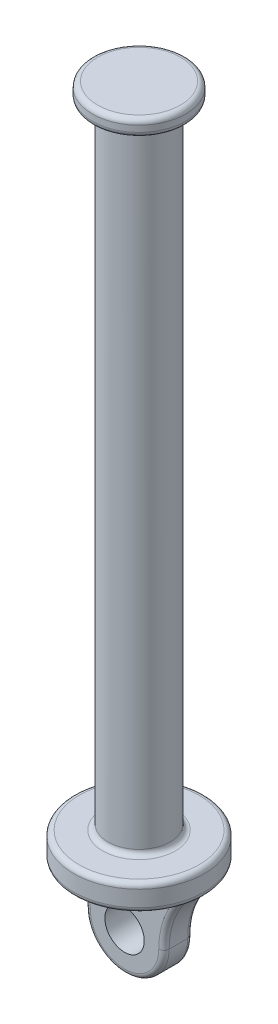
ISO-10303-21;
HEADER;
FILE_DESCRIPTION(('STEP AP214'),'2;1');
FILE_NAME('part.step','',(''),(''),'','','');
FILE_SCHEMA(('AUTOMOTIVE_DESIGN { 1 0 10303 214 1 1 1 1 }'));
ENDSEC;
DATA;
#1=APPLICATION_CONTEXT('core data for automotive mechanical design processes');
#2=APPLICATION_PROTOCOL_DEFINITION('international standard','automotive_design',2000,#1);
#3=PRODUCT_CONTEXT('',#1,'mechanical');
#4=PRODUCT('Part','Part','',(#3));
#5=PRODUCT_RELATED_PRODUCT_CATEGORY('part','',(#4));
#6=PRODUCT_DEFINITION_FORMATION('','',#4);
#7=PRODUCT_DEFINITION_CONTEXT('part definition',#1,'design');
#8=PRODUCT_DEFINITION('design','',#6,#7);
#9=PRODUCT_DEFINITION_SHAPE('','',#8);
#10=(LENGTH_UNIT() NAMED_UNIT(*) SI_UNIT(.MILLI.,.METRE.));
#11=(NAMED_UNIT(*) PLANE_ANGLE_UNIT() SI_UNIT($,.RADIAN.));
#12=(NAMED_UNIT(*) SI_UNIT($,.STERADIAN.) SOLID_ANGLE_UNIT());
#13=UNCERTAINTY_MEASURE_WITH_UNIT(LENGTH_MEASURE(1.E-05),#10,'distance_accuracy_value','');
#14=(GEOMETRIC_REPRESENTATION_CONTEXT(3) GLOBAL_UNCERTAINTY_ASSIGNED_CONTEXT((#13)) GLOBAL_UNIT_ASSIGNED_CONTEXT((#10,
#11,#12)) REPRESENTATION_CONTEXT('',''));
#15=CARTESIAN_POINT('',(0.,0.,0.));
#16=DIRECTION('',(0.,0.,1.));
#17=DIRECTION('',(1.,0.,0.));
#18=AXIS2_PLACEMENT_3D('',#15,#16,#17);
#19=CARTESIAN_POINT('',(0.,-12.7,0.));
#20=DIRECTION('',(0.,-1.,0.));
#21=DIRECTION('',(0.,0.,-1.));
#22=AXIS2_PLACEMENT_3D('',#19,#20,#21);
#23=PLANE('',#22);
#24=DIRECTION('',(-1.,0.,0.));
#25=VECTOR('',#24,1.);
#26=CARTESIAN_POINT('',(-25.2430479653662,-12.7,-9.485));
#27=LINE('',#26,#25);
#28=CARTESIAN_POINT('',(23.4152874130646,-12.7,-9.485));
#29=VERTEX_POINT('',#28);
#30=CARTESIAN_POINT('',(-23.4152874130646,-12.7,-9.485));
#31=VERTEX_POINT('',#30);
#32=EDGE_CURVE('E415',#29,#31,#27,.T.);
#33=ORIENTED_EDGE('',*,*,#32,.T.);
#34=CARTESIAN_POINT('',(-27.0357420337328,-13.8690980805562,-5.79265562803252));
#35=CARTESIAN_POINT('',(-27.6138192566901,-12.7,-6.24695109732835));
#36=CARTESIAN_POINT('',(-28.6996942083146,-12.7,-7.10031125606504));
#37=CARTESIAN_POINT('',(-26.9653396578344,-13.8958241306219,-5.85502737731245));
#38=CARTESIAN_POINT('',(-27.5259260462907,-12.7,-6.32533540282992));
#39=CARTESIAN_POINT('',(-28.6016456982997,-12.7,-7.22505475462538));
#40=CARTESIAN_POINT('',(-26.8910253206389,-13.9239972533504,-5.91505335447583));
#41=CARTESIAN_POINT('',(-27.4335392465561,-12.7,-6.3989376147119));
#42=CARTESIAN_POINT('',(-28.4978597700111,-12.7,-7.34510670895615));
#43=CARTESIAN_POINT('',(-26.7357505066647,-13.9827605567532,-6.03027475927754));
#44=CARTESIAN_POINT('',(-27.24104548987,-12.7,-6.53691870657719));
#45=CARTESIAN_POINT('',(-28.2802913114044,-12.7,-7.57554951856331));
#46=CARTESIAN_POINT('',(-26.6547974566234,-14.0133480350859,-6.08547544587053));
#47=CARTESIAN_POINT('',(-27.1408123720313,-12.7,-6.60128789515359));
#48=CARTESIAN_POINT('',(-28.1665199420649,-12.7,-7.68595089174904));
#49=CARTESIAN_POINT('',(-26.4044870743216,-14.1077379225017,-6.24320531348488));
#50=CARTESIAN_POINT('',(-26.8306223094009,-12.7,-6.78041806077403));
#51=CARTESIAN_POINT('',(-27.8134932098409,-12.7,-8.00141062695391));
#52=CARTESIAN_POINT('',(-26.2268197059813,-14.1744945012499,-6.33860125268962));
#53=CARTESIAN_POINT('',(-26.6120051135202,-12.7,-6.88034144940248));
#54=CARTESIAN_POINT('',(-27.5613329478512,-12.7,-8.192202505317));
#55=CARTESIAN_POINT('',(-25.853756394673,-14.3139713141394,-6.51124886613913));
#56=CARTESIAN_POINT('',(-26.1577805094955,-12.7,-7.04421900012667));
#57=CARTESIAN_POINT('',(-27.0277897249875,-12.7,-8.53749773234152));
#58=CARTESIAN_POINT('',(-25.6581172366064,-14.3867714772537,-6.58817686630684));
#59=CARTESIAN_POINT('',(-25.9212676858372,-12.7,-7.1069062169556));
#60=CARTESIAN_POINT('',(-26.7459948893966,-12.7,-8.69135373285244));
#61=CARTESIAN_POINT('',(-25.2568445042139,-14.5352046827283,-6.72204103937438));
#62=CARTESIAN_POINT('',(-25.4432780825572,-12.7,-7.19457884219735));
#63=CARTESIAN_POINT('',(-26.1634477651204,-12.7,-8.95908207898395));
#64=CARTESIAN_POINT('',(-25.051191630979,-14.6108431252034,-6.77893671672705));
#65=CARTESIAN_POINT('',(-25.2013003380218,-12.7,-7.21866891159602));
#66=CARTESIAN_POINT('',(-25.8626585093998,-12.7,-9.07287343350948));
#67=CARTESIAN_POINT('',(-24.6079390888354,-14.7727657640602,-6.87840998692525));
#68=CARTESIAN_POINT('',(-24.6895874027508,-12.7,-7.23072449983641));
#69=CARTESIAN_POINT('',(-25.2092776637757,-12.7,-9.27181997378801));
#70=CARTESIAN_POINT('',(-24.3696247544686,-14.859171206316,-6.91821557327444));
#71=CARTESIAN_POINT('',(-24.4209219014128,-12.7,-7.21234819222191));
#72=CARTESIAN_POINT('',(-24.8549897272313,-12.7,-9.3514311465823));
#73=CARTESIAN_POINT('',(-23.8920605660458,-15.0308484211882,-6.97150740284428));
#74=CARTESIAN_POINT('',(-23.900432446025,-12.7,-7.13146336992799));
#75=CARTESIAN_POINT('',(-24.1389836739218,-12.7,-9.45801480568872));
#76=CARTESIAN_POINT('',(-23.6528114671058,-15.1161209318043,-6.98501170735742));
#77=CARTESIAN_POINT('',(-23.6488384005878,-12.7,-7.0675209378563));
#78=CARTESIAN_POINT('',(-23.7772708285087,-12.7,-9.48502341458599));
#79=CARTESIAN_POINT('',(-23.1362792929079,-15.2985287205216,-6.98498624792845));
#80=CARTESIAN_POINT('',(-23.1307361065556,-12.7,-6.88445903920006));
#81=CARTESIAN_POINT('',(-22.9900828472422,-12.7,-9.48497249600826));
#82=CARTESIAN_POINT('',(-22.8596514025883,-15.395134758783,-6.96632300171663));
#83=CARTESIAN_POINT('',(-22.8723355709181,-12.7,-6.75610869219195));
#84=CARTESIAN_POINT('',(-22.5645049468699,-12.7,-9.44764600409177));
#85=CARTESIAN_POINT('',(-22.4547183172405,-15.5349691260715,-6.90928530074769));
#86=CARTESIAN_POINT('',(-22.5316223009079,-12.7,-6.53421245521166));
#87=CARTESIAN_POINT('',(-21.9362754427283,-12.7,-9.33357060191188));
#88=CARTESIAN_POINT('',(-22.3210975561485,-15.5808396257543,-6.88533880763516));
#89=CARTESIAN_POINT('',(-22.4243749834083,-12.7,-6.45363126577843));
#90=CARTESIAN_POINT('',(-21.7280635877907,-12.7,-9.2856776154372));
#91=CARTESIAN_POINT('',(-22.058396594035,-15.6705123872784,-6.82752256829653));
#92=CARTESIAN_POINT('',(-22.2268066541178,-12.7,-6.28410633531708));
#93=CARTESIAN_POINT('',(-21.3170896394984,-12.7,-9.17004513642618));
#94=CARTESIAN_POINT('',(-21.9293194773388,-15.714313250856,-6.79364622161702));
#95=CARTESIAN_POINT('',(-22.1369059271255,-12.7,-6.19500173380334));
#96=CARTESIAN_POINT('',(-21.1143312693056,-12.7,-9.10229244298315));
#97=CARTESIAN_POINT('',(-21.8030794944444,-15.7569065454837,-6.75473133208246));
#98=CARTESIAN_POINT('',(-22.0575279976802,-12.7,-6.10420768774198));
#99=CARTESIAN_POINT('',(-20.9152874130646,-12.7,-9.02446266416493));
#100=(BOUNDED_SURFACE() B_SPLINE_SURFACE(3,2,((#34,#35,#36),(#37,#38,#39),(#40,#41,#42),(#43,
#44,#45),(#46,#47,#48),(#49,#50,#51),(#52,#53,#54),(#55,#56,#57),(#58,#59,#60),(#61,#62,#63),
(#64,#65,#66),(#67,#68,#69),(#70,#71,#72),(#73,#74,#75),(#76,#77,#78),(#79,#80,#81),(#82,#83,
#84),(#85,#86,#87),(#88,#89,#90),(#91,#92,#93),(#94,#95,#96),(#97,#98,#99)),.UNSPECIFIED.,.F.,
.F.,.F.) B_SPLINE_SURFACE_WITH_KNOTS((4,2,2,2,2,2,2,2,2,2,4),(3,3),(0.,0.475583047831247,
0.95064113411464,1.89513334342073,2.85513522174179,3.81706675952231,4.90236230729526,
5.9869123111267,7.26088121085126,7.90097186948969,8.54148897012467),(0.,1.),
.UNSPECIFIED.) GEOMETRIC_REPRESENTATION_ITEM() RATIONAL_B_SPLINE_SURFACE(((1.,0.87531730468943,
1.),(1.,0.872264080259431,1.),(1.,0.869029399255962,1.),(1.,0.862240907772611,1.),(1.,
0.858687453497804,1.),(1.,0.847647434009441,1.),(1.,0.839744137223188,1.),(1.,0.822968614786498,
1.),(1.,0.814082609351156,1.),(1.,0.795640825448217,1.),(1.,0.786083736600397,1.),(1.,
0.765224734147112,1.),(1.,0.753856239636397,1.),(1.,0.730728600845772,1.),(1.,0.718969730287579,
1.),(1.,0.693171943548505,1.),(1.,0.679093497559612,1.),(1.,0.658069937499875,1.),(1.,
0.651060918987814,1.),(1.,0.637139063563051,1.),(1.,0.630226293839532,1.),(1.,0.623392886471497,1.))) REPRESENTATION_ITEM('') SURFACE());
#101=CARTESIAN_POINT('',(-20.9152874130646,-12.7,-9.02446266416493));
#102=CARTESIAN_POINT('',(-21.1143312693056,-12.7,-9.10229244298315));
#103=CARTESIAN_POINT('',(-21.3170896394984,-12.7,-9.17004513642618));
#104=CARTESIAN_POINT('',(-21.7280635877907,-12.7,-9.2856776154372));
#105=CARTESIAN_POINT('',(-21.9362754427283,-12.7,-9.33357060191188));
#106=CARTESIAN_POINT('',(-22.5645049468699,-12.7,-9.44764600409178));
#107=CARTESIAN_POINT('',(-22.9900828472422,-12.7,-9.48497249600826));
#108=CARTESIAN_POINT('',(-23.7772708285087,-12.7,-9.48502341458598));
#109=CARTESIAN_POINT('',(-24.1389836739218,-12.7,-9.45801480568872));
#110=CARTESIAN_POINT('',(-24.8549897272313,-12.7,-9.3514311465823));
#111=CARTESIAN_POINT('',(-25.2092776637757,-12.7,-9.27181997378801));
#112=CARTESIAN_POINT('',(-25.8626585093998,-12.7,-9.07287343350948));
#113=CARTESIAN_POINT('',(-26.1634477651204,-12.7,-8.95908207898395));
#114=CARTESIAN_POINT('',(-26.7459948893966,-12.7,-8.69135373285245));
#115=CARTESIAN_POINT('',(-27.0277897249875,-12.7,-8.53749773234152));
#116=CARTESIAN_POINT('',(-27.5613329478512,-12.7,-8.192202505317));
#117=CARTESIAN_POINT('',(-27.8134932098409,-12.7,-8.00141062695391));
#118=CARTESIAN_POINT('',(-28.1665199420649,-12.7,-7.68595089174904));
#119=CARTESIAN_POINT('',(-28.2802913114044,-12.7,-7.57554951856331));
#120=CARTESIAN_POINT('',(-28.4978597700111,-12.7,-7.34510670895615));
#121=CARTESIAN_POINT('',(-28.6016456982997,-12.7,-7.22505475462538));
#122=CARTESIAN_POINT('',(-28.6996942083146,-12.7,-7.10031125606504));
#123=B_SPLINE_CURVE_WITH_KNOTS('',3,(#101,#102,#103,#104,#105,#106,#107,#108,#109,#110,#111,
#112,#113,#114,#115,#116,#117,#118,#119,#120,#121,#122),.UNSPECIFIED.,.F.,.F.,(4,2,2,2,2,2,2,2,
2,2,4),(0.,0.640517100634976,1.28060775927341,2.55457665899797,3.6391266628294,4.72442221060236,
5.68635374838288,6.64635562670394,7.59084783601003,8.06590592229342,8.54148897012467),.UNSPECIFIED.);
#124=CARTESIAN_POINT('',(-27.8969134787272,-12.7,-7.92226093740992));
#125=VERTEX_POINT('',#124);
#126=EDGE_CURVE('E419',#31,#125,#123,.T.);
#127=ORIENTED_EDGE('',*,*,#126,.T.);
#128=CARTESIAN_POINT('',(0.,-12.7,0.));
#129=DIRECTION('',(0.,-1.,0.));
#130=DIRECTION('',(0.,0.,-1.));
#131=AXIS2_PLACEMENT_3D('',#128,#129,#130);
#132=CIRCLE('',#131,29.);
#133=CARTESIAN_POINT('',(27.8969134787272,-12.7,-7.92226093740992));
#134=VERTEX_POINT('',#133);
#135=EDGE_CURVE('E540',#125,#134,#132,.T.);
#136=ORIENTED_EDGE('',*,*,#135,.T.);
#137=CARTESIAN_POINT('',(21.8030794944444,-15.7569065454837,-6.75473133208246));
#138=CARTESIAN_POINT('',(22.0575279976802,-12.7,-6.10420768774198));
#139=CARTESIAN_POINT('',(20.9152874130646,-12.7,-9.02446266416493));
#140=CARTESIAN_POINT('',(21.929310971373,-15.7143163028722,-6.79364543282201));
#141=CARTESIAN_POINT('',(22.1368950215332,-12.7,-6.19499858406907));
#142=CARTESIAN_POINT('',(21.114318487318,-12.7,-9.10229086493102));
#143=CARTESIAN_POINT('',(22.0583879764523,-15.6705153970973,-6.82752109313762));
#144=CARTESIAN_POINT('',(22.2267981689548,-12.7,-6.28410184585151));
#145=CARTESIAN_POINT('',(21.3170764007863,-12.7,-9.17004218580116));
#146=CARTESIAN_POINT('',(22.321069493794,-15.580849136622,-6.88533221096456));
#147=CARTESIAN_POINT('',(22.424356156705,-12.7,-6.45361238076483));
#148=CARTESIAN_POINT('',(21.7280194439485,-12.7,-9.28566442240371));
#149=CARTESIAN_POINT('',(22.454670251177,-15.5349854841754,-6.90927570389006));
#150=CARTESIAN_POINT('',(22.5315879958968,-12.7,-6.53418143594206));
#151=CARTESIAN_POINT('',(21.9362000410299,-12.7,-9.33355140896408));
#152=CARTESIAN_POINT('',(22.8595872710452,-15.3951573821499,-6.96631958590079));
#153=CARTESIAN_POINT('',(22.8722689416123,-12.7,-6.75608198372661));
#154=CARTESIAN_POINT('',(22.5644070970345,-12.7,-9.44763917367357));
#155=CARTESIAN_POINT('',(23.1361961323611,-15.2985590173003,-6.98498703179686));
#156=CARTESIAN_POINT('',(23.1306292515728,-12.7,-6.88444163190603));
#157=CARTESIAN_POINT('',(22.989959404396,-12.7,-9.48497406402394));
#158=CARTESIAN_POINT('',(23.6940003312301,-15.1015745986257,-6.98501295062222));
#159=CARTESIAN_POINT('',(23.6885760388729,-12.7,-7.08154196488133));
#160=CARTESIAN_POINT('',(23.8400388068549,-12.7,-9.4850259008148));
#161=CARTESIAN_POINT('',(23.9751889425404,-15.0011938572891,-6.96642196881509));
#162=CARTESIAN_POINT('',(23.9867289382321,-12.7,-7.15268160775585));
#163=CARTESIAN_POINT('',(24.2645665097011,-12.7,-9.44784393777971));
#164=CARTESIAN_POINT('',(24.5354589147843,-14.7991963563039,-6.89312238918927));
#165=CARTESIAN_POINT('',(24.6044437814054,-12.7,-7.2290606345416));
#166=CARTESIAN_POINT('',(25.1021328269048,-12.7,-9.3012447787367));
#167=CARTESIAN_POINT('',(24.8145337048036,-14.6975772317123,-6.83832832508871));
#168=CARTESIAN_POINT('',(24.9238377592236,-12.7,-7.23651547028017));
#169=CARTESIAN_POINT('',(25.5151418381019,-12.7,-9.19165665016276));
#170=CARTESIAN_POINT('',(25.3535880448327,-14.4996438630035,-6.69502955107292));
#171=CARTESIAN_POINT('',(25.5545593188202,-12.7,-7.18258340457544));
#172=CARTESIAN_POINT('',(26.3049809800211,-12.7,-8.90505910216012));
#173=CARTESIAN_POINT('',(25.6138759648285,-14.4032603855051,-6.60744276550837));
#174=CARTESIAN_POINT('',(25.8663295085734,-12.7,-7.12499261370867));
#175=CARTESIAN_POINT('',(26.682474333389,-12.7,-8.72988553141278));
#176=CARTESIAN_POINT('',(26.1112554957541,-14.2178861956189,-6.39892363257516));
#177=CARTESIAN_POINT('',(26.4684059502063,-12.7,-6.943052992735));
#178=CARTESIAN_POINT('',(27.3971056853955,-12.7,-8.31284726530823));
#179=CARTESIAN_POINT('',(26.3484536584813,-14.1288618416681,-6.27815535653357));
#180=CARTESIAN_POINT('',(26.7602235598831,-12.7,-6.82053487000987));
#181=CARTESIAN_POINT('',(27.734430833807,-12.7,-8.07131071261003));
#182=CARTESIAN_POINT('',(26.7135865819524,-13.9911829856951,-6.04866542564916));
#183=CARTESIAN_POINT('',(27.2124150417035,-12.7,-6.56028399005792));
#184=CARTESIAN_POINT('',(28.249456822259,-12.7,-7.61233085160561));
#185=CARTESIAN_POINT('',(26.8518482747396,-13.9388619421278,-5.94897467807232));
#186=CARTESIAN_POINT('',(27.3842214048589,-12.7,-6.44165238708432));
#187=CARTESIAN_POINT('',(28.4432333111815,-12.7,-7.4129493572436));
#188=CARTESIAN_POINT('',(27.1057539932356,-13.8425492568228,-5.7347927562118));
#189=CARTESIAN_POINT('',(27.6998067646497,-12.7,-6.17654171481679));
#190=CARTESIAN_POINT('',(28.7974254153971,-12.7,-6.98458551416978));
#191=CARTESIAN_POINT('',(27.2212546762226,-13.7986104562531,-5.62021488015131));
#192=CARTESIAN_POINT('',(27.8441813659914,-12.7,-6.02989704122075));
#193=CARTESIAN_POINT('',(28.9576299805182,-12.7,-6.75542976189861));
#194=CARTESIAN_POINT('',(27.3216731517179,-13.760349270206,-5.49885163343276));
#195=CARTESIAN_POINT('',(27.9701895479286,-12.7,-5.86933936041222));
#196=CARTESIAN_POINT('',(29.0963592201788,-12.7,-6.51270326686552));
#197=(BOUNDED_SURFACE() B_SPLINE_SURFACE(3,2,((#137,#138,#139),(#140,#141,#142),(#143,#144,
#145),(#146,#147,#148),(#149,#150,#151),(#152,#153,#154),(#155,#156,#157),(#158,#159,#160),
(#161,#162,#163),(#164,#165,#166),(#167,#168,#169),(#170,#171,#172),(#173,#174,#175),(#176,#177,
#178),(#179,#180,#181),(#182,#183,#184),(#185,#186,#187),(#188,#189,#190),(#191,#192,#193),
(#194,#195,#196)),.UNSPECIFIED.,.F.,.F.,.F.) B_SPLINE_SURFACE_WITH_KNOTS((4,2,2,2,2,2,2,2,2,4),
(3,3),(0.,0.640502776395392,1.2804863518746,2.55457629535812,3.82693896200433,5.10231613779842,
6.34437980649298,7.58040911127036,8.41121470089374,9.24709607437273),(0.,1.),
.UNSPECIFIED.) GEOMETRIC_REPRESENTATION_ITEM() RATIONAL_B_SPLINE_SURFACE(((1.,0.623392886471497,
1.),(1.,0.630225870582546,1.),(1.,0.637138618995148,1.),(1.,0.65105941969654,1.),(1.,
0.658067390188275,1.),(1.,0.679090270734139,1.),(1.,0.693167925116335,1.),(1.,0.721026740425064,
1.),(1.,0.734808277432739,1.),(1.,0.761802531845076,1.),(1.,0.775013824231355,1.),(1.,
0.800140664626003,1.),(1.,0.812081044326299,1.),(1.,0.834594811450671,1.),(1.,0.845174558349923,
1.),(1.,0.861281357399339,1.),(1.,0.867327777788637,1.),(1.,0.878362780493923,1.),(1.,
0.883344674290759,1.),(1.,0.887654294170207,1.))) REPRESENTATION_ITEM('') SURFACE());
#198=CARTESIAN_POINT('',(29.0963592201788,-12.7,-6.51270326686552));
#199=CARTESIAN_POINT('',(28.9576299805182,-12.7,-6.75542976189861));
#200=CARTESIAN_POINT('',(28.7974254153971,-12.7,-6.98458551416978));
#201=CARTESIAN_POINT('',(28.4432333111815,-12.7,-7.41294935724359));
#202=CARTESIAN_POINT('',(28.249456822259,-12.7,-7.61233085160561));
#203=CARTESIAN_POINT('',(27.734430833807,-12.7,-8.07131071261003));
#204=CARTESIAN_POINT('',(27.3971056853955,-12.7,-8.31284726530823));
#205=CARTESIAN_POINT('',(26.682474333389,-12.7,-8.72988553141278));
#206=CARTESIAN_POINT('',(26.3049809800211,-12.7,-8.90505910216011));
#207=CARTESIAN_POINT('',(25.5151418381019,-12.7,-9.19165665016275));
#208=CARTESIAN_POINT('',(25.1021328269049,-12.7,-9.3012447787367));
#209=CARTESIAN_POINT('',(24.2645665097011,-12.7,-9.44784393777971));
#210=CARTESIAN_POINT('',(23.8400388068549,-12.7,-9.4850259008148));
#211=CARTESIAN_POINT('',(22.989959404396,-12.7,-9.48497406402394));
#212=CARTESIAN_POINT('',(22.5644070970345,-12.7,-9.44763917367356));
#213=CARTESIAN_POINT('',(21.9362000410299,-12.7,-9.33355140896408));
#214=CARTESIAN_POINT('',(21.7280194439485,-12.7,-9.28566442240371));
#215=CARTESIAN_POINT('',(21.3170764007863,-12.7,-9.17004218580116));
#216=CARTESIAN_POINT('',(21.114318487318,-12.7,-9.10229086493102));
#217=CARTESIAN_POINT('',(20.9152874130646,-12.7,-9.02446266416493));
#218=B_SPLINE_CURVE_WITH_KNOTS('',3,(#198,#199,#200,#201,#202,#203,#204,#205,#206,#207,#208,
#209,#210,#211,#212,#213,#214,#215,#216,#217),.UNSPECIFIED.,.F.,.F.,(4,2,2,2,2,2,2,2,2,4),(0.,
0.835881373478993,1.66668696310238,2.90271626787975,4.14477993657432,5.4201571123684,
6.69251977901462,7.96660972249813,8.60659329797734,9.24709607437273),.UNSPECIFIED.);
#219=EDGE_CURVE('E422',#134,#29,#218,.T.);
#220=ORIENTED_EDGE('',*,*,#219,.T.);
#221=EDGE_LOOP('',(#33,#127,#136,#220));
#222=FACE_BOUND('',#221,.T.);
#223=ADVANCED_FACE('F43',(#222),#23,.T.);
#224=CARTESIAN_POINT('',(27.8969134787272,-12.7,7.92226093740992));
#225=VERTEX_POINT('',#224);
#226=CARTESIAN_POINT('',(-27.8969134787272,-12.7,7.92226093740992));
#227=VERTEX_POINT('',#226);
#228=EDGE_CURVE('E198',#225,#227,#132,.T.);
#229=ORIENTED_EDGE('',*,*,#228,.T.);
#230=CARTESIAN_POINT('',(-21.8030794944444,-15.7569065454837,6.75473133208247));
#231=CARTESIAN_POINT('',(-22.0575279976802,-12.7,6.10420768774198));
#232=CARTESIAN_POINT('',(-20.9152874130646,-12.7,9.02446266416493));
#233=CARTESIAN_POINT('',(-21.929310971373,-15.7143163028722,6.79364543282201));
#234=CARTESIAN_POINT('',(-22.1368950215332,-12.7,6.19499858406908));
#235=CARTESIAN_POINT('',(-21.114318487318,-12.7,9.10229086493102));
#236=CARTESIAN_POINT('',(-22.0583879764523,-15.6705153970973,6.82752109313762));
#237=CARTESIAN_POINT('',(-22.2267981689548,-12.7,6.28410184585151));
#238=CARTESIAN_POINT('',(-21.3170764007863,-12.7,9.17004218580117));
#239=CARTESIAN_POINT('',(-22.321069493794,-15.580849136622,6.88533221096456));
#240=CARTESIAN_POINT('',(-22.424356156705,-12.7,6.45361238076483));
#241=CARTESIAN_POINT('',(-21.7280194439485,-12.7,9.28566442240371));
#242=CARTESIAN_POINT('',(-22.454670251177,-15.5349854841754,6.90927570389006));
#243=CARTESIAN_POINT('',(-22.5315879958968,-12.7,6.53418143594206));
#244=CARTESIAN_POINT('',(-21.9362000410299,-12.7,9.33355140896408));
#245=CARTESIAN_POINT('',(-22.8595872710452,-15.3951573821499,6.9663195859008));
#246=CARTESIAN_POINT('',(-22.8722689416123,-12.7,6.75608198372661));
#247=CARTESIAN_POINT('',(-22.5644070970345,-12.7,9.44763917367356));
#248=CARTESIAN_POINT('',(-23.1361961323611,-15.2985590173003,6.98498703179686));
#249=CARTESIAN_POINT('',(-23.1306292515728,-12.7,6.88444163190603));
#250=CARTESIAN_POINT('',(-22.989959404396,-12.7,9.48497406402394));
#251=CARTESIAN_POINT('',(-23.6940003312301,-15.1015745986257,6.98501295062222));
#252=CARTESIAN_POINT('',(-23.6885760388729,-12.7,7.08154196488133));
#253=CARTESIAN_POINT('',(-23.8400388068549,-12.7,9.4850259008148));
#254=CARTESIAN_POINT('',(-23.9751889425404,-15.0011938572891,6.96642196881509));
#255=CARTESIAN_POINT('',(-23.9867289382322,-12.7,7.15268160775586));
#256=CARTESIAN_POINT('',(-24.2645665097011,-12.7,9.44784393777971));
#257=CARTESIAN_POINT('',(-24.5354589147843,-14.7991963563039,6.89312238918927));
#258=CARTESIAN_POINT('',(-24.6044437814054,-12.7,7.2290606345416));
#259=CARTESIAN_POINT('',(-25.1021328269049,-12.7,9.3012447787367));
#260=CARTESIAN_POINT('',(-24.8145337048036,-14.6975772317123,6.83832832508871));
#261=CARTESIAN_POINT('',(-24.9238377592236,-12.7,7.23651547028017));
#262=CARTESIAN_POINT('',(-25.5151418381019,-12.7,9.19165665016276));
#263=CARTESIAN_POINT('',(-25.3535880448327,-14.4996438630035,6.69502955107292));
#264=CARTESIAN_POINT('',(-25.5545593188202,-12.7,7.18258340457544));
#265=CARTESIAN_POINT('',(-26.3049809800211,-12.7,8.90505910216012));
#266=CARTESIAN_POINT('',(-25.6138759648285,-14.403260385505,6.60744276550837));
#267=CARTESIAN_POINT('',(-25.8663295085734,-12.7,7.12499261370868));
#268=CARTESIAN_POINT('',(-26.682474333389,-12.7,8.72988553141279));
#269=CARTESIAN_POINT('',(-26.1112554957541,-14.2178861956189,6.39892363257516));
#270=CARTESIAN_POINT('',(-26.4684059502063,-12.7,6.94305299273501));
#271=CARTESIAN_POINT('',(-27.3971056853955,-12.7,8.31284726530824));
#272=CARTESIAN_POINT('',(-26.3484536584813,-14.1288618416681,6.27815535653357));
#273=CARTESIAN_POINT('',(-26.7602235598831,-12.7,6.82053487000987));
#274=CARTESIAN_POINT('',(-27.734430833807,-12.7,8.07131071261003));
#275=CARTESIAN_POINT('',(-26.7135865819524,-13.9911829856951,6.04866542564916));
#276=CARTESIAN_POINT('',(-27.2124150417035,-12.7,6.56028399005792));
#277=CARTESIAN_POINT('',(-28.249456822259,-12.7,7.61233085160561));
#278=CARTESIAN_POINT('',(-26.8518482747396,-13.9388619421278,5.94897467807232));
#279=CARTESIAN_POINT('',(-27.3842214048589,-12.7,6.44165238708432));
#280=CARTESIAN_POINT('',(-28.4432333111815,-12.7,7.4129493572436));
#281=CARTESIAN_POINT('',(-27.1057539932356,-13.8425492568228,5.73479275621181));
#282=CARTESIAN_POINT('',(-27.6998067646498,-12.7,6.1765417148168));
#283=CARTESIAN_POINT('',(-28.7974254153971,-12.7,6.98458551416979));
#284=CARTESIAN_POINT('',(-27.2212546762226,-13.7986104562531,5.62021488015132));
#285=CARTESIAN_POINT('',(-27.8441813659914,-12.7,6.02989704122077));
#286=CARTESIAN_POINT('',(-28.9576299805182,-12.7,6.75542976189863));
#287=CARTESIAN_POINT('',(-27.3216731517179,-13.760349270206,5.49885163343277));
#288=CARTESIAN_POINT('',(-27.9701895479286,-12.7,5.86933936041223));
#289=CARTESIAN_POINT('',(-29.0963592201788,-12.7,6.51270326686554));
#290=(BOUNDED_SURFACE() B_SPLINE_SURFACE(3,2,((#230,#231,#232),(#233,#234,#235),(#236,#237,
#238),(#239,#240,#241),(#242,#243,#244),(#245,#246,#247),(#248,#249,#250),(#251,#252,#253),
(#254,#255,#256),(#257,#258,#259),(#260,#261,#262),(#263,#264,#265),(#266,#267,#268),(#269,#270,
#271),(#272,#273,#274),(#275,#276,#277),(#278,#279,#280),(#281,#282,#283),(#284,#285,#286),
(#287,#288,#289)),.UNSPECIFIED.,.F.,.F.,.F.) B_SPLINE_SURFACE_WITH_KNOTS((4,2,2,2,2,2,2,2,2,4),
(3,3),(0.,0.640502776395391,1.2804863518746,2.55457629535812,3.82693896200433,5.10231613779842,
6.34437980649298,7.58040911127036,8.41121470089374,9.24709607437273),(0.,1.),
.UNSPECIFIED.) GEOMETRIC_REPRESENTATION_ITEM() RATIONAL_B_SPLINE_SURFACE(((1.,0.623392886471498,
1.),(1.,0.630225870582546,1.),(1.,0.637138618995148,1.),(1.,0.65105941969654,1.),(1.,
0.658067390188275,1.),(1.,0.679090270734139,1.),(1.,0.693167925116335,1.),(1.,0.721026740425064,
1.),(1.,0.734808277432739,1.),(1.,0.761802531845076,1.),(1.,0.775013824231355,1.),(1.,
0.800140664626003,1.),(1.,0.812081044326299,1.),(1.,0.834594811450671,1.),(1.,0.845174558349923,
1.),(1.,0.861281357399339,1.),(1.,0.867327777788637,1.),(1.,0.878362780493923,1.),(1.,
0.883344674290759,1.),(1.,0.887654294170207,1.))) REPRESENTATION_ITEM('') SURFACE());
#291=CARTESIAN_POINT('',(-29.0963592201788,-12.7,6.51270326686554));
#292=CARTESIAN_POINT('',(-28.9576299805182,-12.7,6.75542976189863));
#293=CARTESIAN_POINT('',(-28.7974254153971,-12.7,6.98458551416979));
#294=CARTESIAN_POINT('',(-28.4432333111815,-12.7,7.4129493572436));
#295=CARTESIAN_POINT('',(-28.249456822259,-12.7,7.61233085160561));
#296=CARTESIAN_POINT('',(-27.734430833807,-12.7,8.07131071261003));
#297=CARTESIAN_POINT('',(-27.3971056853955,-12.7,8.31284726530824));
#298=CARTESIAN_POINT('',(-26.682474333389,-12.7,8.72988553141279));
#299=CARTESIAN_POINT('',(-26.3049809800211,-12.7,8.90505910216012));
#300=CARTESIAN_POINT('',(-25.5151418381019,-12.7,9.19165665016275));
#301=CARTESIAN_POINT('',(-25.1021328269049,-12.7,9.3012447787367));
#302=CARTESIAN_POINT('',(-24.2645665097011,-12.7,9.44784393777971));
#303=CARTESIAN_POINT('',(-23.8400388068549,-12.7,9.4850259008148));
#304=CARTESIAN_POINT('',(-22.989959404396,-12.7,9.48497406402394));
#305=CARTESIAN_POINT('',(-22.5644070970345,-12.7,9.44763917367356));
#306=CARTESIAN_POINT('',(-21.9362000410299,-12.7,9.33355140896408));
#307=CARTESIAN_POINT('',(-21.7280194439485,-12.7,9.28566442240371));
#308=CARTESIAN_POINT('',(-21.3170764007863,-12.7,9.17004218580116));
#309=CARTESIAN_POINT('',(-21.114318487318,-12.7,9.10229086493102));
#310=CARTESIAN_POINT('',(-20.9152874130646,-12.7,9.02446266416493));
#311=B_SPLINE_CURVE_WITH_KNOTS('',3,(#291,#292,#293,#294,#295,#296,#297,#298,#299,#300,#301,
#302,#303,#304,#305,#306,#307,#308,#309,#310),.UNSPECIFIED.,.F.,.F.,(4,2,2,2,2,2,2,2,2,4),(0.,
0.835881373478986,1.66668696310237,2.90271626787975,4.14477993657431,5.42015711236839,
6.69251977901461,7.96660972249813,8.60659329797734,9.24709607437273),.UNSPECIFIED.);
#312=CARTESIAN_POINT('',(-23.4152874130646,-12.7,9.485));
#313=VERTEX_POINT('',#312);
#314=EDGE_CURVE('E555',#227,#313,#311,.T.);
#315=ORIENTED_EDGE('',*,*,#314,.T.);
#316=DIRECTION('',(-1.,0.,0.));
#317=VECTOR('',#316,1.);
#318=CARTESIAN_POINT('',(0.,-12.7,9.485));
#319=LINE('',#318,#317);
#320=CARTESIAN_POINT('',(23.4152874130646,-12.7,9.485));
#321=VERTEX_POINT('',#320);
#322=EDGE_CURVE('E508',#313,#321,#319,.F.);
#323=ORIENTED_EDGE('',*,*,#322,.T.);
#324=CARTESIAN_POINT('',(27.0357420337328,-13.8690980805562,5.79265562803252));
#325=CARTESIAN_POINT('',(27.6138192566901,-12.7,6.24695109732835));
#326=CARTESIAN_POINT('',(28.6996942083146,-12.7,7.10031125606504));
#327=CARTESIAN_POINT('',(26.9653396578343,-13.8958241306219,5.85502737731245));
#328=CARTESIAN_POINT('',(27.5259260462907,-12.7,6.32533540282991));
#329=CARTESIAN_POINT('',(28.6016456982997,-12.7,7.22505475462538));
#330=CARTESIAN_POINT('',(26.8910253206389,-13.9239972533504,5.91505335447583));
#331=CARTESIAN_POINT('',(27.4335392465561,-12.7,6.3989376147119));
#332=CARTESIAN_POINT('',(28.4978597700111,-12.7,7.34510670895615));
#333=CARTESIAN_POINT('',(26.7357505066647,-13.9827605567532,6.03027475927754));
#334=CARTESIAN_POINT('',(27.24104548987,-12.7,6.53691870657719));
#335=CARTESIAN_POINT('',(28.2802913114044,-12.7,7.57554951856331));
#336=CARTESIAN_POINT('',(26.6547974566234,-14.0133480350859,6.08547544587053));
#337=CARTESIAN_POINT('',(27.1408123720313,-12.7,6.60128789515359));
#338=CARTESIAN_POINT('',(28.1665199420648,-12.7,7.68595089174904));
#339=CARTESIAN_POINT('',(26.4044870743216,-14.1077379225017,6.24320531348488));
#340=CARTESIAN_POINT('',(26.8306223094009,-12.7,6.78041806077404));
#341=CARTESIAN_POINT('',(27.8134932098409,-12.7,8.00141062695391));
#342=CARTESIAN_POINT('',(26.2268197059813,-14.1744945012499,6.33860125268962));
#343=CARTESIAN_POINT('',(26.6120051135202,-12.7,6.88034144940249));
#344=CARTESIAN_POINT('',(27.5613329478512,-12.7,8.192202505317));
#345=CARTESIAN_POINT('',(25.853756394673,-14.3139713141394,6.51124886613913));
#346=CARTESIAN_POINT('',(26.1577805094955,-12.7,7.04421900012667));
#347=CARTESIAN_POINT('',(27.0277897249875,-12.7,8.53749773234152));
#348=CARTESIAN_POINT('',(25.6581172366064,-14.3867714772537,6.58817686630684));
#349=CARTESIAN_POINT('',(25.9212676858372,-12.7,7.1069062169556));
#350=CARTESIAN_POINT('',(26.7459948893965,-12.7,8.69135373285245));
#351=CARTESIAN_POINT('',(25.2568445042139,-14.5352046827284,6.72204103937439));
#352=CARTESIAN_POINT('',(25.4432780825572,-12.7,7.19457884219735));
#353=CARTESIAN_POINT('',(26.1634477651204,-12.7,8.95908207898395));
#354=CARTESIAN_POINT('',(25.051191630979,-14.6108431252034,6.77893671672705));
#355=CARTESIAN_POINT('',(25.2013003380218,-12.7,7.21866891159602));
#356=CARTESIAN_POINT('',(25.8626585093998,-12.7,9.07287343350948));
#357=CARTESIAN_POINT('',(24.6079390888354,-14.7727657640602,6.87840998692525));
#358=CARTESIAN_POINT('',(24.6895874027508,-12.7,7.23072449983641));
#359=CARTESIAN_POINT('',(25.2092776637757,-12.7,9.27181997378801));
#360=CARTESIAN_POINT('',(24.3696247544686,-14.859171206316,6.91821557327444));
#361=CARTESIAN_POINT('',(24.4209219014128,-12.7,7.2123481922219));
#362=CARTESIAN_POINT('',(24.8549897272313,-12.7,9.3514311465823));
#363=CARTESIAN_POINT('',(23.8920605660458,-15.0308484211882,6.97150740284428));
#364=CARTESIAN_POINT('',(23.900432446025,-12.7,7.13146336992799));
#365=CARTESIAN_POINT('',(24.1389836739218,-12.7,9.45801480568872));
#366=CARTESIAN_POINT('',(23.6528114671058,-15.1161209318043,6.98501170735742));
#367=CARTESIAN_POINT('',(23.6488384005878,-12.7,7.06752093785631));
#368=CARTESIAN_POINT('',(23.7772708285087,-12.7,9.48502341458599));
#369=CARTESIAN_POINT('',(23.1362792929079,-15.2985287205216,6.98498624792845));
#370=CARTESIAN_POINT('',(23.1307361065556,-12.7,6.88445903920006));
#371=CARTESIAN_POINT('',(22.9900828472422,-12.7,9.48497249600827));
#372=CARTESIAN_POINT('',(22.8596514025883,-15.395134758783,6.96632300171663));
#373=CARTESIAN_POINT('',(22.8723355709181,-12.7,6.75610869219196));
#374=CARTESIAN_POINT('',(22.5645049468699,-12.7,9.44764600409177));
#375=CARTESIAN_POINT('',(22.4547183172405,-15.5349691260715,6.90928530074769));
#376=CARTESIAN_POINT('',(22.5316223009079,-12.7,6.53421245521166));
#377=CARTESIAN_POINT('',(21.9362754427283,-12.7,9.33357060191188));
#378=CARTESIAN_POINT('',(22.3210975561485,-15.5808396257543,6.88533880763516));
#379=CARTESIAN_POINT('',(22.4243749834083,-12.7,6.45363126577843));
#380=CARTESIAN_POINT('',(21.7280635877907,-12.7,9.2856776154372));
#381=CARTESIAN_POINT('',(22.058396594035,-15.6705123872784,6.82752256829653));
#382=CARTESIAN_POINT('',(22.2268066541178,-12.7,6.28410633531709));
#383=CARTESIAN_POINT('',(21.3170896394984,-12.7,9.17004513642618));
#384=CARTESIAN_POINT('',(21.9293194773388,-15.714313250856,6.79364622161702));
#385=CARTESIAN_POINT('',(22.1369059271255,-12.7,6.19500173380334));
#386=CARTESIAN_POINT('',(21.1143312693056,-12.7,9.10229244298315));
#387=CARTESIAN_POINT('',(21.8030794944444,-15.7569065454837,6.75473133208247));
#388=CARTESIAN_POINT('',(22.0575279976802,-12.7,6.10420768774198));
#389=CARTESIAN_POINT('',(20.9152874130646,-12.7,9.02446266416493));
#390=(BOUNDED_SURFACE() B_SPLINE_SURFACE(3,2,((#324,#325,#326),(#327,#328,#329),(#330,#331,
#332),(#333,#334,#335),(#336,#337,#338),(#339,#340,#341),(#342,#343,#344),(#345,#346,#347),
(#348,#349,#350),(#351,#352,#353),(#354,#355,#356),(#357,#358,#359),(#360,#361,#362),(#363,#364,
#365),(#366,#367,#368),(#369,#370,#371),(#372,#373,#374),(#375,#376,#377),(#378,#379,#380),
(#381,#382,#383),(#384,#385,#386),(#387,#388,#389)),.UNSPECIFIED.,.F.,.F.,
.F.) B_SPLINE_SURFACE_WITH_KNOTS((4,2,2,2,2,2,2,2,2,2,4),(3,3),(0.,0.475583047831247,
0.950641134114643,1.89513334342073,2.8551352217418,3.81706675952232,4.90236230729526,
5.9869123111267,7.26088121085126,7.90097186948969,8.54148897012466),(0.,1.),
.UNSPECIFIED.) GEOMETRIC_REPRESENTATION_ITEM() RATIONAL_B_SPLINE_SURFACE(((1.,0.87531730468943,
1.),(1.,0.872264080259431,1.),(1.,0.869029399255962,1.),(1.,0.862240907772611,1.),(1.,
0.858687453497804,1.),(1.,0.84764743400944,1.),(1.,0.839744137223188,1.),(1.,0.822968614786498,
1.),(1.,0.814082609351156,1.),(1.,0.795640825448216,1.),(1.,0.786083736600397,1.),(1.,
0.765224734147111,1.),(1.,0.753856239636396,1.),(1.,0.730728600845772,1.),(1.,0.718969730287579,
1.),(1.,0.693171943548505,1.),(1.,0.679093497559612,1.),(1.,0.658069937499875,1.),(1.,
0.651060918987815,1.),(1.,0.637139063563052,1.),(1.,0.630226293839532,1.),(1.,0.623392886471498,1.))) REPRESENTATION_ITEM('') SURFACE());
#391=CARTESIAN_POINT('',(20.9152874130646,-12.7,9.02446266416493));
#392=CARTESIAN_POINT('',(21.1143312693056,-12.7,9.10229244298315));
#393=CARTESIAN_POINT('',(21.3170896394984,-12.7,9.17004513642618));
#394=CARTESIAN_POINT('',(21.7280635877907,-12.7,9.2856776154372));
#395=CARTESIAN_POINT('',(21.9362754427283,-12.7,9.33357060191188));
#396=CARTESIAN_POINT('',(22.5645049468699,-12.7,9.44764600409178));
#397=CARTESIAN_POINT('',(22.9900828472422,-12.7,9.48497249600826));
#398=CARTESIAN_POINT('',(23.7772708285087,-12.7,9.48502341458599));
#399=CARTESIAN_POINT('',(24.1389836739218,-12.7,9.45801480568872));
#400=CARTESIAN_POINT('',(24.8549897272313,-12.7,9.3514311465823));
#401=CARTESIAN_POINT('',(25.2092776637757,-12.7,9.27181997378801));
#402=CARTESIAN_POINT('',(25.8626585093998,-12.7,9.07287343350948));
#403=CARTESIAN_POINT('',(26.1634477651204,-12.7,8.95908207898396));
#404=CARTESIAN_POINT('',(26.7459948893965,-12.7,8.69135373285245));
#405=CARTESIAN_POINT('',(27.0277897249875,-12.7,8.53749773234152));
#406=CARTESIAN_POINT('',(27.5613329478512,-12.7,8.192202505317));
#407=CARTESIAN_POINT('',(27.8134932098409,-12.7,8.00141062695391));
#408=CARTESIAN_POINT('',(28.1665199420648,-12.7,7.68595089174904));
#409=CARTESIAN_POINT('',(28.2802913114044,-12.7,7.57554951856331));
#410=CARTESIAN_POINT('',(28.4978597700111,-12.7,7.34510670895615));
#411=CARTESIAN_POINT('',(28.6016456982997,-12.7,7.22505475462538));
#412=CARTESIAN_POINT('',(28.6996942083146,-12.7,7.10031125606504));
#413=B_SPLINE_CURVE_WITH_KNOTS('',3,(#391,#392,#393,#394,#395,#396,#397,#398,#399,#400,#401,
#402,#403,#404,#405,#406,#407,#408,#409,#410,#411,#412),.UNSPECIFIED.,.F.,.F.,(4,2,2,2,2,2,2,2,
2,2,4),(0.,0.640517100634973,1.28060775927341,2.55457665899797,3.6391266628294,4.72442221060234,
5.68635374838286,6.64635562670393,7.59084783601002,8.06590592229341,8.54148897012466),.UNSPECIFIED.);
#414=EDGE_CURVE('E522',#321,#225,#413,.T.);
#415=ORIENTED_EDGE('',*,*,#414,.T.);
#416=EDGE_LOOP('',(#229,#315,#323,#415));
#417=FACE_BOUND('',#416,.T.);
#418=ADVANCED_FACE('F350',(#417),#23,.T.);
#419=CARTESIAN_POINT('',(0.,305.,0.));
#420=DIRECTION('',(0.,-1.,0.));
#421=DIRECTION('',(0.,0.,-1.));
#422=AXIS2_PLACEMENT_3D('',#419,#420,#421);
#423=CYLINDRICAL_SURFACE('',#422,15.);
#424=CARTESIAN_POINT('',(0.,302.5,0.));
#425=DIRECTION('',(0.,1.,0.));
#426=DIRECTION('',(0.,0.,1.));
#427=AXIS2_PLACEMENT_3D('',#424,#425,#426);
#428=CIRCLE('',#427,15.);
#429=CARTESIAN_POINT('',(0.,302.5,15.));
#430=VERTEX_POINT('',#429);
#431=EDGE_CURVE('E751',#430,#430,#428,.F.);
#432=ORIENTED_EDGE('',*,*,#431,.T.);
#433=EDGE_LOOP('',(#432));
#434=FACE_BOUND('',#433,.T.);
#435=CARTESIAN_POINT('',(0.,2.5,0.));
#436=DIRECTION('',(0.,-1.,0.));
#437=DIRECTION('',(0.,0.,-1.));
#438=AXIS2_PLACEMENT_3D('',#435,#436,#437);
#439=CIRCLE('',#438,15.);
#440=CARTESIAN_POINT('',(0.,2.5,-15.));
#441=VERTEX_POINT('',#440);
#442=EDGE_CURVE('E739',#441,#441,#439,.F.);
#443=ORIENTED_EDGE('',*,*,#442,.T.);
#444=EDGE_LOOP('',(#443));
#445=FACE_BOUND('',#444,.T.);
#446=ADVANCED_FACE('F412',(#434,#445),#423,.T.);
#447=CARTESIAN_POINT('',(0.,305.,0.));
#448=DIRECTION('',(0.,1.,0.));
#449=DIRECTION('',(0.,0.,1.));
#450=AXIS2_PLACEMENT_3D('',#447,#448,#449);
#451=PLANE('',#450);
#452=CARTESIAN_POINT('',(0.,305.,0.));
#453=DIRECTION('',(0.,1.,0.));
#454=DIRECTION('',(0.,0.,1.));
#455=AXIS2_PLACEMENT_3D('',#452,#453,#454);
#456=CIRCLE('',#455,17.5);
#457=CARTESIAN_POINT('',(0.,305.,17.5));
#458=VERTEX_POINT('',#457);
#459=EDGE_CURVE('E747',#458,#458,#456,.T.);
#460=ORIENTED_EDGE('',*,*,#459,.T.);
#461=EDGE_LOOP('',(#460));
#462=FACE_BOUND('',#461,.T.);
#463=CARTESIAN_POINT('',(0.,305.,0.));
#464=DIRECTION('',(0.,1.,0.));
#465=DIRECTION('',(0.,0.,1.));
#466=AXIS2_PLACEMENT_3D('',#463,#464,#465);
#467=CIRCLE('',#466,20.);
#468=CARTESIAN_POINT('',(0.,305.,20.));
#469=VERTEX_POINT('',#468);
#470=EDGE_CURVE('E743',#469,#469,#467,.F.);
#471=ORIENTED_EDGE('',*,*,#470,.T.);
#472=EDGE_LOOP('',(#471));
#473=FACE_BOUND('',#472,.T.);
#474=ADVANCED_FACE('F1054',(#462,#473),#451,.F.);
#475=CARTESIAN_POINT('',(0.,313.,0.));
#476=DIRECTION('',(0.,-1.,0.));
#477=DIRECTION('',(0.,0.,-1.));
#478=AXIS2_PLACEMENT_3D('',#475,#476,#477);
#479=CYLINDRICAL_SURFACE('',#478,22.5);
#480=CARTESIAN_POINT('',(0.,307.5,0.));
#481=DIRECTION('',(0.,1.,0.));
#482=DIRECTION('',(0.,0.,1.));
#483=AXIS2_PLACEMENT_3D('',#480,#481,#482);
#484=CIRCLE('',#483,22.5);
#485=CARTESIAN_POINT('',(0.,307.5,22.5));
#486=VERTEX_POINT('',#485);
#487=EDGE_CURVE('E759',#486,#486,#484,.T.);
#488=ORIENTED_EDGE('',*,*,#487,.T.);
#489=EDGE_LOOP('',(#488));
#490=FACE_BOUND('',#489,.T.);
#491=CARTESIAN_POINT('',(0.,310.5,0.));
#492=DIRECTION('',(0.,1.,0.));
#493=DIRECTION('',(0.,0.,1.));
#494=AXIS2_PLACEMENT_3D('',#491,#492,#493);
#495=CIRCLE('',#494,22.5);
#496=CARTESIAN_POINT('',(0.,310.5,22.5));
#497=VERTEX_POINT('',#496);
#498=EDGE_CURVE('E755',#497,#497,#495,.F.);
#499=ORIENTED_EDGE('',*,*,#498,.T.);
#500=EDGE_LOOP('',(#499));
#501=FACE_BOUND('',#500,.T.);
#502=ADVANCED_FACE('F1045',(#490,#501),#479,.T.);
#503=CARTESIAN_POINT('',(0.,313.,0.));
#504=DIRECTION('',(0.,1.,0.));
#505=DIRECTION('',(0.,0.,1.));
#506=AXIS2_PLACEMENT_3D('',#503,#504,#505);
#507=PLANE('',#506);
#508=CARTESIAN_POINT('',(0.,313.,0.));
#509=DIRECTION('',(0.,1.,0.));
#510=DIRECTION('',(0.,0.,1.));
#511=AXIS2_PLACEMENT_3D('',#508,#509,#510);
#512=CIRCLE('',#511,20.);
#513=CARTESIAN_POINT('',(0.,313.,20.));
#514=VERTEX_POINT('',#513);
#515=EDGE_CURVE('E763',#514,#514,#512,.T.);
#516=ORIENTED_EDGE('',*,*,#515,.T.);
#517=EDGE_LOOP('',(#516));
#518=FACE_BOUND('',#517,.T.);
#519=ADVANCED_FACE('F1037',(#518),#507,.T.);
#520=CARTESIAN_POINT('',(0.,0.,0.));
#521=DIRECTION('',(0.,-1.,0.));
#522=DIRECTION('',(0.,0.,-1.));
#523=AXIS2_PLACEMENT_3D('',#520,#521,#522);
#524=PLANE('',#523);
#525=CARTESIAN_POINT('',(0.,0.,0.));
#526=DIRECTION('',(0.,-1.,0.));
#527=DIRECTION('',(0.,0.,-1.));
#528=AXIS2_PLACEMENT_3D('',#525,#526,#527);
#529=CIRCLE('',#528,29.);
#530=CARTESIAN_POINT('',(0.,0.,-29.));
#531=VERTEX_POINT('',#530);
#532=EDGE_CURVE('E775',#531,#531,#529,.F.);
#533=ORIENTED_EDGE('',*,*,#532,.T.);
#534=EDGE_LOOP('',(#533));
#535=FACE_BOUND('',#534,.T.);
#536=CARTESIAN_POINT('',(0.,0.,0.));
#537=DIRECTION('',(0.,-1.,0.));
#538=DIRECTION('',(0.,0.,-1.));
#539=AXIS2_PLACEMENT_3D('',#536,#537,#538);
#540=CIRCLE('',#539,17.5);
#541=CARTESIAN_POINT('',(0.,0.,-17.5));
#542=VERTEX_POINT('',#541);
#543=EDGE_CURVE('E186',#542,#542,#540,.T.);
#544=ORIENTED_EDGE('',*,*,#543,.T.);
#545=EDGE_LOOP('',(#544));
#546=FACE_BOUND('',#545,.T.);
#547=ADVANCED_FACE('F1028',(#535,#546),#524,.F.);
#548=CARTESIAN_POINT('',(0.,-12.7,0.));
#549=DIRECTION('',(0.,1.,0.));
#550=DIRECTION('',(0.,0.,1.));
#551=AXIS2_PLACEMENT_3D('',#548,#549,#550);
#552=CYLINDRICAL_SURFACE('',#551,31.5);
#553=CARTESIAN_POINT('',(0.,-2.5,0.));
#554=DIRECTION('',(0.,-1.,0.));
#555=DIRECTION('',(0.,0.,-1.));
#556=AXIS2_PLACEMENT_3D('',#553,#554,#555);
#557=CIRCLE('',#556,31.5);
#558=CARTESIAN_POINT('',(0.,-2.5,-31.5));
#559=VERTEX_POINT('',#558);
#560=EDGE_CURVE('E771',#559,#559,#557,.T.);
#561=ORIENTED_EDGE('',*,*,#560,.T.);
#562=EDGE_LOOP('',(#561));
#563=FACE_BOUND('',#562,.T.);
#564=CARTESIAN_POINT('',(0.,-10.2,0.));
#565=DIRECTION('',(0.,-1.,0.));
#566=DIRECTION('',(0.,0.,-1.));
#567=AXIS2_PLACEMENT_3D('',#564,#565,#566);
#568=CIRCLE('',#567,31.5);
#569=CARTESIAN_POINT('',(0.,-10.2,-31.5));
#570=VERTEX_POINT('',#569);
#571=EDGE_CURVE('E767',#570,#570,#568,.F.);
#572=ORIENTED_EDGE('',*,*,#571,.T.);
#573=EDGE_LOOP('',(#572));
#574=FACE_BOUND('',#573,.T.);
#575=ADVANCED_FACE('F1018',(#563,#574),#552,.T.);
#576=CARTESIAN_POINT('',(-56.9993855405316,-37.8353341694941,6.985));
#577=DIRECTION('',(0.,0.,-1.));
#578=DIRECTION('',(-1.,0.,0.));
#579=AXIS2_PLACEMENT_3D('',#576,#577,#578);
#580=PLANE('',#579);
#581=CARTESIAN_POINT('',(56.9993855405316,-37.8353341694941,6.985));
#582=DIRECTION('',(0.,0.,-1.));
#583=DIRECTION('',(-1.,0.,0.));
#584=AXIS2_PLACEMENT_3D('',#581,#582,#583);
#585=CIRCLE('',#584,40.5);
#586=CARTESIAN_POINT('',(16.4998221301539,-38.0233862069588,6.985));
#587=VERTEX_POINT('',#586);
#588=CARTESIAN_POINT('',(23.4152874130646,-15.2,6.985));
#589=VERTEX_POINT('',#588);
#590=EDGE_CURVE('E707',#587,#589,#585,.T.);
#591=ORIENTED_EDGE('',*,*,#590,.T.);
#592=DIRECTION('',(-1.,0.,0.));
#593=VECTOR('',#592,1.);
#594=CARTESIAN_POINT('',(-56.9993855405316,-15.2,6.985));
#595=LINE('',#594,#593);
#596=CARTESIAN_POINT('',(-23.4152874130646,-15.2,6.985));
#597=VERTEX_POINT('',#596);
#598=EDGE_CURVE('E11',#589,#597,#595,.T.);
#599=ORIENTED_EDGE('',*,*,#598,.T.);
#600=CARTESIAN_POINT('',(-56.9993855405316,-37.8353341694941,6.985));
#601=DIRECTION('',(0.,0.,-1.));
#602=DIRECTION('',(-1.,0.,0.));
#603=AXIS2_PLACEMENT_3D('',#600,#601,#602);
#604=CIRCLE('',#603,40.5);
#605=CARTESIAN_POINT('',(-16.4998221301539,-38.0233862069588,6.985));
#606=VERTEX_POINT('',#605);
#607=EDGE_CURVE('E699',#597,#606,#604,.T.);
#608=ORIENTED_EDGE('',*,*,#607,.T.);
#609=CARTESIAN_POINT('',(0.,-38.1,6.985));
#610=DIRECTION('',(0.,0.,-1.));
#611=DIRECTION('',(-1.,0.,0.));
#612=AXIS2_PLACEMENT_3D('',#609,#610,#611);
#613=CIRCLE('',#612,16.5);
#614=EDGE_CURVE('E201',#606,#587,#613,.F.);
#615=ORIENTED_EDGE('',*,*,#614,.T.);
#616=EDGE_LOOP('',(#591,#599,#608,#615));
#617=FACE_BOUND('',#616,.T.);
#618=CARTESIAN_POINT('',(0.,-38.1,6.985));
#619=DIRECTION('',(0.,0.,1.));
#620=DIRECTION('',(1.,0.,0.));
#621=AXIS2_PLACEMENT_3D('',#618,#619,#620);
#622=CIRCLE('',#621,9.5);
#623=CARTESIAN_POINT('',(9.50000000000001,-38.1,6.985));
#624=VERTEX_POINT('',#623);
#625=EDGE_CURVE('E726',#624,#624,#622,.T.);
#626=ORIENTED_EDGE('',*,*,#625,.F.);
#627=EDGE_LOOP('',(#626));
#628=FACE_BOUND('',#627,.T.);
#629=ADVANCED_FACE('F794',(#617,#628),#580,.F.);
#630=CARTESIAN_POINT('',(-56.9993855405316,-37.8353341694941,-6.985));
#631=DIRECTION('',(0.,0.,-1.));
#632=DIRECTION('',(-1.,0.,0.));
#633=AXIS2_PLACEMENT_3D('',#630,#631,#632);
#634=PLANE('',#633);
#635=CARTESIAN_POINT('',(-56.9993855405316,-37.8353341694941,-6.985));
#636=DIRECTION('',(0.,0.,-1.));
#637=DIRECTION('',(-1.,0.,0.));
#638=AXIS2_PLACEMENT_3D('',#635,#636,#637);
#639=CIRCLE('',#638,40.5);
#640=CARTESIAN_POINT('',(-16.4998221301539,-38.0233862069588,-6.985));
#641=VERTEX_POINT('',#640);
#642=CARTESIAN_POINT('',(-23.4152874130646,-15.2,-6.985));
#643=VERTEX_POINT('',#642);
#644=EDGE_CURVE('E175',#641,#643,#639,.F.);
#645=ORIENTED_EDGE('',*,*,#644,.T.);
#646=DIRECTION('',(-1.,0.,0.));
#647=VECTOR('',#646,1.);
#648=CARTESIAN_POINT('',(25.2430479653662,-15.2,-6.985));
#649=LINE('',#648,#647);
#650=CARTESIAN_POINT('',(23.4152874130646,-15.2,-6.985));
#651=VERTEX_POINT('',#650);
#652=EDGE_CURVE('E428',#643,#651,#649,.F.);
#653=ORIENTED_EDGE('',*,*,#652,.T.);
#654=CARTESIAN_POINT('',(56.9993855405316,-37.8353341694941,-6.985));
#655=DIRECTION('',(0.,0.,-1.));
#656=DIRECTION('',(-1.,0.,0.));
#657=AXIS2_PLACEMENT_3D('',#654,#655,#656);
#658=CIRCLE('',#657,40.5);
#659=CARTESIAN_POINT('',(16.4998221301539,-38.0233862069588,-6.985));
#660=VERTEX_POINT('',#659);
#661=EDGE_CURVE('E783',#651,#660,#658,.F.);
#662=ORIENTED_EDGE('',*,*,#661,.T.);
#663=CARTESIAN_POINT('',(0.,-38.1,-6.985));
#664=DIRECTION('',(0.,0.,-1.));
#665=DIRECTION('',(-1.,0.,0.));
#666=AXIS2_PLACEMENT_3D('',#663,#664,#665);
#667=CIRCLE('',#666,16.5);
#668=EDGE_CURVE('E786',#660,#641,#667,.T.);
#669=ORIENTED_EDGE('',*,*,#668,.T.);
#670=EDGE_LOOP('',(#645,#653,#662,#669));
#671=FACE_BOUND('',#670,.T.);
#672=CARTESIAN_POINT('',(0.,-38.1,-6.985));
#673=DIRECTION('',(0.,0.,1.));
#674=DIRECTION('',(1.,0.,0.));
#675=AXIS2_PLACEMENT_3D('',#672,#673,#674);
#676=CIRCLE('',#675,9.5);
#677=CARTESIAN_POINT('',(9.50000000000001,-38.1,-6.985));
#678=VERTEX_POINT('',#677);
#679=EDGE_CURVE('E720',#678,#678,#676,.T.);
#680=ORIENTED_EDGE('',*,*,#679,.T.);
#681=EDGE_LOOP('',(#680));
#682=FACE_BOUND('',#681,.T.);
#683=ADVANCED_FACE('F621',(#671,#682),#634,.T.);
#684=CARTESIAN_POINT('',(-56.9993855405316,-37.8353341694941,6.985));
#685=DIRECTION('',(0.,0.,-1.));
#686=DIRECTION('',(-1.,0.,0.));
#687=AXIS2_PLACEMENT_3D('',#684,#685,#686);
#688=CYLINDRICAL_SURFACE('',#687,38.);
#689=CARTESIAN_POINT('',(-56.9993855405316,-37.8353341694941,4.485));
#690=DIRECTION('',(0.,0.,-1.));
#691=DIRECTION('',(-1.,0.,0.));
#692=AXIS2_PLACEMENT_3D('',#689,#690,#691);
#693=CIRCLE('',#692,38.);
#694=CARTESIAN_POINT('',(-18.9997951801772,-38.011778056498,4.485));
#695=VERTEX_POINT('',#694);
#696=CARTESIAN_POINT('',(-27.83240239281,-13.4778487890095,4.485));
#697=VERTEX_POINT('',#696);
#698=EDGE_CURVE('E181',#695,#697,#693,.F.);
#699=ORIENTED_EDGE('',*,*,#698,.T.);
#700=CARTESIAN_POINT('',(-27.9940849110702,-13.2855371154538,6.970681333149));
#701=CARTESIAN_POINT('',(-28.4308383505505,-12.7695179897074,6.86672401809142));
#702=CARTESIAN_POINT('',(-29.0725436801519,-12.5503276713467,6.77724607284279));
#703=CARTESIAN_POINT('',(-27.9788030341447,-13.3035945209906,6.82675919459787));
#704=CARTESIAN_POINT('',(-28.4239478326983,-12.7770073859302,6.72718192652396));
#705=CARTESIAN_POINT('',(-29.080087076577,-12.5587623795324,6.64231139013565));
#706=CARTESIAN_POINT('',(-27.9649264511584,-13.320021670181,6.68254568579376));
#707=CARTESIAN_POINT('',(-28.4180595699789,-12.7833668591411,6.58730769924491));
#708=CARTESIAN_POINT('',(-29.0879917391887,-12.5664355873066,6.50657894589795));
#709=CARTESIAN_POINT('',(-27.939546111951,-13.350111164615,6.39370909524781));
#710=CARTESIAN_POINT('',(-28.4079057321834,-12.7942566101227,6.30670532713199));
#711=CARTESIAN_POINT('',(-29.1042431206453,-12.5804905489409,6.23377791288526));
#712=CARTESIAN_POINT('',(-27.9280419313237,-13.3637740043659,6.24908609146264));
#713=CARTESIAN_POINT('',(-28.4036444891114,-12.7987820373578,6.16599174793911));
#714=CARTESIAN_POINT('',(-29.1125897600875,-12.5868725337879,6.0967095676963));
#715=CARTESIAN_POINT('',(-27.9069697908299,-13.3888291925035,5.95963874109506));
#716=CARTESIAN_POINT('',(-28.3963855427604,-12.8064096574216,5.88395275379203));
#717=CARTESIAN_POINT('',(-29.1294424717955,-12.5985759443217,5.82153005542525));
#718=CARTESIAN_POINT('',(-27.8974006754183,-13.4002228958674,5.81481456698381));
#719=CARTESIAN_POINT('',(-28.3933905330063,-12.8095088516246,5.74264441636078));
#720=CARTESIAN_POINT('',(-29.1379484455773,-12.6038980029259,5.68341956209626));
#721=CARTESIAN_POINT('',(-27.8798714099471,-13.4211153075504,5.52495658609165));
#722=CARTESIAN_POINT('',(-28.3883973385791,-12.8145875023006,5.45943790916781));
#723=CARTESIAN_POINT('',(-29.154921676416,-12.6136569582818,5.40623060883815));
#724=CARTESIAN_POINT('',(-27.8719113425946,-13.4306139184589,5.37992276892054));
#725=CARTESIAN_POINT('',(-28.3864017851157,-12.8165640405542,5.31755838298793));
#726=CARTESIAN_POINT('',(-29.1633889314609,-12.6180938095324,5.26715209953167));
#727=CARTESIAN_POINT('',(-27.8500516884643,-13.4567193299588,4.94494502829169));
#728=CARTESIAN_POINT('',(-28.3815653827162,-12.8212078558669,4.89106510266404));
#729=CARTESIAN_POINT('',(-29.1884491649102,-12.6302877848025,4.84899977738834));
#730=CARTESIAN_POINT('',(-27.8381496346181,-13.4709631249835,4.65479024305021));
#731=CARTESIAN_POINT('',(-28.3798885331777,-12.8225752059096,4.60628195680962));
#732=CARTESIAN_POINT('',(-29.204720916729,-12.6369411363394,4.56869072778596));
#733=CARTESIAN_POINT('',(-27.8181112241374,-13.4949672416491,4.07417123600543));
#734=CARTESIAN_POINT('',(-28.3782608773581,-12.8234211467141,4.03513122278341));
#735=CARTESIAN_POINT('',(-29.2353896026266,-12.6481535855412,4.00555990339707));
#736=CARTESIAN_POINT('',(-27.8099755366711,-13.50472676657,3.78370696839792));
#737=CARTESIAN_POINT('',(-28.3783171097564,-12.822892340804,3.74894427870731));
#738=CARTESIAN_POINT('',(-29.2497862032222,-12.652712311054,3.72273769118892));
#739=CARTESIAN_POINT('',(-27.7964174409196,-13.521001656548,3.20223502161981));
#740=CARTESIAN_POINT('',(-28.3792448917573,-12.8209954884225,3.17495420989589));
#741=CARTESIAN_POINT('',(-29.2760258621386,-12.6603143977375,3.15483514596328));
#742=CARTESIAN_POINT('',(-27.7909989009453,-13.5275123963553,2.91122715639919));
#743=CARTESIAN_POINT('',(-28.3801196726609,-12.8196244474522,2.88734612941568));
#744=CARTESIAN_POINT('',(-29.2878652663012,-12.6633555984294,2.86975217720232));
#745=CARTESIAN_POINT('',(-27.7821708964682,-13.53812415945,2.32916774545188));
#746=CARTESIAN_POINT('',(-28.382041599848,-12.8167862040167,2.3112121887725));
#747=CARTESIAN_POINT('',(-29.3084770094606,-12.6683124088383,2.29826679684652));
#748=CARTESIAN_POINT('',(-27.778761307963,-13.5422253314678,2.03811620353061));
#749=CARTESIAN_POINT('',(-28.3830884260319,-12.8153198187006,2.02289265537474));
#750=CARTESIAN_POINT('',(-29.3172495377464,-12.6702280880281,2.01186446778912));
#751=CARTESIAN_POINT('',(-27.7734813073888,-13.5485777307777,1.45589464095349));
#752=CARTESIAN_POINT('',(-28.3849279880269,-12.8127832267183,1.44547407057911));
#753=CARTESIAN_POINT('',(-29.3314104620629,-12.6731953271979,1.43810174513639));
#754=CARTESIAN_POINT('',(-27.7716113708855,-13.5508283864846,1.16472461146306));
#755=CARTESIAN_POINT('',(-28.3857195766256,-12.811714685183,1.15658880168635));
#756=CARTESIAN_POINT('',(-29.3367978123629,-12.6742466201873,1.15074108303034));
#757=CARTESIAN_POINT('',(-27.7691470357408,-13.5537946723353,0.582369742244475));
#758=CARTESIAN_POINT('',(-28.386802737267,-12.8102578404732,0.578360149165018));
#759=CARTESIAN_POINT('',(-29.3440010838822,-12.675632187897,0.575586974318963));
#760=CARTESIAN_POINT('',(-27.7685526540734,-13.5545102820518,0.291184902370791));
#761=CARTESIAN_POINT('',(-28.3870935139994,-12.8098706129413,0.289235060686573));
#762=CARTESIAN_POINT('',(-29.3458169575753,-12.6759664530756,0.287793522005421));
#763=CARTESIAN_POINT('',(-27.768551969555,-13.5545111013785,-0.312968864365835));
#764=CARTESIAN_POINT('',(-28.3870928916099,-12.8098713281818,-0.310873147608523));
#765=CARTESIAN_POINT('',(-29.3458164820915,-12.6759668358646,-0.309323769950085));
#766=CARTESIAN_POINT('',(-27.7692378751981,-13.5536852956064,-0.625937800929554));
#767=CARTESIAN_POINT('',(-28.3867563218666,-12.8103194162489,-0.621609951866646));
#768=CARTESIAN_POINT('',(-29.3437182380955,-12.6755810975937,-0.618647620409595));
#769=CARTESIAN_POINT('',(-27.7720952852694,-13.5502459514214,-1.25182520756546));
#770=CARTESIAN_POINT('',(-28.385515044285,-12.8119908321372,-1.2430250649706));
#771=CARTESIAN_POINT('',(-29.3354047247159,-12.6739745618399,-1.23672617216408));
#772=CARTESIAN_POINT('',(-27.7742666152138,-13.547632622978,-1.56474367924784));
#773=CARTESIAN_POINT('',(-28.3846114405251,-12.81321266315,-1.55343261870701));
#774=CARTESIAN_POINT('',(-29.3291899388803,-12.6727538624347,-1.54548093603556));
#775=CARTESIAN_POINT('',(-27.7804492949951,-13.5401949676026,-2.1903413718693));
#776=CARTESIAN_POINT('',(-28.3825656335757,-12.8160513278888,-2.17371955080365));
#777=CARTESIAN_POINT('',(-29.3128949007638,-12.6692796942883,-2.16170855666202));
#778=CARTESIAN_POINT('',(-27.7844594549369,-13.53537207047,-2.50302061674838));
#779=CARTESIAN_POINT('',(-28.3814248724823,-12.8176660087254,-2.48333482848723));
#780=CARTESIAN_POINT('',(-29.3028171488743,-12.667026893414,-2.46918211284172));
#781=CARTESIAN_POINT('',(-27.7949520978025,-13.5227625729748,-3.1282911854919));
#782=CARTESIAN_POINT('',(-28.3794813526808,-12.8206249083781,-3.10190499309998));
#783=CARTESIAN_POINT('',(-29.279227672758,-12.6611369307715,-3.08245485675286));
#784=CARTESIAN_POINT('',(-27.8014345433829,-13.5149760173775,-3.44088251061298));
#785=CARTESIAN_POINT('',(-28.3786785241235,-12.8219686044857,-3.41060661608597));
#786=CARTESIAN_POINT('',(-29.2657160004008,-12.6574997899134,-3.38825406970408));
#787=CARTESIAN_POINT('',(-27.8178791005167,-13.4952468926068,-4.06650089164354));
#788=CARTESIAN_POINT('',(-28.3782976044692,-12.8233634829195,-4.02757912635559));
#789=CARTESIAN_POINT('',(-29.235894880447,-12.6482842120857,-3.99811533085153));
#790=CARTESIAN_POINT('',(-27.8278481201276,-13.4832960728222,-4.37952757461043));
#791=CARTESIAN_POINT('',(-28.3787179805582,-12.8234158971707,-4.33561092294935));
#792=CARTESIAN_POINT('',(-29.2195799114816,-12.6427019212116,-4.30217270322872));
#793=CARTESIAN_POINT('',(-27.852743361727,-13.4535038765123,-5.00509224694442));
#794=CARTESIAN_POINT('',(-28.3820860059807,-12.8207273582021,-4.95004126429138));
#795=CARTESIAN_POINT('',(-29.1851552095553,-12.6287858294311,-4.90701702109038));
#796=CARTESIAN_POINT('',(-27.8676679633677,-13.4356644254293,-5.31763036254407));
#797=CARTESIAN_POINT('',(-28.3850212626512,-12.8179997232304,-5.2562216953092));
#798=CARTESIAN_POINT('',(-29.1670460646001,-12.620452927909,-5.20780500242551));
#799=CARTESIAN_POINT('',(-27.8955204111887,-13.4024621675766,-5.78598255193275));
#800=CARTESIAN_POINT('',(-28.3928099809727,-12.8101081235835,-5.71448055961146));
#801=CARTESIAN_POINT('',(-29.1396436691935,-12.6049439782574,-5.65591371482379));
#802=CARTESIAN_POINT('',(-27.9057246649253,-13.3903099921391,-5.94213469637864));
#803=CARTESIAN_POINT('',(-28.3959647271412,-12.8068503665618,-5.86686381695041));
#804=CARTESIAN_POINT('',(-29.1304631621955,-12.599267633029,-5.80487562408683));
#805=CARTESIAN_POINT('',(-27.9283777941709,-13.3633743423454,-6.25408587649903));
#806=CARTESIAN_POINT('',(-28.4037510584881,-12.7986714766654,-6.17084282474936));
#807=CARTESIAN_POINT('',(-29.1122971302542,-12.5866858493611,-6.101475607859));
#808=CARTESIAN_POINT('',(-27.9408264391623,-13.3485911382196,-6.40988494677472));
#809=CARTESIAN_POINT('',(-28.4083781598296,-12.7937553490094,-6.32241752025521));
#810=CARTESIAN_POINT('',(-29.1033115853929,-12.5797805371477,-6.2491138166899));
#811=CARTESIAN_POINT('',(-27.9684870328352,-13.3158029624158,-6.72115668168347));
#812=CARTESIAN_POINT('',(-28.4195287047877,-12.781784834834,-6.6247582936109));
#813=CARTESIAN_POINT('',(-29.0858445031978,-12.5644650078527,-6.54297706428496));
#814=CARTESIAN_POINT('',(-27.9837019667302,-13.2977945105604,-6.87662880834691));
#815=CARTESIAN_POINT('',(-28.4260483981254,-12.7747346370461,-6.77550559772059));
#816=CARTESIAN_POINT('',(-29.0773635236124,-12.5560531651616,-6.68920039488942));
#817=CARTESIAN_POINT('',(-28.0176320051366,-13.2577306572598,-7.18683357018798));
#818=CARTESIAN_POINT('',(-28.4415872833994,-12.7578193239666,-7.07572205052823));
#819=CARTESIAN_POINT('',(-29.061380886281,-12.5373391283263,-6.97970078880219));
#820=CARTESIAN_POINT('',(-28.0363483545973,-13.2356738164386,-7.34156592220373));
#821=CARTESIAN_POINT('',(-28.4505995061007,-12.7479620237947,-7.22517705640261));
#822=CARTESIAN_POINT('',(-29.053879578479,-12.527036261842,-7.12397714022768));
#823=CARTESIAN_POINT('',(-28.0571833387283,-13.2111807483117,-7.49575127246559));
#824=CARTESIAN_POINT('',(-28.4611719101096,-12.7363494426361,-7.37401435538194));
#825=CARTESIAN_POINT('',(-29.0471037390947,-12.5155954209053,-7.26704255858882));
#826=(BOUNDED_SURFACE() B_SPLINE_SURFACE(3,2,((#700,#701,#702),(#703,#704,#705),(#706,#707,
#708),(#709,#710,#711),(#712,#713,#714),(#715,#716,#717),(#718,#719,#720),(#721,#722,#723),
(#724,#725,#726),(#727,#728,#729),(#730,#731,#732),(#733,#734,#735),(#736,#737,#738),(#739,#740,
#741),(#742,#743,#744),(#745,#746,#747),(#748,#749,#750),(#751,#752,#753),(#754,#755,#756),
(#757,#758,#759),(#760,#761,#762),(#763,#764,#765),(#766,#767,#768),(#769,#770,#771),(#772,#773,
#774),(#775,#776,#777),(#778,#779,#780),(#781,#782,#783),(#784,#785,#786),(#787,#788,#789),
(#790,#791,#792),(#793,#794,#795),(#796,#797,#798),(#799,#800,#801),(#802,#803,#804),(#805,#806,
#807),(#808,#809,#810),(#811,#812,#813),(#814,#815,#816),(#817,#818,#819),(#820,#821,#822),
(#823,#824,#825)),.UNSPECIFIED.,.F.,.F.,.F.) B_SPLINE_SURFACE_WITH_KNOTS((4,2,2,2,2,2,2,2,2,2,2,
2,2,2,2,2,2,2,2,2,4),(3,3),(0.,0.436787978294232,0.87349775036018,1.30994596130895,
1.74641660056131,2.61834953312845,3.49043732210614,4.3637631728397,5.2370351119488,
6.11057668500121,6.98412988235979,7.92303485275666,8.86182955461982,9.80001762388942,
10.7381915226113,11.6782348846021,12.6179711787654,13.0885071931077,13.5589949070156,
14.0299933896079,14.5011596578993),(0.,1.),
.UNSPECIFIED.) GEOMETRIC_REPRESENTATION_ITEM() RATIONAL_B_SPLINE_SURFACE(((1.,0.964551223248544,
1.),(1.,0.963308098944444,1.),(1.,0.962090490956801,1.),(1.,0.9597123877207,1.),(1.,
0.958551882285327,1.),(1.,0.956294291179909,1.),(1.,0.955197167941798,1.),(1.,0.953069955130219,
1.),(1.,0.95203986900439,1.),(1.,0.949058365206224,1.),(1.,0.947213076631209,1.),(1.,
0.943829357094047,1.),(1.,0.942290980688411,1.),(1.,0.93953686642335,1.),(1.,0.938321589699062,
1.),(1.,0.936229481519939,1.),(1.,0.935352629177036,1.),(1.,0.933945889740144,1.),(1.,
0.933416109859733,1.),(1.,0.932709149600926,1.),(1.,0.932531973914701,1.),(1.,0.932531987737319,
1.),(1.,0.932736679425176,1.),(1.,0.933553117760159,1.),(1.,0.934164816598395,1.),(1.,
0.935787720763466,1.),(1.,0.936798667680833,1.),(1.,0.939208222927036,1.),(1.,0.940606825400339,
1.),(1.,0.943777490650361,1.),(1.,0.945550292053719,1.),(1.,0.949443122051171,1.),(1.,
0.951563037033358,1.),(1.,0.954979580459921,1.),(1.,0.956158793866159,1.),(1.,0.958589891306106,
1.),(1.,0.959841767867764,1.),(1.,0.962412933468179,1.),(1.,0.963732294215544,1.),(1.,
0.966427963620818,1.),(1.,0.967804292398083,1.),(1.,0.969204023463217,1.))) REPRESENTATION_ITEM('') SURFACE());
#827=CARTESIAN_POINT('',(-27.9940849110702,-13.2855371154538,6.970681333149));
#828=CARTESIAN_POINT('',(-27.9788030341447,-13.3035945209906,6.82675919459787));
#829=CARTESIAN_POINT('',(-27.9649264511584,-13.320021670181,6.68254568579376));
#830=CARTESIAN_POINT('',(-27.939546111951,-13.350111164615,6.39370909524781));
#831=CARTESIAN_POINT('',(-27.9280419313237,-13.3637740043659,6.24908609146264));
#832=CARTESIAN_POINT('',(-27.9069697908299,-13.3888291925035,5.95963874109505));
#833=CARTESIAN_POINT('',(-27.8974006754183,-13.4002228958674,5.81481456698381));
#834=CARTESIAN_POINT('',(-27.8798714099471,-13.4211153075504,5.52495658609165));
#835=CARTESIAN_POINT('',(-27.8719113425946,-13.4306139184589,5.37992276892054));
#836=CARTESIAN_POINT('',(-27.8500516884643,-13.4567193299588,4.94494502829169));
#837=CARTESIAN_POINT('',(-27.8381496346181,-13.4709631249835,4.65479024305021));
#838=CARTESIAN_POINT('',(-27.8181112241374,-13.4949672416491,4.07417123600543));
#839=CARTESIAN_POINT('',(-27.8099755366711,-13.50472676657,3.78370696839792));
#840=CARTESIAN_POINT('',(-27.7964174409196,-13.521001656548,3.20223502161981));
#841=CARTESIAN_POINT('',(-27.7909989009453,-13.5275123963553,2.91122715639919));
#842=CARTESIAN_POINT('',(-27.7821708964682,-13.53812415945,2.32916774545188));
#843=CARTESIAN_POINT('',(-27.778761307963,-13.5422253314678,2.03811620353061));
#844=CARTESIAN_POINT('',(-27.7734813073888,-13.5485777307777,1.45589464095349));
#845=CARTESIAN_POINT('',(-27.7716113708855,-13.5508283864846,1.16472461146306));
#846=CARTESIAN_POINT('',(-27.7691470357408,-13.5537946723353,0.582369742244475));
#847=CARTESIAN_POINT('',(-27.7685526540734,-13.5545102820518,0.291184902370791));
#848=CARTESIAN_POINT('',(-27.768551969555,-13.5545111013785,-0.312968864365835));
#849=CARTESIAN_POINT('',(-27.7692378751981,-13.5536852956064,-0.625937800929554));
#850=CARTESIAN_POINT('',(-27.7720952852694,-13.5502459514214,-1.25182520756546));
#851=CARTESIAN_POINT('',(-27.7742666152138,-13.547632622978,-1.56474367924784));
#852=CARTESIAN_POINT('',(-27.7804492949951,-13.5401949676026,-2.1903413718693));
#853=CARTESIAN_POINT('',(-27.7844594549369,-13.53537207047,-2.50302061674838));
#854=CARTESIAN_POINT('',(-27.7949520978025,-13.5227625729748,-3.1282911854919));
#855=CARTESIAN_POINT('',(-27.8014345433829,-13.5149760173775,-3.44088251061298));
#856=CARTESIAN_POINT('',(-27.8178791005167,-13.4952468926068,-4.06650089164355));
#857=CARTESIAN_POINT('',(-27.8278481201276,-13.4832960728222,-4.37952757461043));
#858=CARTESIAN_POINT('',(-27.852743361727,-13.4535038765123,-5.00509224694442));
#859=CARTESIAN_POINT('',(-27.8676679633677,-13.4356644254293,-5.31763036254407));
#860=CARTESIAN_POINT('',(-27.8955204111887,-13.4024621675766,-5.78598255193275));
#861=CARTESIAN_POINT('',(-27.9057246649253,-13.3903099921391,-5.94213469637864));
#862=CARTESIAN_POINT('',(-27.9283777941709,-13.3633743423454,-6.25408587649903));
#863=CARTESIAN_POINT('',(-27.9408264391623,-13.3485911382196,-6.40988494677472));
#864=CARTESIAN_POINT('',(-27.9684870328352,-13.3158029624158,-6.72115668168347));
#865=CARTESIAN_POINT('',(-27.9837019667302,-13.2977945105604,-6.87662880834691));
#866=CARTESIAN_POINT('',(-28.0176320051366,-13.2577306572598,-7.18683357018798));
#867=CARTESIAN_POINT('',(-28.0363483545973,-13.2356738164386,-7.34156592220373));
#868=CARTESIAN_POINT('',(-28.0571833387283,-13.2111807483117,-7.49575127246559));
#869=B_SPLINE_CURVE_WITH_KNOTS('',3,(#827,#828,#829,#830,#831,#832,#833,#834,#835,#836,#837,
#838,#839,#840,#841,#842,#843,#844,#845,#846,#847,#848,#849,#850,#851,#852,#853,#854,#855,#856,
#857,#858,#859,#860,#861,#862,#863,#864,#865,#866,#867,#868),.UNSPECIFIED.,.F.,.F.,(4,2,2,2,2,2,
2,2,2,2,2,2,2,2,2,2,2,2,2,2,4),(0.,0.436787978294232,0.87349775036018,1.30994596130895,
1.74641660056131,2.61834953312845,3.49043732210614,4.3637631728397,5.2370351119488,
6.11057668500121,6.98412988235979,7.92303485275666,8.86182955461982,9.80001762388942,
10.7381915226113,11.6782348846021,12.6179711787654,13.0885071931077,13.5589949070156,
14.0299933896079,14.5011596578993),.UNSPECIFIED.);
#870=CARTESIAN_POINT('',(-27.83240239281,-13.4778487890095,-4.485));
#871=VERTEX_POINT('',#870);
#872=EDGE_CURVE('E545',#697,#871,#869,.T.);
#873=ORIENTED_EDGE('',*,*,#872,.T.);
#874=CARTESIAN_POINT('',(-56.9993855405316,-37.8353341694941,-4.485));
#875=DIRECTION('',(0.,0.,-1.));
#876=DIRECTION('',(-1.,0.,0.));
#877=AXIS2_PLACEMENT_3D('',#874,#875,#876);
#878=CIRCLE('',#877,38.);
#879=CARTESIAN_POINT('',(-18.9997951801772,-38.011778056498,-4.485));
#880=VERTEX_POINT('',#879);
#881=EDGE_CURVE('E183',#871,#880,#878,.T.);
#882=ORIENTED_EDGE('',*,*,#881,.T.);
#883=DIRECTION('',(0.,0.,-1.));
#884=VECTOR('',#883,1.);
#885=CARTESIAN_POINT('',(-18.9997951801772,-38.011778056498,6.985));
#886=LINE('',#885,#884);
#887=EDGE_CURVE('E166',#695,#880,#886,.T.);
#888=ORIENTED_EDGE('',*,*,#887,.F.);
#889=EDGE_LOOP('',(#699,#873,#882,#888));
#890=FACE_BOUND('',#889,.T.);
#891=ADVANCED_FACE('F180',(#890),#688,.F.);
#892=CARTESIAN_POINT('',(0.,-38.1,6.985));
#893=DIRECTION('',(0.,0.,-1.));
#894=DIRECTION('',(-1.,0.,0.));
#895=AXIS2_PLACEMENT_3D('',#892,#893,#894);
#896=CYLINDRICAL_SURFACE('',#895,19.);
#897=ORIENTED_EDGE('',*,*,#887,.T.);
#898=CARTESIAN_POINT('',(0.,-38.1,-4.485));
#899=DIRECTION('',(0.,0.,-1.));
#900=DIRECTION('',(-1.,0.,0.));
#901=AXIS2_PLACEMENT_3D('',#898,#899,#900);
#902=CIRCLE('',#901,19.);
#903=CARTESIAN_POINT('',(18.9997951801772,-38.011778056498,-4.485));
#904=VERTEX_POINT('',#903);
#905=EDGE_CURVE('E174',#880,#904,#902,.F.);
#906=ORIENTED_EDGE('',*,*,#905,.T.);
#907=DIRECTION('',(0.,0.,-1.));
#908=VECTOR('',#907,1.);
#909=CARTESIAN_POINT('',(18.9997951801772,-38.011778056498,6.985));
#910=LINE('',#909,#908);
#911=CARTESIAN_POINT('',(18.9997951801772,-38.011778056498,4.485));
#912=VERTEX_POINT('',#911);
#913=EDGE_CURVE('E168',#912,#904,#910,.T.);
#914=ORIENTED_EDGE('',*,*,#913,.F.);
#915=CARTESIAN_POINT('',(0.,-38.1,4.485));
#916=DIRECTION('',(0.,0.,-1.));
#917=DIRECTION('',(-1.,0.,0.));
#918=AXIS2_PLACEMENT_3D('',#915,#916,#917);
#919=CIRCLE('',#918,19.);
#920=EDGE_CURVE('E163',#912,#695,#919,.T.);
#921=ORIENTED_EDGE('',*,*,#920,.T.);
#922=EDGE_LOOP('',(#897,#906,#914,#921));
#923=FACE_BOUND('',#922,.T.);
#924=ADVANCED_FACE('F165',(#923),#896,.T.);
#925=CARTESIAN_POINT('',(56.9993855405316,-37.8353341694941,6.985));
#926=DIRECTION('',(0.,0.,-1.));
#927=DIRECTION('',(-1.,0.,0.));
#928=AXIS2_PLACEMENT_3D('',#925,#926,#927);
#929=CYLINDRICAL_SURFACE('',#928,38.);
#930=CARTESIAN_POINT('',(56.9993855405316,-37.8353341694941,-4.485));
#931=DIRECTION('',(0.,0.,-1.));
#932=DIRECTION('',(-1.,0.,0.));
#933=AXIS2_PLACEMENT_3D('',#930,#931,#932);
#934=CIRCLE('',#933,38.);
#935=CARTESIAN_POINT('',(27.83240239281,-13.4778487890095,-4.485));
#936=VERTEX_POINT('',#935);
#937=EDGE_CURVE('E227',#904,#936,#934,.T.);
#938=ORIENTED_EDGE('',*,*,#937,.T.);
#939=CARTESIAN_POINT('',(29.072543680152,-12.5503276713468,6.77724607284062));
#940=CARTESIAN_POINT('',(28.4308383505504,-12.7695179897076,6.86672401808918));
#941=CARTESIAN_POINT('',(27.9940849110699,-13.2855371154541,6.97068133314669));
#942=CARTESIAN_POINT('',(29.0800870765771,-12.5587623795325,6.64231139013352));
#943=CARTESIAN_POINT('',(28.4239478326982,-12.7770073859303,6.72718192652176));
#944=CARTESIAN_POINT('',(27.9788030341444,-13.3035945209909,6.82675919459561));
#945=CARTESIAN_POINT('',(29.0879917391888,-12.5664355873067,6.50657894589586));
#946=CARTESIAN_POINT('',(28.4180595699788,-12.7833668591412,6.58730769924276));
#947=CARTESIAN_POINT('',(27.9649264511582,-13.3200216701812,6.68254568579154));
#948=CARTESIAN_POINT('',(29.1042431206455,-12.580490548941,6.23377791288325));
#949=CARTESIAN_POINT('',(28.4079057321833,-12.7942566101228,6.30670532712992));
#950=CARTESIAN_POINT('',(27.9395461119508,-13.3501111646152,6.39370909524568));
#951=CARTESIAN_POINT('',(29.1125897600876,-12.586872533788,6.09670956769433));
#952=CARTESIAN_POINT('',(28.4036444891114,-12.7987820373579,6.16599174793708));
#953=CARTESIAN_POINT('',(27.9280419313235,-13.3637740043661,6.24908609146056));
#954=CARTESIAN_POINT('',(29.1294424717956,-12.5985759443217,5.82153005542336));
#955=CARTESIAN_POINT('',(28.3963855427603,-12.8064096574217,5.88395275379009));
#956=CARTESIAN_POINT('',(27.9069697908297,-13.3888291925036,5.95963874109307));
#957=CARTESIAN_POINT('',(29.1379484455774,-12.603898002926,5.68341956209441));
#958=CARTESIAN_POINT('',(28.3933905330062,-12.8095088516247,5.74264441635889));
#959=CARTESIAN_POINT('',(27.8974006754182,-13.4002228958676,5.81481456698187));
#960=CARTESIAN_POINT('',(29.1549216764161,-12.6136569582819,5.40623060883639));
#961=CARTESIAN_POINT('',(28.3883973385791,-12.8145875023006,5.45943790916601));
#962=CARTESIAN_POINT('',(27.879871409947,-13.4211153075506,5.52495658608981));
#963=CARTESIAN_POINT('',(29.163388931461,-12.6180938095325,5.26715209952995));
#964=CARTESIAN_POINT('',(28.3864017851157,-12.8165640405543,5.31755838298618));
#965=CARTESIAN_POINT('',(27.8719113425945,-13.430613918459,5.37992276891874));
#966=CARTESIAN_POINT('',(29.1884491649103,-12.6302877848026,4.84899977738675));
#967=CARTESIAN_POINT('',(28.3815653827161,-12.8212078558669,4.89106510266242));
#968=CARTESIAN_POINT('',(27.8500516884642,-13.4567193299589,4.94494502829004));
#969=CARTESIAN_POINT('',(29.204720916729,-12.6369411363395,4.56869072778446));
#970=CARTESIAN_POINT('',(28.3798885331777,-12.8225752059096,4.6062819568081));
#971=CARTESIAN_POINT('',(27.838149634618,-13.4709631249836,4.65479024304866));
#972=CARTESIAN_POINT('',(29.2353896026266,-12.6481535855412,4.00555990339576));
#973=CARTESIAN_POINT('',(28.3782608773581,-12.8234211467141,4.03513122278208));
#974=CARTESIAN_POINT('',(27.8181112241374,-13.4949672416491,4.07417123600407));
#975=CARTESIAN_POINT('',(29.2497862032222,-12.652712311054,3.72273769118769));
#976=CARTESIAN_POINT('',(28.3783171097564,-12.822892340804,3.74894427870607));
#977=CARTESIAN_POINT('',(27.809975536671,-13.5047267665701,3.78370696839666));
#978=CARTESIAN_POINT('',(29.2760258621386,-12.6603143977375,3.15483514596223));
#979=CARTESIAN_POINT('',(28.3792448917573,-12.8209954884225,3.17495420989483));
#980=CARTESIAN_POINT('',(27.7964174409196,-13.521001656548,3.20223502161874));
#981=CARTESIAN_POINT('',(29.2878652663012,-12.6633555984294,2.86975217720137));
#982=CARTESIAN_POINT('',(28.3801196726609,-12.8196244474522,2.88734612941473));
#983=CARTESIAN_POINT('',(27.7909989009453,-13.5275123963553,2.91122715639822));
#984=CARTESIAN_POINT('',(29.3084770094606,-12.6683124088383,2.29826679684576));
#985=CARTESIAN_POINT('',(28.382041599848,-12.8167862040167,2.31121218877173));
#986=CARTESIAN_POINT('',(27.7821708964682,-13.5381241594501,2.32916774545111));
#987=CARTESIAN_POINT('',(29.3172495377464,-12.6702280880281,2.01186446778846));
#988=CARTESIAN_POINT('',(28.3830884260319,-12.8153198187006,2.02289265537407));
#989=CARTESIAN_POINT('',(27.778761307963,-13.5422253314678,2.03811620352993));
#990=CARTESIAN_POINT('',(29.3314104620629,-12.6731953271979,1.43810174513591));
#991=CARTESIAN_POINT('',(28.3849279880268,-12.8127832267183,1.44547407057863));
#992=CARTESIAN_POINT('',(27.7734813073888,-13.5485777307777,1.455894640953));
#993=CARTESIAN_POINT('',(29.3367978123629,-12.6742466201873,1.15074108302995));
#994=CARTESIAN_POINT('',(28.3857195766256,-12.811714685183,1.15658880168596));
#995=CARTESIAN_POINT('',(27.7716113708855,-13.5508283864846,1.16472461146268));
#996=CARTESIAN_POINT('',(29.3440010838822,-12.675632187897,0.57558697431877));
#997=CARTESIAN_POINT('',(28.386802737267,-12.8102578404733,0.578360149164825));
#998=CARTESIAN_POINT('',(27.7691470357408,-13.5537946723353,0.58236974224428));
#999=CARTESIAN_POINT('',(29.3458169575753,-12.6759664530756,0.287793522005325));
#1000=CARTESIAN_POINT('',(28.3870935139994,-12.8098706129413,0.289235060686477));
#1001=CARTESIAN_POINT('',(27.7685526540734,-13.5545102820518,0.291184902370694));
#1002=CARTESIAN_POINT('',(29.3458164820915,-12.6759668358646,-0.309323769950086));
#1003=CARTESIAN_POINT('',(28.3870928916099,-12.8098713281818,-0.310873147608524));
#1004=CARTESIAN_POINT('',(27.768551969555,-13.5545111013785,-0.312968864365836));
#1005=CARTESIAN_POINT('',(29.3437182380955,-12.6755810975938,-0.618647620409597));
#1006=CARTESIAN_POINT('',(28.3867563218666,-12.8103194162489,-0.621609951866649));
#1007=CARTESIAN_POINT('',(27.7692378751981,-13.5536852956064,-0.625937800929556));
#1008=CARTESIAN_POINT('',(29.3354047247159,-12.6739745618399,-1.23672617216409));
#1009=CARTESIAN_POINT('',(28.385515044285,-12.8119908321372,-1.24302506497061));
#1010=CARTESIAN_POINT('',(27.7720952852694,-13.5502459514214,-1.25182520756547));
#1011=CARTESIAN_POINT('',(29.3291899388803,-12.6727538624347,-1.54548093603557));
#1012=CARTESIAN_POINT('',(28.3846114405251,-12.81321266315,-1.55343261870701));
#1013=CARTESIAN_POINT('',(27.7742666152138,-13.547632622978,-1.56474367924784));
#1014=CARTESIAN_POINT('',(29.3128949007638,-12.6692796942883,-2.16170855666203));
#1015=CARTESIAN_POINT('',(28.3825656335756,-12.8160513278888,-2.17371955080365));
#1016=CARTESIAN_POINT('',(27.7804492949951,-13.5401949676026,-2.19034137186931));
#1017=CARTESIAN_POINT('',(29.3028171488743,-12.667026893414,-2.46918211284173));
#1018=CARTESIAN_POINT('',(28.3814248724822,-12.8176660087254,-2.48333482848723));
#1019=CARTESIAN_POINT('',(27.7844594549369,-13.53537207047,-2.50302061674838));
#1020=CARTESIAN_POINT('',(29.279227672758,-12.6611369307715,-3.08245485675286));
#1021=CARTESIAN_POINT('',(28.3794813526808,-12.8206249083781,-3.10190499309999));
#1022=CARTESIAN_POINT('',(27.7949520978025,-13.5227625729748,-3.1282911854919));
#1023=CARTESIAN_POINT('',(29.2657160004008,-12.6574997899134,-3.38825406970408));
#1024=CARTESIAN_POINT('',(28.3786785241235,-12.8219686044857,-3.41060661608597));
#1025=CARTESIAN_POINT('',(27.8014345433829,-13.5149760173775,-3.44088251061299));
#1026=CARTESIAN_POINT('',(29.235894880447,-12.6482842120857,-3.99811533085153));
#1027=CARTESIAN_POINT('',(28.3782976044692,-12.8233634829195,-4.02757912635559));
#1028=CARTESIAN_POINT('',(27.8178791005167,-13.4952468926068,-4.06650089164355));
#1029=CARTESIAN_POINT('',(29.2195799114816,-12.6427019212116,-4.30217270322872));
#1030=CARTESIAN_POINT('',(28.3787179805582,-12.8234158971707,-4.33561092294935));
#1031=CARTESIAN_POINT('',(27.8278481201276,-13.4832960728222,-4.37952757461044));
#1032=CARTESIAN_POINT('',(29.1851552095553,-12.6287858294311,-4.90701702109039));
#1033=CARTESIAN_POINT('',(28.3820860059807,-12.8207273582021,-4.95004126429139));
#1034=CARTESIAN_POINT('',(27.852743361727,-13.4535038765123,-5.00509224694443));
#1035=CARTESIAN_POINT('',(29.1670460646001,-12.620452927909,-5.20780500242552));
#1036=CARTESIAN_POINT('',(28.3850212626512,-12.8179997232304,-5.25622169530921));
#1037=CARTESIAN_POINT('',(27.8676679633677,-13.4356644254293,-5.31763036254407));
#1038=CARTESIAN_POINT('',(29.1396436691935,-12.6049439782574,-5.65591371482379));
#1039=CARTESIAN_POINT('',(28.3928099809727,-12.8101081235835,-5.71448055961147));
#1040=CARTESIAN_POINT('',(27.8955204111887,-13.4024621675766,-5.78598255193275));
#1041=CARTESIAN_POINT('',(29.1304631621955,-12.599267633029,-5.80487562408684));
#1042=CARTESIAN_POINT('',(28.3959647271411,-12.8068503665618,-5.86686381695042));
#1043=CARTESIAN_POINT('',(27.9057246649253,-13.3903099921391,-5.94213469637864));
#1044=CARTESIAN_POINT('',(29.1122971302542,-12.5866858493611,-6.10147560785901));
#1045=CARTESIAN_POINT('',(28.4037510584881,-12.7986714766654,-6.17084282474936));
#1046=CARTESIAN_POINT('',(27.9283777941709,-13.3633743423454,-6.25408587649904));
#1047=CARTESIAN_POINT('',(29.1033115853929,-12.5797805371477,-6.2491138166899));
#1048=CARTESIAN_POINT('',(28.4083781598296,-12.7937553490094,-6.32241752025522));
#1049=CARTESIAN_POINT('',(27.9408264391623,-13.3485911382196,-6.40988494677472));
#1050=CARTESIAN_POINT('',(29.0858445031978,-12.5644650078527,-6.54297706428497));
#1051=CARTESIAN_POINT('',(28.4195287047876,-12.781784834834,-6.6247582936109));
#1052=CARTESIAN_POINT('',(27.9684870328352,-13.3158029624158,-6.72115668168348));
#1053=CARTESIAN_POINT('',(29.0773635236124,-12.5560531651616,-6.68920039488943));
#1054=CARTESIAN_POINT('',(28.4260483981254,-12.7747346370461,-6.7755055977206));
#1055=CARTESIAN_POINT('',(27.9837019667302,-13.2977945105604,-6.87662880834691));
#1056=CARTESIAN_POINT('',(29.061380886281,-12.5373391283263,-6.9797007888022));
#1057=CARTESIAN_POINT('',(28.4415872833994,-12.7578193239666,-7.07572205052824));
#1058=CARTESIAN_POINT('',(28.0176320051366,-13.2577306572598,-7.18683357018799));
#1059=CARTESIAN_POINT('',(29.053879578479,-12.527036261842,-7.12397714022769));
#1060=CARTESIAN_POINT('',(28.4505995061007,-12.7479620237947,-7.22517705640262));
#1061=CARTESIAN_POINT('',(28.0363483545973,-13.2356738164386,-7.34156592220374));
#1062=CARTESIAN_POINT('',(29.0471037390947,-12.5155954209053,-7.26704255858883));
#1063=CARTESIAN_POINT('',(28.4611719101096,-12.7363494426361,-7.37401435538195));
#1064=CARTESIAN_POINT('',(28.0571833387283,-13.2111807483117,-7.4957512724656));
#1065=(BOUNDED_SURFACE() B_SPLINE_SURFACE(3,2,((#939,#940,#941),(#942,#943,#944),(#945,#946,
#947),(#948,#949,#950),(#951,#952,#953),(#954,#955,#956),(#957,#958,#959),(#960,#961,#962),
(#963,#964,#965),(#966,#967,#968),(#969,#970,#971),(#972,#973,#974),(#975,#976,#977),(#978,#979,
#980),(#981,#982,#983),(#984,#985,#986),(#987,#988,#989),(#990,#991,#992),(#993,#994,#995),
(#996,#997,#998),(#999,#1000,#1001),(#1002,#1003,#1004),(#1005,#1006,#1007),(#1008,#1009,#1010),
(#1011,#1012,#1013),(#1014,#1015,#1016),(#1017,#1018,#1019),(#1020,#1021,#1022),(#1023,#1024,
#1025),(#1026,#1027,#1028),(#1029,#1030,#1031),(#1032,#1033,#1034),(#1035,#1036,#1037),(#1038,
#1039,#1040),(#1041,#1042,#1043),(#1044,#1045,#1046),(#1047,#1048,#1049),(#1050,#1051,#1052),
(#1053,#1054,#1055),(#1056,#1057,#1058),(#1059,#1060,#1061),(#1062,#1063,#1064)),.UNSPECIFIED.,
.F.,.F.,.F.) B_SPLINE_SURFACE_WITH_KNOTS((4,2,2,2,2,2,2,2,2,2,2,2,2,2,2,2,2,2,2,2,4),(3,3),(0.,
0.436787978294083,0.873497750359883,1.30994596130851,1.74641660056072,2.61834953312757,
3.49043732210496,4.36376317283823,5.23703511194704,6.11057668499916,6.98412988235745,
7.92303485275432,8.86182955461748,9.80001762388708,10.7381915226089,11.6782348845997,
12.617971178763,13.0885071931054,13.5589949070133,14.0299933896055,14.5011596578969),(0.,1.),
.UNSPECIFIED.) GEOMETRIC_REPRESENTATION_ITEM() RATIONAL_B_SPLINE_SURFACE(((1.,0.964551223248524,
1.),(1.,0.963308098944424,1.),(1.,0.962090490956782,1.),(1.,0.959712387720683,1.),(1.,
0.95855188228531,1.),(1.,0.956294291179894,1.),(1.,0.955197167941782,1.),(1.,0.953069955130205,
1.),(1.,0.952039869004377,1.),(1.,0.949058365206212,1.),(1.,0.947213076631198,1.),(1.,
0.943829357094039,1.),(1.,0.942290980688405,1.),(1.,0.939536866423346,1.),(1.,0.938321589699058,
1.),(1.,0.936229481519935,1.),(1.,0.935352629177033,1.),(1.,0.933945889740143,1.),(1.,
0.933416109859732,1.),(1.,0.932709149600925,1.),(1.,0.9325319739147,1.),(1.,0.932531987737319,
1.),(1.,0.932736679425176,1.),(1.,0.933553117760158,1.),(1.,0.934164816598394,1.),(1.,
0.935787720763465,1.),(1.,0.936798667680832,1.),(1.,0.939208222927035,1.),(1.,0.940606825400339,
1.),(1.,0.94377749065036,1.),(1.,0.945550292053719,1.),(1.,0.949443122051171,1.),(1.,
0.951563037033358,1.),(1.,0.954979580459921,1.),(1.,0.956158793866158,1.),(1.,0.958589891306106,
1.),(1.,0.959841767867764,1.),(1.,0.962412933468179,1.),(1.,0.963732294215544,1.),(1.,
0.966427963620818,1.),(1.,0.967804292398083,1.),(1.,0.969204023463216,1.))) REPRESENTATION_ITEM('') SURFACE());
#1066=CARTESIAN_POINT('',(28.0571833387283,-13.2111807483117,-7.4957512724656));
#1067=CARTESIAN_POINT('',(28.0363483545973,-13.2356738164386,-7.34156592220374));
#1068=CARTESIAN_POINT('',(28.0176320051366,-13.2577306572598,-7.18683357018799));
#1069=CARTESIAN_POINT('',(27.9837019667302,-13.2977945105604,-6.87662880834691));
#1070=CARTESIAN_POINT('',(27.9684870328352,-13.3158029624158,-6.72115668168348));
#1071=CARTESIAN_POINT('',(27.9408264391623,-13.3485911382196,-6.40988494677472));
#1072=CARTESIAN_POINT('',(27.9283777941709,-13.3633743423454,-6.25408587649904));
#1073=CARTESIAN_POINT('',(27.9057246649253,-13.3903099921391,-5.94213469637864));
#1074=CARTESIAN_POINT('',(27.8955204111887,-13.4024621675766,-5.78598255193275));
#1075=CARTESIAN_POINT('',(27.8676679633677,-13.4356644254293,-5.31763036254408));
#1076=CARTESIAN_POINT('',(27.852743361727,-13.4535038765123,-5.00509224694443));
#1077=CARTESIAN_POINT('',(27.8278481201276,-13.4832960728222,-4.37952757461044));
#1078=CARTESIAN_POINT('',(27.8178791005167,-13.4952468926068,-4.06650089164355));
#1079=CARTESIAN_POINT('',(27.8014345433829,-13.5149760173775,-3.44088251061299));
#1080=CARTESIAN_POINT('',(27.7949520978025,-13.5227625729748,-3.1282911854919));
#1081=CARTESIAN_POINT('',(27.7844594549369,-13.53537207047,-2.50302061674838));
#1082=CARTESIAN_POINT('',(27.7804492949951,-13.5401949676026,-2.19034137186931));
#1083=CARTESIAN_POINT('',(27.7742666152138,-13.547632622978,-1.56474367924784));
#1084=CARTESIAN_POINT('',(27.7720952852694,-13.5502459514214,-1.25182520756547));
#1085=CARTESIAN_POINT('',(27.7692378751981,-13.5536852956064,-0.625937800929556));
#1086=CARTESIAN_POINT('',(27.768551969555,-13.5545111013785,-0.312968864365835));
#1087=CARTESIAN_POINT('',(27.7685526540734,-13.5545102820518,0.291184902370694));
#1088=CARTESIAN_POINT('',(27.7691470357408,-13.5537946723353,0.58236974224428));
#1089=CARTESIAN_POINT('',(27.7716113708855,-13.5508283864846,1.16472461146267));
#1090=CARTESIAN_POINT('',(27.7734813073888,-13.5485777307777,1.455894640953));
#1091=CARTESIAN_POINT('',(27.778761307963,-13.5422253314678,2.03811620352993));
#1092=CARTESIAN_POINT('',(27.7821708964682,-13.5381241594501,2.32916774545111));
#1093=CARTESIAN_POINT('',(27.7909989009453,-13.5275123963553,2.91122715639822));
#1094=CARTESIAN_POINT('',(27.7964174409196,-13.521001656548,3.20223502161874));
#1095=CARTESIAN_POINT('',(27.809975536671,-13.5047267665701,3.78370696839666));
#1096=CARTESIAN_POINT('',(27.8181112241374,-13.4949672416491,4.07417123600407));
#1097=CARTESIAN_POINT('',(27.838149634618,-13.4709631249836,4.65479024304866));
#1098=CARTESIAN_POINT('',(27.8500516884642,-13.4567193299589,4.94494502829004));
#1099=CARTESIAN_POINT('',(27.8719113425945,-13.430613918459,5.37992276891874));
#1100=CARTESIAN_POINT('',(27.879871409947,-13.4211153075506,5.52495658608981));
#1101=CARTESIAN_POINT('',(27.8974006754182,-13.4002228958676,5.81481456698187));
#1102=CARTESIAN_POINT('',(27.9069697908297,-13.3888291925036,5.95963874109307));
#1103=CARTESIAN_POINT('',(27.9280419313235,-13.3637740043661,6.24908609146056));
#1104=CARTESIAN_POINT('',(27.9395461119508,-13.3501111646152,6.39370909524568));
#1105=CARTESIAN_POINT('',(27.9649264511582,-13.3200216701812,6.68254568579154));
#1106=CARTESIAN_POINT('',(27.9788030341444,-13.3035945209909,6.82675919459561));
#1107=CARTESIAN_POINT('',(27.9940849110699,-13.2855371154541,6.97068133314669));
#1108=B_SPLINE_CURVE_WITH_KNOTS('',3,(#1066,#1067,#1068,#1069,#1070,#1071,#1072,#1073,#1074,
#1075,#1076,#1077,#1078,#1079,#1080,#1081,#1082,#1083,#1084,#1085,#1086,#1087,#1088,#1089,#1090,
#1091,#1092,#1093,#1094,#1095,#1096,#1097,#1098,#1099,#1100,#1101,#1102,#1103,#1104,#1105,#1106,
#1107),.UNSPECIFIED.,.F.,.F.,(4,2,2,2,2,2,2,2,2,2,2,2,2,2,2,2,2,2,2,2,4),(0.,0.4711662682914,
0.942164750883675,1.41265246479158,1.88318847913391,2.82292477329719,3.76296813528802,
4.70114203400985,5.63933010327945,6.57812480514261,7.51702977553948,8.39058297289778,
9.26412454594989,10.1373964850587,11.010722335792,11.8828101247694,12.7547430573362,
13.1912136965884,13.627661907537,14.0643716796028,14.5011596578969),.UNSPECIFIED.);
#1109=CARTESIAN_POINT('',(27.83240239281,-13.4778487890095,4.485));
#1110=VERTEX_POINT('',#1109);
#1111=EDGE_CURVE('E601',#936,#1110,#1108,.T.);
#1112=ORIENTED_EDGE('',*,*,#1111,.T.);
#1113=CARTESIAN_POINT('',(56.9993855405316,-37.8353341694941,4.485));
#1114=DIRECTION('',(0.,0.,-1.));
#1115=DIRECTION('',(-1.,0.,0.));
#1116=AXIS2_PLACEMENT_3D('',#1113,#1114,#1115);
#1117=CIRCLE('',#1116,38.);
#1118=EDGE_CURVE('E702',#1110,#912,#1117,.F.);
#1119=ORIENTED_EDGE('',*,*,#1118,.T.);
#1120=ORIENTED_EDGE('',*,*,#913,.T.);
#1121=EDGE_LOOP('',(#938,#1112,#1119,#1120));
#1122=FACE_BOUND('',#1121,.T.);
#1123=ADVANCED_FACE('F614',(#1122),#929,.F.);
#1124=CARTESIAN_POINT('',(0.,-38.1,6.985));
#1125=DIRECTION('',(0.,0.,-1.));
#1126=DIRECTION('',(-1.,0.,0.));
#1127=AXIS2_PLACEMENT_3D('',#1124,#1125,#1126);
#1128=CYLINDRICAL_SURFACE('',#1127,9.5);
#1129=ORIENTED_EDGE('',*,*,#625,.T.);
#1130=EDGE_LOOP('',(#1129));
#1131=FACE_BOUND('',#1130,.T.);
#1132=ORIENTED_EDGE('',*,*,#679,.F.);
#1133=EDGE_LOOP('',(#1132));
#1134=FACE_BOUND('',#1133,.T.);
#1135=ADVANCED_FACE('F619',(#1131,#1134),#1128,.F.);
#1136=CARTESIAN_POINT('',(0.,2.5,0.));
#1137=DIRECTION('',(0.,-1.,0.));
#1138=DIRECTION('',(0.,0.,-1.));
#1139=AXIS2_PLACEMENT_3D('',#1136,#1137,#1138);
#1140=TOROIDAL_SURFACE('',#1139,17.5,2.5);
#1141=ORIENTED_EDGE('',*,*,#442,.F.);
#1142=EDGE_LOOP('',(#1141));
#1143=FACE_BOUND('',#1142,.T.);
#1144=ORIENTED_EDGE('',*,*,#543,.F.);
#1145=EDGE_LOOP('',(#1144));
#1146=FACE_BOUND('',#1145,.T.);
#1147=ADVANCED_FACE('F972',(#1143,#1146),#1140,.F.);
#1148=CARTESIAN_POINT('',(0.,302.5,0.));
#1149=DIRECTION('',(0.,1.,0.));
#1150=DIRECTION('',(0.,0.,1.));
#1151=AXIS2_PLACEMENT_3D('',#1148,#1149,#1150);
#1152=TOROIDAL_SURFACE('',#1151,17.5,2.5);
#1153=ORIENTED_EDGE('',*,*,#431,.F.);
#1154=EDGE_LOOP('',(#1153));
#1155=FACE_BOUND('',#1154,.T.);
#1156=ORIENTED_EDGE('',*,*,#459,.F.);
#1157=EDGE_LOOP('',(#1156));
#1158=FACE_BOUND('',#1157,.T.);
#1159=ADVANCED_FACE('F963',(#1155,#1158),#1152,.F.);
#1160=CARTESIAN_POINT('',(0.,307.5,0.));
#1161=DIRECTION('',(0.,1.,0.));
#1162=DIRECTION('',(0.,0.,1.));
#1163=AXIS2_PLACEMENT_3D('',#1160,#1161,#1162);
#1164=TOROIDAL_SURFACE('',#1163,20.,2.5);
#1165=ORIENTED_EDGE('',*,*,#470,.F.);
#1166=EDGE_LOOP('',(#1165));
#1167=FACE_BOUND('',#1166,.T.);
#1168=ORIENTED_EDGE('',*,*,#487,.F.);
#1169=EDGE_LOOP('',(#1168));
#1170=FACE_BOUND('',#1169,.T.);
#1171=ADVANCED_FACE('F955',(#1167,#1170),#1164,.T.);
#1172=CARTESIAN_POINT('',(0.,310.5,0.));
#1173=DIRECTION('',(0.,1.,0.));
#1174=DIRECTION('',(0.,0.,1.));
#1175=AXIS2_PLACEMENT_3D('',#1172,#1173,#1174);
#1176=TOROIDAL_SURFACE('',#1175,20.,2.5);
#1177=ORIENTED_EDGE('',*,*,#498,.F.);
#1178=EDGE_LOOP('',(#1177));
#1179=FACE_BOUND('',#1178,.T.);
#1180=ORIENTED_EDGE('',*,*,#515,.F.);
#1181=EDGE_LOOP('',(#1180));
#1182=FACE_BOUND('',#1181,.T.);
#1183=ADVANCED_FACE('F947',(#1179,#1182),#1176,.T.);
#1184=CARTESIAN_POINT('',(0.,-2.5,0.));
#1185=DIRECTION('',(0.,-1.,0.));
#1186=DIRECTION('',(0.,0.,-1.));
#1187=AXIS2_PLACEMENT_3D('',#1184,#1185,#1186);
#1188=TOROIDAL_SURFACE('',#1187,29.,2.5);
#1189=ORIENTED_EDGE('',*,*,#532,.F.);
#1190=EDGE_LOOP('',(#1189));
#1191=FACE_BOUND('',#1190,.T.);
#1192=ORIENTED_EDGE('',*,*,#560,.F.);
#1193=EDGE_LOOP('',(#1192));
#1194=FACE_BOUND('',#1193,.T.);
#1195=ADVANCED_FACE('F243',(#1191,#1194),#1188,.T.);
#1196=CARTESIAN_POINT('',(0.,-10.2,0.));
#1197=DIRECTION('',(0.,-1.,0.));
#1198=DIRECTION('',(0.,0.,-1.));
#1199=AXIS2_PLACEMENT_3D('',#1196,#1197,#1198);
#1200=TOROIDAL_SURFACE('',#1199,29.,2.5);
#1201=ORIENTED_EDGE('',*,*,#571,.F.);
#1202=EDGE_LOOP('',(#1201));
#1203=FACE_BOUND('',#1202,.T.);
#1204=CARTESIAN_POINT('',(-29.0471037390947,-12.5155954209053,-7.26704255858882));
#1205=CARTESIAN_POINT('',(-29.053879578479,-12.527036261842,-7.12397714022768));
#1206=CARTESIAN_POINT('',(-29.061380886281,-12.5373391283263,-6.97970078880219));
#1207=CARTESIAN_POINT('',(-29.0773635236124,-12.5560531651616,-6.68920039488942));
#1208=CARTESIAN_POINT('',(-29.0858445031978,-12.5644650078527,-6.54297706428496));
#1209=CARTESIAN_POINT('',(-29.1033115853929,-12.5797805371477,-6.2491138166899));
#1210=CARTESIAN_POINT('',(-29.1122971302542,-12.5866858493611,-6.101475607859));
#1211=CARTESIAN_POINT('',(-29.1304631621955,-12.599267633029,-5.80487562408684));
#1212=CARTESIAN_POINT('',(-29.1396436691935,-12.6049439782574,-5.65591371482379));
#1213=CARTESIAN_POINT('',(-29.1670460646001,-12.620452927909,-5.20780500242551));
#1214=CARTESIAN_POINT('',(-29.1851552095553,-12.6287858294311,-4.90701702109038));
#1215=CARTESIAN_POINT('',(-29.2195799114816,-12.6427019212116,-4.30217270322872));
#1216=CARTESIAN_POINT('',(-29.235894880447,-12.6482842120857,-3.99811533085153));
#1217=CARTESIAN_POINT('',(-29.2657160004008,-12.6574997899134,-3.38825406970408));
#1218=CARTESIAN_POINT('',(-29.279227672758,-12.6611369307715,-3.08245485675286));
#1219=CARTESIAN_POINT('',(-29.3028171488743,-12.667026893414,-2.46918211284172));
#1220=CARTESIAN_POINT('',(-29.3128949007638,-12.6692796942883,-2.16170855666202));
#1221=CARTESIAN_POINT('',(-29.3291899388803,-12.6727538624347,-1.54548093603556));
#1222=CARTESIAN_POINT('',(-29.3354047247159,-12.6739745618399,-1.23672617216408));
#1223=CARTESIAN_POINT('',(-29.3437182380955,-12.6755810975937,-0.618647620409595));
#1224=CARTESIAN_POINT('',(-29.3458164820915,-12.6759668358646,-0.309323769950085));
#1225=CARTESIAN_POINT('',(-29.3458169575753,-12.6759664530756,0.28779352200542));
#1226=CARTESIAN_POINT('',(-29.3440010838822,-12.675632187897,0.575586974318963));
#1227=CARTESIAN_POINT('',(-29.3367978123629,-12.6742466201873,1.15074108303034));
#1228=CARTESIAN_POINT('',(-29.3314104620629,-12.6731953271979,1.43810174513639));
#1229=CARTESIAN_POINT('',(-29.3172495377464,-12.6702280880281,2.01186446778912));
#1230=CARTESIAN_POINT('',(-29.3084770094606,-12.6683124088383,2.29826679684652));
#1231=CARTESIAN_POINT('',(-29.2878652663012,-12.6633555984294,2.86975217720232));
#1232=CARTESIAN_POINT('',(-29.2760258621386,-12.6603143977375,3.15483514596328));
#1233=CARTESIAN_POINT('',(-29.2497862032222,-12.652712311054,3.72273769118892));
#1234=CARTESIAN_POINT('',(-29.2353896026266,-12.6481535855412,4.00555990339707));
#1235=CARTESIAN_POINT('',(-29.204720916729,-12.6369411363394,4.56869072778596));
#1236=CARTESIAN_POINT('',(-29.1884491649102,-12.6302877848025,4.84899977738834));
#1237=CARTESIAN_POINT('',(-29.1633889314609,-12.6180938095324,5.26715209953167));
#1238=CARTESIAN_POINT('',(-29.154921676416,-12.6136569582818,5.40623060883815));
#1239=CARTESIAN_POINT('',(-29.1379484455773,-12.6038980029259,5.68341956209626));
#1240=CARTESIAN_POINT('',(-29.1294424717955,-12.5985759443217,5.82153005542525));
#1241=CARTESIAN_POINT('',(-29.1125897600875,-12.5868725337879,6.0967095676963));
#1242=CARTESIAN_POINT('',(-29.1042431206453,-12.5804905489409,6.23377791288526));
#1243=CARTESIAN_POINT('',(-29.0879917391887,-12.5664355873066,6.50657894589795));
#1244=CARTESIAN_POINT('',(-29.080087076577,-12.5587623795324,6.64231139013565));
#1245=CARTESIAN_POINT('',(-29.0725436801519,-12.5503276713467,6.77724607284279));
#1246=B_SPLINE_CURVE_WITH_KNOTS('',3,(#1204,#1205,#1206,#1207,#1208,#1209,#1210,#1211,#1212,
#1213,#1214,#1215,#1216,#1217,#1218,#1219,#1220,#1221,#1222,#1223,#1224,#1225,#1226,#1227,#1228,
#1229,#1230,#1231,#1232,#1233,#1234,#1235,#1236,#1237,#1238,#1239,#1240,#1241,#1242,#1243,#1244,
#1245),.UNSPECIFIED.,.F.,.F.,(4,2,2,2,2,2,2,2,2,2,2,2,2,2,2,2,2,2,2,2,4),(0.,0.471166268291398,
0.942164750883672,1.41265246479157,1.88318847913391,2.82292477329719,3.76296813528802,
4.70114203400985,5.63933010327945,6.5781248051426,7.51702977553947,8.39058297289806,
9.26412454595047,10.1373964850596,11.0107223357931,11.8828101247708,12.754743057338,
13.1912136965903,13.6276619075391,14.064371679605,14.5011596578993),.UNSPECIFIED.);
#1247=CARTESIAN_POINT('',(-29.2136375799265,-12.6401574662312,-4.40395008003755));
#1248=VERTEX_POINT('',#1247);
#1249=CARTESIAN_POINT('',(-29.2136375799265,-12.6401574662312,4.40395008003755));
#1250=VERTEX_POINT('',#1249);
#1251=EDGE_CURVE('E312',#1248,#1250,#1246,.T.);
#1252=ORIENTED_EDGE('',*,*,#1251,.T.);
#1253=CARTESIAN_POINT('',(-25.366083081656,-14.3756232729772,6.72160477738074));
#1254=CARTESIAN_POINT('',(-25.98593712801,-12.2367750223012,7.10923394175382));
#1255=CARTESIAN_POINT('',(-26.8552513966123,-12.6204872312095,9.16013737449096));
#1256=CARTESIAN_POINT('',(-25.4581627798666,-14.3640363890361,6.68809951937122));
#1257=CARTESIAN_POINT('',(-26.0403975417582,-12.2886830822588,7.1025074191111));
#1258=CARTESIAN_POINT('',(-26.946279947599,-12.6353953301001,9.07212924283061));
#1259=CARTESIAN_POINT('',(-25.5507381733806,-14.3483867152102,6.6519460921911));
#1260=CARTESIAN_POINT('',(-26.1039370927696,-12.338543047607,7.08953900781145));
#1261=CARTESIAN_POINT('',(-27.0367326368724,-12.6478015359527,8.97982246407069));
#1262=CARTESIAN_POINT('',(-25.7357981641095,-14.3103677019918,6.57475998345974));
#1263=CARTESIAN_POINT('',(-26.2430587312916,-12.4311096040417,7.05098855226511));
#1264=CARTESIAN_POINT('',(-27.2156475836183,-12.6682557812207,8.78753957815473));
#1265=CARTESIAN_POINT('',(-25.8282827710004,-14.288004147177,6.53373152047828));
#1266=CARTESIAN_POINT('',(-26.3183919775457,-12.4740298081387,7.0257073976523));
#1267=CARTESIAN_POINT('',(-27.3041114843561,-12.6763075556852,8.68757012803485));
#1268=CARTESIAN_POINT('',(-26.0124835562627,-14.2378724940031,6.44703921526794));
#1269=CARTESIAN_POINT('',(-26.4769184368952,-12.551848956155,6.96262148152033));
#1270=CARTESIAN_POINT('',(-27.4785992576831,-12.6887383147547,8.4804626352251));
#1271=CARTESIAN_POINT('',(-26.1041970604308,-14.2100902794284,6.40136341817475));
#1272=CARTESIAN_POINT('',(-26.5600639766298,-12.5869604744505,6.92502232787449));
#1273=CARTESIAN_POINT('',(-27.5646160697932,-12.6931075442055,8.37330635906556));
#1274=CARTESIAN_POINT('',(-26.2856957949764,-14.1504485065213,6.30569725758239));
#1275=CARTESIAN_POINT('',(-26.7302823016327,-12.6490992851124,6.83804435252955));
#1276=CARTESIAN_POINT('',(-27.7333757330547,-12.6987388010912,8.15254421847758));
#1277=CARTESIAN_POINT('',(-26.3754806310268,-14.1185881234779,6.25570602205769));
#1278=CARTESIAN_POINT('',(-26.8174055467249,-12.6763371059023,6.78883700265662));
#1279=CARTESIAN_POINT('',(-27.8161179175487,-12.7000001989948,8.0389370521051));
#1280=CARTESIAN_POINT('',(-26.5465193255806,-14.0541968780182,6.15484303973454));
#1281=CARTESIAN_POINT('',(-26.9869883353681,-12.7217734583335,6.68278710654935));
#1282=CARTESIAN_POINT('',(-27.9726074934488,-12.69999981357,7.81295191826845));
#1283=CARTESIAN_POINT('',(-26.6279538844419,-14.0218353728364,6.10422619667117));
#1284=CARTESIAN_POINT('',(-27.069416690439,-12.7405610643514,6.62677332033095));
#1285=CARTESIAN_POINT('',(-28.0465929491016,-12.6988923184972,7.70094927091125));
#1286=CARTESIAN_POINT('',(-26.787268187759,-13.9558143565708,5.99935731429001));
#1287=CARTESIAN_POINT('',(-27.2326813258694,-12.7721688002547,6.50564351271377));
#1288=CARTESIAN_POINT('',(-28.1906145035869,-12.69495317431,7.4716165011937));
#1289=CARTESIAN_POINT('',(-26.8651482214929,-13.9221549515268,5.94510557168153));
#1290=CARTESIAN_POINT('',(-27.3136728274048,-12.7851054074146,6.44056937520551));
#1291=CARTESIAN_POINT('',(-28.2606509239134,-12.692121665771,7.35428681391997));
#1292=CARTESIAN_POINT('',(-27.0161656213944,-13.8548065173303,5.83291237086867));
#1293=CARTESIAN_POINT('',(-27.4719282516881,-12.8058522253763,6.30178824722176));
#1294=CARTESIAN_POINT('',(-28.3961357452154,-12.6852619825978,7.11421259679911));
#1295=CARTESIAN_POINT('',(-27.0893035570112,-13.821117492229,5.77497135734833));
#1296=CARTESIAN_POINT('',(-27.5493770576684,-12.8137486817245,6.22807825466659));
#1297=CARTESIAN_POINT('',(-28.4615846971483,-12.6812339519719,6.99146872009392));
#1298=CARTESIAN_POINT('',(-27.2292583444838,-13.7552251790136,5.65531997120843));
#1299=CARTESIAN_POINT('',(-27.6983112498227,-12.825408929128,6.0724713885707));
#1300=CARTESIAN_POINT('',(-28.5870347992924,-12.6725812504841,6.74044211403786));
#1301=CARTESIAN_POINT('',(-27.2960777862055,-13.7230212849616,5.593611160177));
#1302=CARTESIAN_POINT('',(-27.7700015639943,-12.8292315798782,5.99052879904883));
#1303=CARTESIAN_POINT('',(-28.6470381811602,-12.6679568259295,6.61216168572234));
#1304=CARTESIAN_POINT('',(-27.4438648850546,-13.6509290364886,5.44352444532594));
#1305=CARTESIAN_POINT('',(-27.9289399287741,-12.8346819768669,5.7884529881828));
#1306=CARTESIAN_POINT('',(-28.7808367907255,-12.6571535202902,6.3029264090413));
#1307=CARTESIAN_POINT('',(-27.5213696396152,-13.61240065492,5.35348923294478));
#1308=CARTESIAN_POINT('',(-28.0134157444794,-12.835120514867,5.66446154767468));
#1309=CARTESIAN_POINT('',(-28.8519102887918,-12.6510089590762,6.11951338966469));
#1310=CARTESIAN_POINT('',(-27.6542382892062,-13.5469370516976,5.16676905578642));
#1311=CARTESIAN_POINT('',(-28.1594537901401,-12.8335625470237,5.40445504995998));
#1312=CARTESIAN_POINT('',(-28.9780275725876,-12.6408846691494,5.74320274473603));
#1313=CARTESIAN_POINT('',(-27.7097010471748,-13.5199500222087,5.07011611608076));
#1314=CARTESIAN_POINT('',(-28.2216026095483,-12.8315945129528,5.26808022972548));
#1315=CARTESIAN_POINT('',(-29.033142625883,-12.6368952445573,5.55035192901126));
#1316=CARTESIAN_POINT('',(-27.7835373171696,-13.4863506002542,4.89210697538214));
#1317=CARTESIAN_POINT('',(-28.3067965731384,-12.8282593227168,5.01621252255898));
#1318=CARTESIAN_POINT('',(-29.1141675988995,-12.6331847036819,5.19825521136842));
#1319=CARTESIAN_POINT('',(-27.8071940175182,-13.4766885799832,4.81169505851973));
#1320=CARTESIAN_POINT('',(-28.335423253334,-12.8268476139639,4.90193709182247));
#1321=CARTESIAN_POINT('',(-29.1437532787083,-12.6327542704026,5.04025901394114));
#1322=CARTESIAN_POINT('',(-27.8346321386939,-13.4688562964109,4.64909060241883));
#1323=CARTESIAN_POINT('',(-28.3724605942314,-12.8245732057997,4.6714615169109));
#1324=CARTESIAN_POINT('',(-29.1891113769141,-12.6345716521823,4.72244750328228));
#1325=CARTESIAN_POINT('',(-27.8383440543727,-13.4707261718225,4.56689283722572));
#1326=CARTESIAN_POINT('',(-28.3808634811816,-12.8237087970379,4.5549063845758));
#1327=CARTESIAN_POINT('',(-29.2048353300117,-12.6368287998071,4.56262777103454));
#1328=CARTESIAN_POINT('',(-27.8277968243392,-13.4833697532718,4.42152229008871));
#1329=CARTESIAN_POINT('',(-28.378382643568,-12.8220287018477,4.35025768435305));
#1330=CARTESIAN_POINT('',(-29.2204604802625,-12.6427376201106,4.2809540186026));
#1331=CARTESIAN_POINT('',(-27.8173911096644,-13.4920467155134,4.35822778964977));
#1332=CARTESIAN_POINT('',(-28.3713820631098,-12.8212436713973,4.26143226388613));
#1333=CARTESIAN_POINT('',(-29.2231246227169,-12.6459615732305,4.15864412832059));
#1334=CARTESIAN_POINT('',(-27.786229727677,-13.5145150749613,4.23258684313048));
#1335=CARTESIAN_POINT('',(-28.3469052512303,-12.818877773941,4.08645108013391));
#1336=CARTESIAN_POINT('',(-29.2207876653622,-12.6532000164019,3.91624273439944));
#1337=CARTESIAN_POINT('',(-27.7654571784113,-13.5283148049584,4.17024211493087));
#1338=CARTESIAN_POINT('',(-28.3293516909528,-12.8172906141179,4.00016538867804));
#1339=CARTESIAN_POINT('',(-29.2157740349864,-12.6572157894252,3.79615518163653));
#1340=CARTESIAN_POINT('',(-27.7151342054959,-13.5595865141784,4.04712964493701));
#1341=CARTESIAN_POINT('',(-28.2854093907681,-12.8125181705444,3.83152938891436));
#1342=CARTESIAN_POINT('',(-29.1989085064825,-12.6654600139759,3.55915856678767));
#1343=CARTESIAN_POINT('',(-27.6855864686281,-13.5770573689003,3.98636142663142));
#1344=CARTESIAN_POINT('',(-28.2589414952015,-12.8093210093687,3.74906971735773));
#1345=CARTESIAN_POINT('',(-29.1870587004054,-12.6696884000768,3.44224854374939));
#1346=CARTESIAN_POINT('',(-27.619350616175,-13.6142246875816,3.86682527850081));
#1347=CARTESIAN_POINT('',(-28.1989766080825,-12.8006016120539,3.58897026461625));
#1348=CARTESIAN_POINT('',(-29.157423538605,-12.6778000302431,3.21222343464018));
#1349=CARTESIAN_POINT('',(-27.5826878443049,-13.6339131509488,3.80805109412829));
#1350=CARTESIAN_POINT('',(-28.165412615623,-12.7950651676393,3.51123243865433));
#1351=CARTESIAN_POINT('',(-29.1396590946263,-12.6816844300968,3.09909650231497));
#1352=CARTESIAN_POINT('',(-27.5431760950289,-13.654054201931,3.75028164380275));
#1353=CARTESIAN_POINT('',(-28.1292961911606,-12.7880013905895,3.43644732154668));
#1354=CARTESIAN_POINT('',(-29.1193419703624,-12.6851350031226,2.98777808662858));
#1355=(BOUNDED_SURFACE() B_SPLINE_SURFACE(3,2,((#1253,#1254,#1255),(#1256,#1257,#1258),(#1259,
#1260,#1261),(#1262,#1263,#1264),(#1265,#1266,#1267),(#1268,#1269,#1270),(#1271,#1272,#1273),
(#1274,#1275,#1276),(#1277,#1278,#1279),(#1280,#1281,#1282),(#1283,#1284,#1285),(#1286,#1287,
#1288),(#1289,#1290,#1291),(#1292,#1293,#1294),(#1295,#1296,#1297),(#1298,#1299,#1300),(#1301,
#1302,#1303),(#1304,#1305,#1306),(#1307,#1308,#1309),(#1310,#1311,#1312),(#1313,#1314,#1315),
(#1316,#1317,#1318),(#1319,#1320,#1321),(#1322,#1323,#1324),(#1325,#1326,#1327),(#1328,#1329,
#1330),(#1331,#1332,#1333),(#1334,#1335,#1336),(#1337,#1338,#1339),(#1340,#1341,#1342),(#1343,
#1344,#1345),(#1346,#1347,#1348),(#1349,#1350,#1351),(#1352,#1353,#1354)),.UNSPECIFIED.,.F.,.F.,
.F.) B_SPLINE_SURFACE_WITH_KNOTS((4,2,2,2,2,2,2,2,2,2,2,2,2,2,2,2,4),(3,3),(0.,
0.486808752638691,0.973199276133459,1.46087424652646,1.94864799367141,2.40562301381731,
2.86256077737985,3.31944356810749,3.77613826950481,4.39584228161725,5.01273454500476,
5.5027019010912,5.99437563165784,6.37548738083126,6.75722178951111,7.13883943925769,
7.51912192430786),(0.,1.),
.UNSPECIFIED.) GEOMETRIC_REPRESENTATION_ITEM() RATIONAL_B_SPLINE_SURFACE(((1.,0.74176637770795,
1.),(1.,0.751535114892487,1.),(1.,0.761245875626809,1.),(1.,0.78034537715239,1.),(1.,
0.789734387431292,1.),(1.,0.808025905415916,1.),(1.,0.816927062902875,1.),(1.,0.834092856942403,
1.),(1.,0.842357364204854,1.),(1.,0.857651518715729,1.),(1.,0.864726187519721,1.),(1.,
0.878164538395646,1.),(1.,0.884528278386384,1.),(1.,0.896483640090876,1.),(1.,0.902075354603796,
1.),(1.,0.912418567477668,1.),(1.,0.917170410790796,1.),(1.,0.927294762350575,1.),(1.,
0.932283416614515,1.),(1.,0.940308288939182,1.),(1.,0.943353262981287,1.),(1.,0.946868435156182,
1.),(1.,0.947739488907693,1.),(1.,0.948053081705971,1.),(1.,0.947490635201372,1.),(1.,
0.945257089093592,1.),(1.,0.943863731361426,1.),(1.,0.940294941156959,1.),(1.,0.938118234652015,
1.),(1.,0.933051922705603,1.),(1.,0.930162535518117,1.),(1.,0.923748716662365,1.),(1.,
0.920226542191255,1.),(1.,0.91641660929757,1.))) REPRESENTATION_ITEM('') SURFACE());
#1356=CARTESIAN_POINT('',(-29.1193419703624,-12.6851350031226,2.98777808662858));
#1357=CARTESIAN_POINT('',(-29.1396590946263,-12.6816844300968,3.09909650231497));
#1358=CARTESIAN_POINT('',(-29.157423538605,-12.6778000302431,3.21222343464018));
#1359=CARTESIAN_POINT('',(-29.1870587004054,-12.6696884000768,3.44224854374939));
#1360=CARTESIAN_POINT('',(-29.1989085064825,-12.6654600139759,3.55915856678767));
#1361=CARTESIAN_POINT('',(-29.2157740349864,-12.6572157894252,3.79615518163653));
#1362=CARTESIAN_POINT('',(-29.2207876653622,-12.6532000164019,3.91624273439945));
#1363=CARTESIAN_POINT('',(-29.2231246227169,-12.6459615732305,4.15864412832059));
#1364=CARTESIAN_POINT('',(-29.2204604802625,-12.6427376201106,4.2809540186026));
#1365=CARTESIAN_POINT('',(-29.2048353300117,-12.6368287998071,4.56262777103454));
#1366=CARTESIAN_POINT('',(-29.1891113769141,-12.6345716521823,4.72244750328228));
#1367=CARTESIAN_POINT('',(-29.1437532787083,-12.6327542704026,5.04025901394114));
#1368=CARTESIAN_POINT('',(-29.1141675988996,-12.6331847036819,5.19825521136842));
#1369=CARTESIAN_POINT('',(-29.033142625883,-12.6368952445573,5.55035192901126));
#1370=CARTESIAN_POINT('',(-28.9780275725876,-12.6408846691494,5.74320274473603));
#1371=CARTESIAN_POINT('',(-28.8519102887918,-12.6510089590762,6.11951338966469));
#1372=CARTESIAN_POINT('',(-28.7808367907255,-12.6571535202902,6.3029264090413));
#1373=CARTESIAN_POINT('',(-28.6470381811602,-12.6679568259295,6.61216168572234));
#1374=CARTESIAN_POINT('',(-28.5870347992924,-12.6725812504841,6.74044211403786));
#1375=CARTESIAN_POINT('',(-28.4615846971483,-12.6812339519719,6.99146872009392));
#1376=CARTESIAN_POINT('',(-28.3961357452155,-12.6852619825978,7.11421259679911));
#1377=CARTESIAN_POINT('',(-28.2606509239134,-12.692121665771,7.35428681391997));
#1378=CARTESIAN_POINT('',(-28.1906145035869,-12.69495317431,7.4716165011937));
#1379=CARTESIAN_POINT('',(-28.0465929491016,-12.6988923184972,7.70094927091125));
#1380=CARTESIAN_POINT('',(-27.9726074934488,-12.6999998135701,7.81295191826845));
#1381=CARTESIAN_POINT('',(-27.8161179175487,-12.7000001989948,8.0389370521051));
#1382=CARTESIAN_POINT('',(-27.7333757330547,-12.6987388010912,8.15254421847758));
#1383=CARTESIAN_POINT('',(-27.5646160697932,-12.6931075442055,8.37330635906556));
#1384=CARTESIAN_POINT('',(-27.4785992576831,-12.6887383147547,8.4804626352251));
#1385=CARTESIAN_POINT('',(-27.3041114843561,-12.6763075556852,8.68757012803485));
#1386=CARTESIAN_POINT('',(-27.2156475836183,-12.6682557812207,8.78753957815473));
#1387=CARTESIAN_POINT('',(-27.0367326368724,-12.6478015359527,8.97982246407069));
#1388=CARTESIAN_POINT('',(-26.946279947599,-12.6353953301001,9.07212924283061));
#1389=CARTESIAN_POINT('',(-26.8552513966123,-12.6204872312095,9.16013737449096));
#1390=B_SPLINE_CURVE_WITH_KNOTS('',3,(#1356,#1357,#1358,#1359,#1360,#1361,#1362,#1363,#1364,
#1365,#1366,#1367,#1368,#1369,#1370,#1371,#1372,#1373,#1374,#1375,#1376,#1377,#1378,#1379,#1380,
#1381,#1382,#1383,#1384,#1385,#1386,#1387,#1388,#1389),.UNSPECIFIED.,.F.,.F.,(4,2,2,2,2,2,2,2,2,
2,2,2,2,2,2,2,4),(0.,0.380282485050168,0.761900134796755,1.1436345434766,1.52474629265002,
2.01642002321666,2.5063873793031,3.12327964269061,3.74298365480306,4.19967835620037,
4.65656114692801,5.11349891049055,5.57047393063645,6.05824767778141,6.5459226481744,
7.03231317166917,7.51912192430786),.UNSPECIFIED.);
#1391=EDGE_CURVE('E319',#1250,#227,#1390,.T.);
#1392=ORIENTED_EDGE('',*,*,#1391,.T.);
#1393=ORIENTED_EDGE('',*,*,#228,.F.);
#1394=CARTESIAN_POINT('',(27.5431760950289,-13.6540542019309,3.75028164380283));
#1395=CARTESIAN_POINT('',(28.1292961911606,-12.7880013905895,3.43644732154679));
#1396=CARTESIAN_POINT('',(29.1193419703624,-12.6851350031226,2.98777808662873));
#1397=CARTESIAN_POINT('',(27.5827331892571,-13.6338898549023,3.80811439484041));
#1398=CARTESIAN_POINT('',(28.1654543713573,-12.7950727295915,3.51131364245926));
#1399=CARTESIAN_POINT('',(29.1396827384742,-12.6816803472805,3.09921842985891));
#1400=CARTESIAN_POINT('',(27.6194334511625,-13.6141801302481,3.86695653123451));
#1401=CARTESIAN_POINT('',(28.1990523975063,-12.8006138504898,3.58914301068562));
#1402=CARTESIAN_POINT('',(29.157463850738,-12.6777912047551,3.21247604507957));
#1403=CARTESIAN_POINT('',(27.6857183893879,-13.5769814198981,3.98661792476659));
#1404=CARTESIAN_POINT('',(28.2590598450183,-12.8093370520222,3.74941524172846));
#1405=CARTESIAN_POINT('',(29.187114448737,-12.6696709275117,3.44274210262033));
#1406=CARTESIAN_POINT('',(27.7152794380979,-13.5594998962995,4.04744301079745));
#1407=CARTESIAN_POINT('',(28.2855381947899,-12.8125339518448,3.83195523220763));
#1408=CARTESIAN_POINT('',(29.1989644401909,-12.6654387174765,3.55976158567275));
#1409=CARTESIAN_POINT('',(27.765562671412,-13.5282455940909,4.17054220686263));
#1410=CARTESIAN_POINT('',(28.3294419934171,-12.8172985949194,4.00058022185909));
#1411=CARTESIAN_POINT('',(29.2158021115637,-12.6571959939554,3.79673308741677));
#1412=CARTESIAN_POINT('',(27.7862999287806,-13.5144665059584,4.23281365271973));
#1413=CARTESIAN_POINT('',(28.3469643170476,-12.81888143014,4.08676601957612));
#1414=CARTESIAN_POINT('',(29.2208015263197,-12.6531851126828,3.91667973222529));
#1415=CARTESIAN_POINT('',(27.8174052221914,-13.4920344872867,4.3583409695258));
#1416=CARTESIAN_POINT('',(28.371389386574,-12.8212464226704,4.26159159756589));
#1417=CARTESIAN_POINT('',(29.2231170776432,-12.6459568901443,4.15886307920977));
#1418=CARTESIAN_POINT('',(27.827787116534,-13.4833747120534,4.42159540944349));
#1419=CARTESIAN_POINT('',(28.3783662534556,-12.8220345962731,4.35036176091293));
#1420=CARTESIAN_POINT('',(29.2204435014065,-12.6427384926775,4.28109649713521));
#1421=CARTESIAN_POINT('',(27.8362986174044,-13.4731837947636,4.53852627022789));
#1422=CARTESIAN_POINT('',(28.3803951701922,-12.8233773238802,4.51504764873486));
#1423=CARTESIAN_POINT('',(29.2078920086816,-12.6379785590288,4.50766329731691));
#1424=CARTESIAN_POINT('',(27.8360851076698,-13.4707522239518,4.59215954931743));
#1425=CARTESIAN_POINT('',(28.3771531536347,-12.8239499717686,4.59089079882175));
#1426=CARTESIAN_POINT('',(29.1992014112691,-12.6362538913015,4.61181849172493));
#1427=CARTESIAN_POINT('',(27.8271230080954,-13.4707395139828,4.69910740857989));
#1428=CARTESIAN_POINT('',(28.362018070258,-12.8252562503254,4.74228712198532));
#1429=CARTESIAN_POINT('',(29.1758192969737,-12.6338957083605,4.82013858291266));
#1430=CARTESIAN_POINT('',(27.8183735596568,-13.4731588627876,4.75242195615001));
#1431=CARTESIAN_POINT('',(28.350118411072,-12.8259906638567,4.8179379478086));
#1432=CARTESIAN_POINT('',(29.161127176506,-12.6332623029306,4.92430347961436));
#1433=CARTESIAN_POINT('',(27.7925444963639,-13.4828333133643,4.85797179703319));
#1434=CARTESIAN_POINT('',(28.3179213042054,-12.8276629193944,4.9675861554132));
#1435=CARTESIAN_POINT('',(29.1259776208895,-12.6331317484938,5.13129340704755));
#1436=CARTESIAN_POINT('',(27.7754954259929,-13.4900707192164,4.91021032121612));
#1437=CARTESIAN_POINT('',(28.297627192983,-12.8286012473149,5.04168326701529));
#1438=CARTESIAN_POINT('',(29.1055414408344,-12.6336304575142,5.23412194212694));
#1439=CARTESIAN_POINT('',(27.7336990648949,-13.5089788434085,5.01333638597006));
#1440=CARTESIAN_POINT('',(28.2492959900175,-12.8305245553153,5.18758163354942));
#1441=CARTESIAN_POINT('',(29.0593105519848,-12.6356543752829,5.43799414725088));
#1442=CARTESIAN_POINT('',(27.7089512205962,-13.520649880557,5.06422382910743));
#1443=CARTESIAN_POINT('',(28.2212123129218,-12.8315108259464,5.25946821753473));
#1444=CARTESIAN_POINT('',(29.033515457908,-12.6371796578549,5.53903768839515));
#1445=CARTESIAN_POINT('',(27.625111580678,-13.5610707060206,5.21321611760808));
#1446=CARTESIAN_POINT('',(28.1272504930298,-12.8340687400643,5.46931045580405));
#1447=CARTESIAN_POINT('',(28.9495621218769,-12.6429544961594,5.83631808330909));
#1448=CARTESIAN_POINT('',(27.5560734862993,-13.5953721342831,5.30893399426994));
#1449=CARTESIAN_POINT('',(28.0511724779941,-12.8352647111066,5.60303330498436));
#1450=CARTESIAN_POINT('',(28.884388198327,-12.6484100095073,6.02921783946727));
#1451=CARTESIAN_POINT('',(27.3987330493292,-13.6730041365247,5.49303907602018));
#1452=CARTESIAN_POINT('',(27.8802258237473,-12.8335163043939,5.85580720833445));
#1453=CARTESIAN_POINT('',(28.7395744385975,-12.6604909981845,6.40433635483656));
#1454=CARTESIAN_POINT('',(27.3103627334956,-13.7163665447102,5.58139885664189));
#1455=CARTESIAN_POINT('',(27.7847363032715,-12.8305073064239,5.97514972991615));
#1456=CARTESIAN_POINT('',(28.6598837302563,-12.6671205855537,6.58651447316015));
#1457=CARTESIAN_POINT('',(27.1038486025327,-13.8147234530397,5.76568734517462));
#1458=CARTESIAN_POINT('',(27.5639033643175,-12.8160346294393,6.21780850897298));
#1459=CARTESIAN_POINT('',(28.4745135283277,-12.6806354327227,6.97119854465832));
#1460=CARTESIAN_POINT('',(26.9832029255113,-13.8704195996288,5.8601956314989));
#1461=CARTESIAN_POINT('',(27.435773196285,-12.8029867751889,6.33796864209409));
#1462=CARTESIAN_POINT('',(28.3667298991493,-12.6873589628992,7.17161015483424));
#1463=CARTESIAN_POINT('',(26.7307585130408,-13.9802809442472,6.03930513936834));
#1464=CARTESIAN_POINT('',(27.1730959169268,-12.7628593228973,6.55458452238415));
#1465=CARTESIAN_POINT('',(28.139764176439,-12.6970382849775,7.55783377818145));
#1466=CARTESIAN_POINT('',(26.598973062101,-14.0344478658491,6.12391788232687));
#1467=CARTESIAN_POINT('',(27.037787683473,-12.7353697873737,6.65101549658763));
#1468=CARTESIAN_POINT('',(28.0205956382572,-12.6999984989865,7.74366268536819));
#1469=CARTESIAN_POINT('',(26.3756852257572,-14.1185121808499,6.25558063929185));
#1470=CARTESIAN_POINT('',(26.8176140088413,-12.6764025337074,6.78870920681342));
#1471=CARTESIAN_POINT('',(27.8163075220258,-12.7000009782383,8.03865672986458));
#1472=CARTESIAN_POINT('',(26.2861385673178,-14.1502917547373,6.305449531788));
#1473=CARTESIAN_POINT('',(26.7307165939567,-12.6492378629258,6.83779997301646));
#1474=CARTESIAN_POINT('',(27.7337844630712,-12.6987452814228,8.15198139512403));
#1475=CARTESIAN_POINT('',(26.1050994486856,-14.2098049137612,6.40090201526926));
#1476=CARTESIAN_POINT('',(26.560900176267,-12.5872859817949,6.92461782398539));
#1477=CARTESIAN_POINT('',(27.5654580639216,-12.6931427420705,8.37223284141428));
#1478=CARTESIAN_POINT('',(26.0136071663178,-14.2375388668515,6.44648599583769));
#1479=CARTESIAN_POINT('',(26.4779310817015,-12.5522891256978,6.96217375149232));
#1480=CARTESIAN_POINT('',(27.4796550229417,-12.6887961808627,8.47916020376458));
#1481=CARTESIAN_POINT('',(25.8294041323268,-14.2877264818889,6.53322787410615));
#1482=CARTESIAN_POINT('',(26.3193114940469,-12.4745382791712,7.02538639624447));
#1483=CARTESIAN_POINT('',(27.3051821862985,-12.6764009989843,8.6863479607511));
#1484=CARTESIAN_POINT('',(25.7366911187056,-14.3101682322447,6.57437567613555));
#1485=CARTESIAN_POINT('',(26.2437538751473,-12.4315374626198,7.05077461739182));
#1486=CARTESIAN_POINT('',(27.2165064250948,-12.6683441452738,8.78659295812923));
#1487=CARTESIAN_POINT('',(25.5511810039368,-14.3483115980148,6.65177314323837));
#1488=CARTESIAN_POINT('',(26.104237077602,-12.3387787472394,7.08947811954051));
#1489=CARTESIAN_POINT('',(27.0371652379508,-12.6478607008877,8.97938093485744));
#1490=CARTESIAN_POINT('',(25.4583838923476,-14.3640080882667,6.68801906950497));
#1491=CARTESIAN_POINT('',(26.0405267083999,-12.2888061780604,7.10249174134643));
#1492=CARTESIAN_POINT('',(26.9464983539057,-12.6354308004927,9.07191801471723));
#1493=CARTESIAN_POINT('',(25.366083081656,-14.3756232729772,6.72160477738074));
#1494=CARTESIAN_POINT('',(25.98593712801,-12.2367750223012,7.10923394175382));
#1495=CARTESIAN_POINT('',(26.8552513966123,-12.6204872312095,9.16013737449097));
#1496=(BOUNDED_SURFACE() B_SPLINE_SURFACE(3,2,((#1394,#1395,#1396),(#1397,#1398,#1399),(#1400,
#1401,#1402),(#1403,#1404,#1405),(#1406,#1407,#1408),(#1409,#1410,#1411),(#1412,#1413,#1414),
(#1415,#1416,#1417),(#1418,#1419,#1420),(#1421,#1422,#1423),(#1424,#1425,#1426),(#1427,#1428,
#1429),(#1430,#1431,#1432),(#1433,#1434,#1435),(#1436,#1437,#1438),(#1439,#1440,#1441),(#1442,
#1443,#1444),(#1445,#1446,#1447),(#1448,#1449,#1450),(#1451,#1452,#1453),(#1454,#1455,#1456),
(#1457,#1458,#1459),(#1460,#1461,#1462),(#1463,#1464,#1465),(#1466,#1467,#1468),(#1469,#1470,
#1471),(#1472,#1473,#1474),(#1475,#1476,#1477),(#1478,#1479,#1480),(#1481,#1482,#1483),(#1484,
#1485,#1486),(#1487,#1488,#1489),(#1490,#1491,#1492),(#1493,#1494,#1495)),.UNSPECIFIED.,.F.,.F.,
.F.) B_SPLINE_SURFACE_WITH_KNOTS((4,2,2,2,2,2,2,2,2,2,2,2,2,2,2,2,4),(3,3),(0.,
0.380709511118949,0.762662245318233,1.14395988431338,1.52474655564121,1.8462073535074,
2.16770048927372,2.48801930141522,2.80836115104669,3.44133818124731,4.07657762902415,
4.82403712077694,5.5706174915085,6.05717776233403,6.54369375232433,7.03129454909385,
7.51926518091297),(0.,1.),
.UNSPECIFIED.) GEOMETRIC_REPRESENTATION_ITEM() RATIONAL_B_SPLINE_SURFACE(((1.,0.916416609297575,
1.),(1.,0.920230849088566,1.),(1.,0.923756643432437,1.),(1.,0.930175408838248,1.),(1.,
0.933066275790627,1.),(1.,0.938129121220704,1.),(1.,0.940302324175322,1.),(1.,0.943866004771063,
1.),(1.,0.945257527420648,1.),(1.,0.947055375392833,1.),(1.,0.947581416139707,1.),(1.,
0.948022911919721,1.),(1.,0.947938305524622,1.),(1.,0.947161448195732,1.),(1.,0.94647141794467,
1.),(1.,0.944507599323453,1.),(1.,0.943233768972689,1.),(1.,0.938617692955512,1.),(1.,
0.934470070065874,1.),(1.,0.924282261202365,1.),(1.,0.918235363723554,1.),(1.,0.903270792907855,
1.),(1.,0.894034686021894,1.),(1.,0.873568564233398,1.),(1.,0.862340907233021,1.),(1.,
0.842376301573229,1.),(1.,0.834133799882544,1.),(1.,0.817013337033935,1.),(1.,0.808135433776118,
1.),(1.,0.789847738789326,1.),(1.,0.780436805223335,1.),(1.,0.761292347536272,1.),(1.,
0.751558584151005,1.),(1.,0.741766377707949,1.))) REPRESENTATION_ITEM('') SURFACE());
#1497=CARTESIAN_POINT('',(26.8552513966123,-12.6204872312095,9.16013737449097));
#1498=CARTESIAN_POINT('',(26.9464983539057,-12.6354308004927,9.07191801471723));
#1499=CARTESIAN_POINT('',(27.0371652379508,-12.6478607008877,8.97938093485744));
#1500=CARTESIAN_POINT('',(27.2165064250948,-12.6683441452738,8.78659295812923));
#1501=CARTESIAN_POINT('',(27.3051821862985,-12.6764009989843,8.6863479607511));
#1502=CARTESIAN_POINT('',(27.4796550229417,-12.6887961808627,8.47916020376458));
#1503=CARTESIAN_POINT('',(27.5654580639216,-12.6931427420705,8.37223284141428));
#1504=CARTESIAN_POINT('',(27.7337844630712,-12.6987452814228,8.15198139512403));
#1505=CARTESIAN_POINT('',(27.8163075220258,-12.7000009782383,8.03865672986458));
#1506=CARTESIAN_POINT('',(28.0205956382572,-12.6999984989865,7.74366268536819));
#1507=CARTESIAN_POINT('',(28.139764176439,-12.6970382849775,7.55783377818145));
#1508=CARTESIAN_POINT('',(28.3667298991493,-12.6873589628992,7.17161015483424));
#1509=CARTESIAN_POINT('',(28.4745135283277,-12.6806354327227,6.97119854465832));
#1510=CARTESIAN_POINT('',(28.6598837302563,-12.6671205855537,6.58651447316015));
#1511=CARTESIAN_POINT('',(28.7395744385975,-12.6604909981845,6.40433635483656));
#1512=CARTESIAN_POINT('',(28.884388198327,-12.6484100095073,6.02921783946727));
#1513=CARTESIAN_POINT('',(28.9495621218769,-12.6429544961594,5.83631808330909));
#1514=CARTESIAN_POINT('',(29.033515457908,-12.6371796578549,5.53903768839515));
#1515=CARTESIAN_POINT('',(29.0593105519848,-12.6356543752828,5.43799414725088));
#1516=CARTESIAN_POINT('',(29.1055414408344,-12.6336304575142,5.23412194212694));
#1517=CARTESIAN_POINT('',(29.1259776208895,-12.6331317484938,5.13129340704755));
#1518=CARTESIAN_POINT('',(29.161127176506,-12.6332623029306,4.92430347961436));
#1519=CARTESIAN_POINT('',(29.1758192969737,-12.6338957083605,4.82013858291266));
#1520=CARTESIAN_POINT('',(29.1992014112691,-12.6362538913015,4.61181849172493));
#1521=CARTESIAN_POINT('',(29.2078920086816,-12.6379785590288,4.50766329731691));
#1522=CARTESIAN_POINT('',(29.2204435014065,-12.6427384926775,4.28109649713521));
#1523=CARTESIAN_POINT('',(29.2231170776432,-12.6459568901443,4.15886307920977));
#1524=CARTESIAN_POINT('',(29.2208015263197,-12.6531851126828,3.91667973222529));
#1525=CARTESIAN_POINT('',(29.2158021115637,-12.6571959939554,3.79673308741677));
#1526=CARTESIAN_POINT('',(29.1989644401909,-12.6654387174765,3.55976158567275));
#1527=CARTESIAN_POINT('',(29.187114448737,-12.6696709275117,3.44274210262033));
#1528=CARTESIAN_POINT('',(29.157463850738,-12.6777912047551,3.21247604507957));
#1529=CARTESIAN_POINT('',(29.1396827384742,-12.6816803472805,3.09921842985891));
#1530=CARTESIAN_POINT('',(29.1193419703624,-12.6851350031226,2.98777808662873));
#1531=B_SPLINE_CURVE_WITH_KNOTS('',3,(#1497,#1498,#1499,#1500,#1501,#1502,#1503,#1504,#1505,
#1506,#1507,#1508,#1509,#1510,#1511,#1512,#1513,#1514,#1515,#1516,#1517,#1518,#1519,#1520,#1521,
#1522,#1523,#1524,#1525,#1526,#1527,#1528,#1529,#1530),.UNSPECIFIED.,.F.,.F.,(4,2,2,2,2,2,2,2,2,
2,2,2,2,2,2,2,4),(0.,0.487970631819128,0.975571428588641,1.46208741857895,1.94864768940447,
2.69522806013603,3.44268755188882,4.07792699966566,4.71090402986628,5.03124587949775,
5.35156469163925,5.67305782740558,5.99451862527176,6.3753052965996,6.75660293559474,
7.13855566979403,7.51926518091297),.UNSPECIFIED.);
#1532=CARTESIAN_POINT('',(29.2136375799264,-12.6401574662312,4.40395008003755));
#1533=VERTEX_POINT('',#1532);
#1534=EDGE_CURVE('E217',#225,#1533,#1531,.T.);
#1535=ORIENTED_EDGE('',*,*,#1534,.T.);
#1536=CARTESIAN_POINT('',(29.072543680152,-12.5503276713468,6.77724607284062));
#1537=CARTESIAN_POINT('',(29.0800870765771,-12.5587623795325,6.64231139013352));
#1538=CARTESIAN_POINT('',(29.0879917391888,-12.5664355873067,6.50657894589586));
#1539=CARTESIAN_POINT('',(29.1042431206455,-12.580490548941,6.23377791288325));
#1540=CARTESIAN_POINT('',(29.1125897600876,-12.586872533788,6.09670956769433));
#1541=CARTESIAN_POINT('',(29.1294424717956,-12.5985759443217,5.82153005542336));
#1542=CARTESIAN_POINT('',(29.1379484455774,-12.603898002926,5.68341956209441));
#1543=CARTESIAN_POINT('',(29.1549216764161,-12.6136569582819,5.40623060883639));
#1544=CARTESIAN_POINT('',(29.163388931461,-12.6180938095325,5.26715209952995));
#1545=CARTESIAN_POINT('',(29.1884491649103,-12.6302877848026,4.84899977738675));
#1546=CARTESIAN_POINT('',(29.204720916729,-12.6369411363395,4.56869072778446));
#1547=CARTESIAN_POINT('',(29.2353896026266,-12.6481535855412,4.00555990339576));
#1548=CARTESIAN_POINT('',(29.2497862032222,-12.6527123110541,3.72273769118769));
#1549=CARTESIAN_POINT('',(29.2760258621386,-12.6603143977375,3.15483514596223));
#1550=CARTESIAN_POINT('',(29.2878652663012,-12.6633555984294,2.86975217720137));
#1551=CARTESIAN_POINT('',(29.3084770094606,-12.6683124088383,2.29826679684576));
#1552=CARTESIAN_POINT('',(29.3172495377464,-12.6702280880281,2.01186446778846));
#1553=CARTESIAN_POINT('',(29.3314104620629,-12.6731953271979,1.43810174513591));
#1554=CARTESIAN_POINT('',(29.3367978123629,-12.6742466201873,1.15074108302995));
#1555=CARTESIAN_POINT('',(29.3440010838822,-12.675632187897,0.57558697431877));
#1556=CARTESIAN_POINT('',(29.3458169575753,-12.6759664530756,0.287793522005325));
#1557=CARTESIAN_POINT('',(29.3458164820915,-12.6759668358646,-0.309323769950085));
#1558=CARTESIAN_POINT('',(29.3437182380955,-12.6755810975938,-0.618647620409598));
#1559=CARTESIAN_POINT('',(29.3354047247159,-12.6739745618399,-1.23672617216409));
#1560=CARTESIAN_POINT('',(29.3291899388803,-12.6727538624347,-1.54548093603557));
#1561=CARTESIAN_POINT('',(29.3128949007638,-12.6692796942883,-2.16170855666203));
#1562=CARTESIAN_POINT('',(29.3028171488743,-12.667026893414,-2.46918211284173));
#1563=CARTESIAN_POINT('',(29.279227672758,-12.6611369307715,-3.08245485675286));
#1564=CARTESIAN_POINT('',(29.2657160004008,-12.6574997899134,-3.38825406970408));
#1565=CARTESIAN_POINT('',(29.235894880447,-12.6482842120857,-3.99811533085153));
#1566=CARTESIAN_POINT('',(29.2195799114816,-12.6427019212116,-4.30217270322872));
#1567=CARTESIAN_POINT('',(29.1851552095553,-12.6287858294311,-4.90701702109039));
#1568=CARTESIAN_POINT('',(29.1670460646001,-12.620452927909,-5.20780500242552));
#1569=CARTESIAN_POINT('',(29.1396436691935,-12.6049439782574,-5.65591371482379));
#1570=CARTESIAN_POINT('',(29.1304631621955,-12.599267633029,-5.80487562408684));
#1571=CARTESIAN_POINT('',(29.1122971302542,-12.5866858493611,-6.10147560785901));
#1572=CARTESIAN_POINT('',(29.1033115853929,-12.5797805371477,-6.2491138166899));
#1573=CARTESIAN_POINT('',(29.0858445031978,-12.5644650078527,-6.54297706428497));
#1574=CARTESIAN_POINT('',(29.0773635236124,-12.5560531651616,-6.68920039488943));
#1575=CARTESIAN_POINT('',(29.061380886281,-12.5373391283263,-6.9797007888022));
#1576=CARTESIAN_POINT('',(29.053879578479,-12.527036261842,-7.12397714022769));
#1577=CARTESIAN_POINT('',(29.0471037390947,-12.5155954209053,-7.26704255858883));
#1578=B_SPLINE_CURVE_WITH_KNOTS('',3,(#1536,#1537,#1538,#1539,#1540,#1541,#1542,#1543,#1544,
#1545,#1546,#1547,#1548,#1549,#1550,#1551,#1552,#1553,#1554,#1555,#1556,#1557,#1558,#1559,#1560,
#1561,#1562,#1563,#1564,#1565,#1566,#1567,#1568,#1569,#1570,#1571,#1572,#1573,#1574,#1575,#1576,
#1577),.UNSPECIFIED.,.F.,.F.,(4,2,2,2,2,2,2,2,2,2,2,2,2,2,2,2,2,2,2,2,4),(0.,0.436787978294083,
0.873497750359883,1.30994596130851,1.74641660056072,2.61834953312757,3.49043732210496,
4.36376317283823,5.23703511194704,6.11057668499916,6.98412988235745,7.92303485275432,
8.86182955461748,9.80001762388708,10.7381915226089,11.6782348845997,12.617971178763,
13.0885071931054,13.5589949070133,14.0299933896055,14.5011596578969),.UNSPECIFIED.);
#1579=CARTESIAN_POINT('',(29.2136375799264,-12.6401574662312,-4.40395008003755));
#1580=VERTEX_POINT('',#1579);
#1581=EDGE_CURVE('E226',#1533,#1580,#1578,.T.);
#1582=ORIENTED_EDGE('',*,*,#1581,.T.);
#1583=CARTESIAN_POINT('',(25.366083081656,-14.3756232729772,-6.72160477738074));
#1584=CARTESIAN_POINT('',(25.98593712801,-12.2367750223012,-7.10923394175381));
#1585=CARTESIAN_POINT('',(26.8552513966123,-12.6204872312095,-9.16013737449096));
#1586=CARTESIAN_POINT('',(25.4581627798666,-14.3640363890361,-6.68809951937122));
#1587=CARTESIAN_POINT('',(26.0403975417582,-12.2886830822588,-7.1025074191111));
#1588=CARTESIAN_POINT('',(26.946279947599,-12.6353953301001,-9.07212924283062));
#1589=CARTESIAN_POINT('',(25.5507381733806,-14.3483867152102,-6.6519460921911));
#1590=CARTESIAN_POINT('',(26.1039370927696,-12.3385430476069,-7.08953900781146));
#1591=CARTESIAN_POINT('',(27.0367326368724,-12.6478015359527,-8.9798224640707));
#1592=CARTESIAN_POINT('',(25.7357981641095,-14.3103677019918,-6.57475998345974));
#1593=CARTESIAN_POINT('',(26.2430587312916,-12.4311096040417,-7.05098855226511));
#1594=CARTESIAN_POINT('',(27.2156475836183,-12.6682557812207,-8.78753957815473));
#1595=CARTESIAN_POINT('',(25.8282827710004,-14.288004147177,-6.53373152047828));
#1596=CARTESIAN_POINT('',(26.3183919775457,-12.4740298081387,-7.02570739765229));
#1597=CARTESIAN_POINT('',(27.3041114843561,-12.6763075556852,-8.68757012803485));
#1598=CARTESIAN_POINT('',(26.0124835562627,-14.2378724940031,-6.44703921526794));
#1599=CARTESIAN_POINT('',(26.4769184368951,-12.551848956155,-6.96262148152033));
#1600=CARTESIAN_POINT('',(27.4785992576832,-12.6887383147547,-8.4804626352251));
#1601=CARTESIAN_POINT('',(26.1041970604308,-14.2100902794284,-6.40136341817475));
#1602=CARTESIAN_POINT('',(26.5600639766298,-12.5869604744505,-6.92502232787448));
#1603=CARTESIAN_POINT('',(27.5646160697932,-12.6931075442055,-8.37330635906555));
#1604=CARTESIAN_POINT('',(26.2856957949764,-14.1504485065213,-6.30569725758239));
#1605=CARTESIAN_POINT('',(26.7302823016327,-12.6490992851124,-6.83804435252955));
#1606=CARTESIAN_POINT('',(27.7333757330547,-12.6987388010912,-8.15254421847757));
#1607=CARTESIAN_POINT('',(26.3754806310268,-14.1185881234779,-6.25570602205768));
#1608=CARTESIAN_POINT('',(26.8174055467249,-12.6763371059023,-6.78883700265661));
#1609=CARTESIAN_POINT('',(27.8161179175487,-12.7000001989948,-8.0389370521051));
#1610=CARTESIAN_POINT('',(26.5465193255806,-14.0541968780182,-6.15484303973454));
#1611=CARTESIAN_POINT('',(26.9869883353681,-12.7217734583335,-6.68278710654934));
#1612=CARTESIAN_POINT('',(27.9726074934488,-12.69999981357,-7.81295191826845));
#1613=CARTESIAN_POINT('',(26.6279538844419,-14.0218353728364,-6.10422619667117));
#1614=CARTESIAN_POINT('',(27.069416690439,-12.7405610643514,-6.62677332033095));
#1615=CARTESIAN_POINT('',(28.0465929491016,-12.6988923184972,-7.70094927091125));
#1616=CARTESIAN_POINT('',(26.787268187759,-13.9558143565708,-5.99935731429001));
#1617=CARTESIAN_POINT('',(27.2326813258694,-12.7721688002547,-6.50564351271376));
#1618=CARTESIAN_POINT('',(28.1906145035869,-12.69495317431,-7.47161650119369));
#1619=CARTESIAN_POINT('',(26.8651482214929,-13.9221549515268,-5.94510557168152));
#1620=CARTESIAN_POINT('',(27.3136728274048,-12.7851054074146,-6.44056937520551));
#1621=CARTESIAN_POINT('',(28.2606509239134,-12.692121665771,-7.35428681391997));
#1622=CARTESIAN_POINT('',(27.0161656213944,-13.8548065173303,-5.83291237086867));
#1623=CARTESIAN_POINT('',(27.4719282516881,-12.8058522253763,-6.30178824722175));
#1624=CARTESIAN_POINT('',(28.3961357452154,-12.6852619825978,-7.1142125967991));
#1625=CARTESIAN_POINT('',(27.0893035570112,-13.821117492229,-5.77497135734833));
#1626=CARTESIAN_POINT('',(27.5493770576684,-12.8137486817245,-6.22807825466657));
#1627=CARTESIAN_POINT('',(28.4615846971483,-12.6812339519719,-6.99146872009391));
#1628=CARTESIAN_POINT('',(27.2292583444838,-13.7552251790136,-5.65531997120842));
#1629=CARTESIAN_POINT('',(27.6983112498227,-12.825408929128,-6.07247138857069));
#1630=CARTESIAN_POINT('',(28.5870347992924,-12.6725812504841,-6.74044211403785));
#1631=CARTESIAN_POINT('',(27.2960777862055,-13.7230212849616,-5.59361116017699));
#1632=CARTESIAN_POINT('',(27.7700015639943,-12.8292315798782,-5.99052879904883));
#1633=CARTESIAN_POINT('',(28.6470381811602,-12.6679568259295,-6.61216168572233));
#1634=CARTESIAN_POINT('',(27.4438648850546,-13.6509290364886,-5.44352444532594));
#1635=CARTESIAN_POINT('',(27.9289399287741,-12.8346819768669,-5.7884529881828));
#1636=CARTESIAN_POINT('',(28.7808367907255,-12.6571535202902,-6.3029264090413));
#1637=CARTESIAN_POINT('',(27.5213696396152,-13.61240065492,-5.35348923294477));
#1638=CARTESIAN_POINT('',(28.0134157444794,-12.835120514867,-5.66446154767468));
#1639=CARTESIAN_POINT('',(28.8519102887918,-12.6510089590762,-6.11951338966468));
#1640=CARTESIAN_POINT('',(27.6542382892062,-13.5469370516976,-5.16676905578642));
#1641=CARTESIAN_POINT('',(28.1594537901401,-12.8335625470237,-5.40445504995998));
#1642=CARTESIAN_POINT('',(28.9780275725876,-12.6408846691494,-5.74320274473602));
#1643=CARTESIAN_POINT('',(27.7097010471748,-13.5199500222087,-5.07011611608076));
#1644=CARTESIAN_POINT('',(28.2216026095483,-12.8315945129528,-5.26808022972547));
#1645=CARTESIAN_POINT('',(29.033142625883,-12.6368952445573,-5.55035192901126));
#1646=CARTESIAN_POINT('',(27.7835373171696,-13.4863506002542,-4.89210697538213));
#1647=CARTESIAN_POINT('',(28.3067965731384,-12.8282593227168,-5.01621252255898));
#1648=CARTESIAN_POINT('',(29.1141675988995,-12.6331847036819,-5.19825521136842));
#1649=CARTESIAN_POINT('',(27.8071940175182,-13.4766885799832,-4.81169505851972));
#1650=CARTESIAN_POINT('',(28.335423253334,-12.8268476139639,-4.90193709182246));
#1651=CARTESIAN_POINT('',(29.1437532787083,-12.6327542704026,-5.04025901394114));
#1652=CARTESIAN_POINT('',(27.8346321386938,-13.4688562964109,-4.64909060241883));
#1653=CARTESIAN_POINT('',(28.3724605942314,-12.8245732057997,-4.67146151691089));
#1654=CARTESIAN_POINT('',(29.1891113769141,-12.6345716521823,-4.72244750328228));
#1655=CARTESIAN_POINT('',(27.8383440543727,-13.4707261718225,-4.56689283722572));
#1656=CARTESIAN_POINT('',(28.3808634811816,-12.8237087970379,-4.5549063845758));
#1657=CARTESIAN_POINT('',(29.2048353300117,-12.6368287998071,-4.56262777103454));
#1658=CARTESIAN_POINT('',(27.8277968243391,-13.4833697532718,-4.42152229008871));
#1659=CARTESIAN_POINT('',(28.378382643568,-12.8220287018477,-4.35025768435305));
#1660=CARTESIAN_POINT('',(29.2204604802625,-12.6427376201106,-4.2809540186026));
#1661=CARTESIAN_POINT('',(27.8173911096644,-13.4920467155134,-4.35822778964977));
#1662=CARTESIAN_POINT('',(28.3713820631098,-12.8212436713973,-4.26143226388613));
#1663=CARTESIAN_POINT('',(29.2231246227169,-12.6459615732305,-4.15864412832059));
#1664=CARTESIAN_POINT('',(27.786229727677,-13.5145150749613,-4.23258684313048));
#1665=CARTESIAN_POINT('',(28.3469052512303,-12.818877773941,-4.08645108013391));
#1666=CARTESIAN_POINT('',(29.2207876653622,-12.6532000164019,-3.91624273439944));
#1667=CARTESIAN_POINT('',(27.7654571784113,-13.5283148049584,-4.17024211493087));
#1668=CARTESIAN_POINT('',(28.3293516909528,-12.8172906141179,-4.00016538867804));
#1669=CARTESIAN_POINT('',(29.2157740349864,-12.6572157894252,-3.79615518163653));
#1670=CARTESIAN_POINT('',(27.7151342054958,-13.5595865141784,-4.04712964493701));
#1671=CARTESIAN_POINT('',(28.285409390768,-12.8125181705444,-3.83152938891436));
#1672=CARTESIAN_POINT('',(29.1989085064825,-12.6654600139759,-3.55915856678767));
#1673=CARTESIAN_POINT('',(27.6855864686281,-13.5770573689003,-3.98636142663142));
#1674=CARTESIAN_POINT('',(28.2589414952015,-12.8093210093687,-3.74906971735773));
#1675=CARTESIAN_POINT('',(29.1870587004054,-12.6696884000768,-3.4422485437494));
#1676=CARTESIAN_POINT('',(27.619350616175,-13.6142246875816,-3.86682527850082));
#1677=CARTESIAN_POINT('',(28.1989766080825,-12.8006016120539,-3.58897026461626));
#1678=CARTESIAN_POINT('',(29.157423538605,-12.6778000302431,-3.21222343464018));
#1679=CARTESIAN_POINT('',(27.5826878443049,-13.6339131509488,-3.80805109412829));
#1680=CARTESIAN_POINT('',(28.165412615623,-12.7950651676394,-3.51123243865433));
#1681=CARTESIAN_POINT('',(29.1396590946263,-12.6816844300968,-3.09909650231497));
#1682=CARTESIAN_POINT('',(27.5431760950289,-13.654054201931,-3.75028164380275));
#1683=CARTESIAN_POINT('',(28.1292961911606,-12.7880013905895,-3.43644732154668));
#1684=CARTESIAN_POINT('',(29.1193419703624,-12.6851350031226,-2.98777808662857));
#1685=(BOUNDED_SURFACE() B_SPLINE_SURFACE(3,2,((#1583,#1584,#1585),(#1586,#1587,#1588),(#1589,
#1590,#1591),(#1592,#1593,#1594),(#1595,#1596,#1597),(#1598,#1599,#1600),(#1601,#1602,#1603),
(#1604,#1605,#1606),(#1607,#1608,#1609),(#1610,#1611,#1612),(#1613,#1614,#1615),(#1616,#1617,
#1618),(#1619,#1620,#1621),(#1622,#1623,#1624),(#1625,#1626,#1627),(#1628,#1629,#1630),(#1631,
#1632,#1633),(#1634,#1635,#1636),(#1637,#1638,#1639),(#1640,#1641,#1642),(#1643,#1644,#1645),
(#1646,#1647,#1648),(#1649,#1650,#1651),(#1652,#1653,#1654),(#1655,#1656,#1657),(#1658,#1659,
#1660),(#1661,#1662,#1663),(#1664,#1665,#1666),(#1667,#1668,#1669),(#1670,#1671,#1672),(#1673,
#1674,#1675),(#1676,#1677,#1678),(#1679,#1680,#1681),(#1682,#1683,#1684)),.UNSPECIFIED.,.F.,.F.,
.F.) B_SPLINE_SURFACE_WITH_KNOTS((4,2,2,2,2,2,2,2,2,2,2,2,2,2,2,2,4),(3,3),(0.,
0.486808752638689,0.97319927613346,1.46087424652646,1.94864799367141,2.40562301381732,
2.86256077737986,3.3194435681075,3.77613826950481,4.39584228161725,5.01273454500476,
5.5027019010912,5.99437563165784,6.37548738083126,6.7572217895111,7.13883943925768,
7.51912192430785),(0.,1.),
.UNSPECIFIED.) GEOMETRIC_REPRESENTATION_ITEM() RATIONAL_B_SPLINE_SURFACE(((1.,0.741766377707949,
1.),(1.,0.751535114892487,1.),(1.,0.761245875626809,1.),(1.,0.780345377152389,1.),(1.,
0.789734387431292,1.),(1.,0.808025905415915,1.),(1.,0.816927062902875,1.),(1.,0.834092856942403,
1.),(1.,0.842357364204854,1.),(1.,0.857651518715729,1.),(1.,0.864726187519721,1.),(1.,
0.878164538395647,1.),(1.,0.884528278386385,1.),(1.,0.896483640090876,1.),(1.,0.902075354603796,
1.),(1.,0.912418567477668,1.),(1.,0.917170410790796,1.),(1.,0.927294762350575,1.),(1.,
0.932283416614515,1.),(1.,0.940308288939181,1.),(1.,0.943353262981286,1.),(1.,0.946868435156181,
1.),(1.,0.947739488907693,1.),(1.,0.948053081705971,1.),(1.,0.947490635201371,1.),(1.,
0.945257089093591,1.),(1.,0.943863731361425,1.),(1.,0.940294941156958,1.),(1.,0.938118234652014,
1.),(1.,0.933051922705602,1.),(1.,0.930162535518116,1.),(1.,0.923748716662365,1.),(1.,
0.920226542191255,1.),(1.,0.91641660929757,1.))) REPRESENTATION_ITEM('') SURFACE());
#1686=CARTESIAN_POINT('',(29.1193419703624,-12.6851350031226,-2.98777808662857));
#1687=CARTESIAN_POINT('',(29.1396590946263,-12.6816844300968,-3.09909650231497));
#1688=CARTESIAN_POINT('',(29.157423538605,-12.6778000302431,-3.21222343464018));
#1689=CARTESIAN_POINT('',(29.1870587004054,-12.6696884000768,-3.4422485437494));
#1690=CARTESIAN_POINT('',(29.1989085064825,-12.6654600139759,-3.55915856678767));
#1691=CARTESIAN_POINT('',(29.2157740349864,-12.6572157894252,-3.79615518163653));
#1692=CARTESIAN_POINT('',(29.2207876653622,-12.6532000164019,-3.91624273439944));
#1693=CARTESIAN_POINT('',(29.2231246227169,-12.6459615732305,-4.15864412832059));
#1694=CARTESIAN_POINT('',(29.2204604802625,-12.6427376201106,-4.2809540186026));
#1695=CARTESIAN_POINT('',(29.2048353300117,-12.6368287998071,-4.56262777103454));
#1696=CARTESIAN_POINT('',(29.1891113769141,-12.6345716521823,-4.72244750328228));
#1697=CARTESIAN_POINT('',(29.1437532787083,-12.6327542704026,-5.04025901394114));
#1698=CARTESIAN_POINT('',(29.1141675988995,-12.6331847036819,-5.19825521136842));
#1699=CARTESIAN_POINT('',(29.033142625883,-12.6368952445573,-5.55035192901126));
#1700=CARTESIAN_POINT('',(28.9780275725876,-12.6408846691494,-5.74320274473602));
#1701=CARTESIAN_POINT('',(28.8519102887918,-12.6510089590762,-6.11951338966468));
#1702=CARTESIAN_POINT('',(28.7808367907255,-12.6571535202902,-6.3029264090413));
#1703=CARTESIAN_POINT('',(28.6470381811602,-12.6679568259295,-6.61216168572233));
#1704=CARTESIAN_POINT('',(28.5870347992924,-12.6725812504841,-6.74044211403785));
#1705=CARTESIAN_POINT('',(28.4615846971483,-12.6812339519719,-6.99146872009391));
#1706=CARTESIAN_POINT('',(28.3961357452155,-12.6852619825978,-7.1142125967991));
#1707=CARTESIAN_POINT('',(28.2606509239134,-12.692121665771,-7.35428681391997));
#1708=CARTESIAN_POINT('',(28.1906145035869,-12.69495317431,-7.47161650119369));
#1709=CARTESIAN_POINT('',(28.0465929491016,-12.6988923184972,-7.70094927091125));
#1710=CARTESIAN_POINT('',(27.9726074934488,-12.6999998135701,-7.81295191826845));
#1711=CARTESIAN_POINT('',(27.8161179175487,-12.7000001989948,-8.0389370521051));
#1712=CARTESIAN_POINT('',(27.7333757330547,-12.6987388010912,-8.15254421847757));
#1713=CARTESIAN_POINT('',(27.5646160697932,-12.6931075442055,-8.37330635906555));
#1714=CARTESIAN_POINT('',(27.4785992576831,-12.6887383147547,-8.4804626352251));
#1715=CARTESIAN_POINT('',(27.3041114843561,-12.6763075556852,-8.68757012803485));
#1716=CARTESIAN_POINT('',(27.2156475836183,-12.6682557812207,-8.78753957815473));
#1717=CARTESIAN_POINT('',(27.0367326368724,-12.6478015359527,-8.9798224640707));
#1718=CARTESIAN_POINT('',(26.946279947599,-12.6353953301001,-9.07212924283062));
#1719=CARTESIAN_POINT('',(26.8552513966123,-12.6204872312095,-9.16013737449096));
#1720=B_SPLINE_CURVE_WITH_KNOTS('',3,(#1686,#1687,#1688,#1689,#1690,#1691,#1692,#1693,#1694,
#1695,#1696,#1697,#1698,#1699,#1700,#1701,#1702,#1703,#1704,#1705,#1706,#1707,#1708,#1709,#1710,
#1711,#1712,#1713,#1714,#1715,#1716,#1717,#1718,#1719),.UNSPECIFIED.,.F.,.F.,(4,2,2,2,2,2,2,2,2,
2,2,2,2,2,2,2,4),(0.,0.380282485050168,0.76190013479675,1.14363454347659,1.52474629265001,
2.01642002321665,2.50638737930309,3.1232796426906,3.74298365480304,4.19967835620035,
4.65656114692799,5.11349891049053,5.57047393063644,6.05824767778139,6.54592264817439,
7.03231317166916,7.51912192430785),.UNSPECIFIED.);
#1721=EDGE_CURVE('E298',#1580,#134,#1720,.T.);
#1722=ORIENTED_EDGE('',*,*,#1721,.T.);
#1723=ORIENTED_EDGE('',*,*,#135,.F.);
#1724=CARTESIAN_POINT('',(-27.5431760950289,-13.6540542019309,-3.75028164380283));
#1725=CARTESIAN_POINT('',(-28.1292961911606,-12.7880013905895,-3.43644732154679));
#1726=CARTESIAN_POINT('',(-29.1193419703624,-12.6851350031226,-2.98777808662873));
#1727=CARTESIAN_POINT('',(-27.5827331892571,-13.6338898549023,-3.80811439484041));
#1728=CARTESIAN_POINT('',(-28.1654543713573,-12.7950727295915,-3.51131364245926));
#1729=CARTESIAN_POINT('',(-29.1396827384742,-12.6816803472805,-3.09921842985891));
#1730=CARTESIAN_POINT('',(-27.6194334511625,-13.6141801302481,-3.86695653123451));
#1731=CARTESIAN_POINT('',(-28.1990523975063,-12.8006138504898,-3.58914301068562));
#1732=CARTESIAN_POINT('',(-29.157463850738,-12.6777912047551,-3.21247604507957));
#1733=CARTESIAN_POINT('',(-27.6857183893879,-13.5769814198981,-3.98661792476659));
#1734=CARTESIAN_POINT('',(-28.2590598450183,-12.8093370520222,-3.74941524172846));
#1735=CARTESIAN_POINT('',(-29.187114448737,-12.6696709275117,-3.44274210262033));
#1736=CARTESIAN_POINT('',(-27.7152794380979,-13.5594998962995,-4.04744301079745));
#1737=CARTESIAN_POINT('',(-28.2855381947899,-12.8125339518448,-3.83195523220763));
#1738=CARTESIAN_POINT('',(-29.1989644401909,-12.6654387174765,-3.55976158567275));
#1739=CARTESIAN_POINT('',(-27.765562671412,-13.5282455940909,-4.17054220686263));
#1740=CARTESIAN_POINT('',(-28.3294419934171,-12.8172985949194,-4.00058022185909));
#1741=CARTESIAN_POINT('',(-29.2158021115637,-12.6571959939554,-3.79673308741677));
#1742=CARTESIAN_POINT('',(-27.7862999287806,-13.5144665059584,-4.23281365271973));
#1743=CARTESIAN_POINT('',(-28.3469643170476,-12.81888143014,-4.08676601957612));
#1744=CARTESIAN_POINT('',(-29.2208015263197,-12.6531851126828,-3.91667973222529));
#1745=CARTESIAN_POINT('',(-27.8174052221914,-13.4920344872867,-4.3583409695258));
#1746=CARTESIAN_POINT('',(-28.371389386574,-12.8212464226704,-4.26159159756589));
#1747=CARTESIAN_POINT('',(-29.2231170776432,-12.6459568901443,-4.15886307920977));
#1748=CARTESIAN_POINT('',(-27.827787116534,-13.4833747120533,-4.42159540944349));
#1749=CARTESIAN_POINT('',(-28.3783662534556,-12.8220345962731,-4.35036176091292));
#1750=CARTESIAN_POINT('',(-29.2204435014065,-12.6427384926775,-4.28109649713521));
#1751=CARTESIAN_POINT('',(-27.8362986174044,-13.4731837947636,-4.53852627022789));
#1752=CARTESIAN_POINT('',(-28.3803951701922,-12.8233773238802,-4.51504764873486));
#1753=CARTESIAN_POINT('',(-29.2078920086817,-12.6379785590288,-4.50766329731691));
#1754=CARTESIAN_POINT('',(-27.8360851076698,-13.4707522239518,-4.59215954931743));
#1755=CARTESIAN_POINT('',(-28.3771531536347,-12.8239499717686,-4.59089079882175));
#1756=CARTESIAN_POINT('',(-29.1992014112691,-12.6362538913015,-4.61181849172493));
#1757=CARTESIAN_POINT('',(-27.8271230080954,-13.4707395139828,-4.69910740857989));
#1758=CARTESIAN_POINT('',(-28.362018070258,-12.8252562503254,-4.74228712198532));
#1759=CARTESIAN_POINT('',(-29.1758192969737,-12.6338957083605,-4.82013858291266));
#1760=CARTESIAN_POINT('',(-27.8183735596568,-13.4731588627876,-4.75242195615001));
#1761=CARTESIAN_POINT('',(-28.350118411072,-12.8259906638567,-4.8179379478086));
#1762=CARTESIAN_POINT('',(-29.161127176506,-12.6332623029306,-4.92430347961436));
#1763=CARTESIAN_POINT('',(-27.7925444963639,-13.4828333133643,-4.85797179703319));
#1764=CARTESIAN_POINT('',(-28.3179213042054,-12.8276629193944,-4.9675861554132));
#1765=CARTESIAN_POINT('',(-29.1259776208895,-12.6331317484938,-5.13129340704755));
#1766=CARTESIAN_POINT('',(-27.7754954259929,-13.4900707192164,-4.91021032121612));
#1767=CARTESIAN_POINT('',(-28.297627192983,-12.8286012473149,-5.04168326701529));
#1768=CARTESIAN_POINT('',(-29.1055414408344,-12.6336304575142,-5.23412194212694));
#1769=CARTESIAN_POINT('',(-27.7336990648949,-13.5089788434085,-5.01333638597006));
#1770=CARTESIAN_POINT('',(-28.2492959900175,-12.8305245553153,-5.18758163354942));
#1771=CARTESIAN_POINT('',(-29.0593105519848,-12.6356543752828,-5.43799414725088));
#1772=CARTESIAN_POINT('',(-27.7089512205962,-13.520649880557,-5.06422382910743));
#1773=CARTESIAN_POINT('',(-28.2212123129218,-12.8315108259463,-5.25946821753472));
#1774=CARTESIAN_POINT('',(-29.033515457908,-12.6371796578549,-5.53903768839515));
#1775=CARTESIAN_POINT('',(-27.625111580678,-13.5610707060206,-5.21321611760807));
#1776=CARTESIAN_POINT('',(-28.1272504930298,-12.8340687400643,-5.46931045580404));
#1777=CARTESIAN_POINT('',(-28.9495621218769,-12.6429544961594,-5.83631808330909));
#1778=CARTESIAN_POINT('',(-27.5560734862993,-13.5953721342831,-5.30893399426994));
#1779=CARTESIAN_POINT('',(-28.051172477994,-12.8352647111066,-5.60303330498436));
#1780=CARTESIAN_POINT('',(-28.884388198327,-12.6484100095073,-6.02921783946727));
#1781=CARTESIAN_POINT('',(-27.3987330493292,-13.6730041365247,-5.49303907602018));
#1782=CARTESIAN_POINT('',(-27.8802258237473,-12.8335163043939,-5.85580720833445));
#1783=CARTESIAN_POINT('',(-28.7395744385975,-12.6604909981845,-6.40433635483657));
#1784=CARTESIAN_POINT('',(-27.3103627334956,-13.7163665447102,-5.58139885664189));
#1785=CARTESIAN_POINT('',(-27.7847363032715,-12.8305073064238,-5.97514972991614));
#1786=CARTESIAN_POINT('',(-28.6598837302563,-12.6671205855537,-6.58651447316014));
#1787=CARTESIAN_POINT('',(-27.1038486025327,-13.8147234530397,-5.76568734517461));
#1788=CARTESIAN_POINT('',(-27.5639033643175,-12.8160346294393,-6.21780850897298));
#1789=CARTESIAN_POINT('',(-28.4745135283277,-12.6806354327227,-6.97119854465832));
#1790=CARTESIAN_POINT('',(-26.9832029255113,-13.8704195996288,-5.86019563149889));
#1791=CARTESIAN_POINT('',(-27.435773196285,-12.8029867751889,-6.33796864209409));
#1792=CARTESIAN_POINT('',(-28.3667298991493,-12.6873589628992,-7.17161015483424));
#1793=CARTESIAN_POINT('',(-26.7307585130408,-13.9802809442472,-6.03930513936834));
#1794=CARTESIAN_POINT('',(-27.1730959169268,-12.7628593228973,-6.55458452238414));
#1795=CARTESIAN_POINT('',(-28.139764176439,-12.6970382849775,-7.55783377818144));
#1796=CARTESIAN_POINT('',(-26.598973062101,-14.0344478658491,-6.12391788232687));
#1797=CARTESIAN_POINT('',(-27.037787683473,-12.7353697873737,-6.65101549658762));
#1798=CARTESIAN_POINT('',(-28.0205956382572,-12.6999984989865,-7.74366268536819));
#1799=CARTESIAN_POINT('',(-26.3756852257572,-14.1185121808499,-6.25558063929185));
#1800=CARTESIAN_POINT('',(-26.8176140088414,-12.6764025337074,-6.78870920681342));
#1801=CARTESIAN_POINT('',(-27.8163075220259,-12.7000009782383,-8.03865672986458));
#1802=CARTESIAN_POINT('',(-26.2861385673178,-14.1502917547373,-6.30544953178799));
#1803=CARTESIAN_POINT('',(-26.7307165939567,-12.6492378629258,-6.83779997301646));
#1804=CARTESIAN_POINT('',(-27.7337844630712,-12.6987452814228,-8.15198139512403));
#1805=CARTESIAN_POINT('',(-26.1050994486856,-14.2098049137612,-6.40090201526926));
#1806=CARTESIAN_POINT('',(-26.560900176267,-12.5872859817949,-6.9246178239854));
#1807=CARTESIAN_POINT('',(-27.5654580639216,-12.6931427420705,-8.37223284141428));
#1808=CARTESIAN_POINT('',(-26.0136071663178,-14.2375388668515,-6.44648599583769));
#1809=CARTESIAN_POINT('',(-26.4779310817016,-12.5522891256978,-6.96217375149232));
#1810=CARTESIAN_POINT('',(-27.4796550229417,-12.6887961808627,-8.47916020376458));
#1811=CARTESIAN_POINT('',(-25.8294041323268,-14.2877264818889,-6.53322787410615));
#1812=CARTESIAN_POINT('',(-26.3193114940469,-12.4745382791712,-7.02538639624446));
#1813=CARTESIAN_POINT('',(-27.3051821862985,-12.6764009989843,-8.6863479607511));
#1814=CARTESIAN_POINT('',(-25.7366911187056,-14.3101682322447,-6.57437567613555));
#1815=CARTESIAN_POINT('',(-26.2437538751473,-12.4315374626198,-7.05077461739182));
#1816=CARTESIAN_POINT('',(-27.2165064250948,-12.6683441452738,-8.78659295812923));
#1817=CARTESIAN_POINT('',(-25.5511810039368,-14.3483115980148,-6.65177314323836));
#1818=CARTESIAN_POINT('',(-26.1042370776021,-12.3387787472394,-7.08947811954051));
#1819=CARTESIAN_POINT('',(-27.0371652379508,-12.6478607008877,-8.97938093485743));
#1820=CARTESIAN_POINT('',(-25.4583838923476,-14.3640080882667,-6.68801906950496));
#1821=CARTESIAN_POINT('',(-26.0405267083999,-12.2888061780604,-7.10249174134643));
#1822=CARTESIAN_POINT('',(-26.9464983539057,-12.6354308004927,-9.07191801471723));
#1823=CARTESIAN_POINT('',(-25.3660830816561,-14.3756232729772,-6.72160477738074));
#1824=CARTESIAN_POINT('',(-25.98593712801,-12.2367750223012,-7.10923394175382));
#1825=CARTESIAN_POINT('',(-26.8552513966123,-12.6204872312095,-9.16013737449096));
#1826=(BOUNDED_SURFACE() B_SPLINE_SURFACE(3,2,((#1724,#1725,#1726),(#1727,#1728,#1729),(#1730,
#1731,#1732),(#1733,#1734,#1735),(#1736,#1737,#1738),(#1739,#1740,#1741),(#1742,#1743,#1744),
(#1745,#1746,#1747),(#1748,#1749,#1750),(#1751,#1752,#1753),(#1754,#1755,#1756),(#1757,#1758,
#1759),(#1760,#1761,#1762),(#1763,#1764,#1765),(#1766,#1767,#1768),(#1769,#1770,#1771),(#1772,
#1773,#1774),(#1775,#1776,#1777),(#1778,#1779,#1780),(#1781,#1782,#1783),(#1784,#1785,#1786),
(#1787,#1788,#1789),(#1790,#1791,#1792),(#1793,#1794,#1795),(#1796,#1797,#1798),(#1799,#1800,
#1801),(#1802,#1803,#1804),(#1805,#1806,#1807),(#1808,#1809,#1810),(#1811,#1812,#1813),(#1814,
#1815,#1816),(#1817,#1818,#1819),(#1820,#1821,#1822),(#1823,#1824,#1825)),.UNSPECIFIED.,.F.,.F.,
.F.) B_SPLINE_SURFACE_WITH_KNOTS((4,2,2,2,2,2,2,2,2,2,2,2,2,2,2,2,4),(3,3),(0.,0.38070951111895,
0.762662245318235,1.14395988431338,1.52474655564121,1.8462073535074,2.16770048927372,
2.48801930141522,2.80836115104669,3.44133818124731,4.07657762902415,4.82403712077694,
5.5706174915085,6.05717776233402,6.54369375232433,7.03129454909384,7.51926518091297),(0.,1.),
.UNSPECIFIED.) GEOMETRIC_REPRESENTATION_ITEM() RATIONAL_B_SPLINE_SURFACE(((1.,0.916416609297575,
1.),(1.,0.920230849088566,1.),(1.,0.923756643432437,1.),(1.,0.930175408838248,1.),(1.,
0.933066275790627,1.),(1.,0.938129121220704,1.),(1.,0.940302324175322,1.),(1.,0.943866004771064,
1.),(1.,0.945257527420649,1.),(1.,0.947055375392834,1.),(1.,0.947581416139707,1.),(1.,
0.948022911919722,1.),(1.,0.947938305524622,1.),(1.,0.947161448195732,1.),(1.,0.946471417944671,
1.),(1.,0.944507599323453,1.),(1.,0.943233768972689,1.),(1.,0.938617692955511,1.),(1.,
0.934470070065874,1.),(1.,0.924282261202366,1.),(1.,0.918235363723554,1.),(1.,0.903270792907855,
1.),(1.,0.894034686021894,1.),(1.,0.873568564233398,1.),(1.,0.862340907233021,1.),(1.,
0.84237630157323,1.),(1.,0.834133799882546,1.),(1.,0.817013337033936,1.),(1.,0.808135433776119,
1.),(1.,0.789847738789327,1.),(1.,0.780436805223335,1.),(1.,0.761292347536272,1.),(1.,
0.751558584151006,1.),(1.,0.74176637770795,1.))) REPRESENTATION_ITEM('') SURFACE());
#1827=CARTESIAN_POINT('',(-26.8552513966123,-12.6204872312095,-9.16013737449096));
#1828=CARTESIAN_POINT('',(-26.9464983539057,-12.6354308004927,-9.07191801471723));
#1829=CARTESIAN_POINT('',(-27.0371652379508,-12.6478607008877,-8.97938093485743));
#1830=CARTESIAN_POINT('',(-27.2165064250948,-12.6683441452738,-8.78659295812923));
#1831=CARTESIAN_POINT('',(-27.3051821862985,-12.6764009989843,-8.6863479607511));
#1832=CARTESIAN_POINT('',(-27.4796550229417,-12.6887961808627,-8.47916020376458));
#1833=CARTESIAN_POINT('',(-27.5654580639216,-12.6931427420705,-8.37223284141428));
#1834=CARTESIAN_POINT('',(-27.7337844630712,-12.6987452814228,-8.15198139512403));
#1835=CARTESIAN_POINT('',(-27.8163075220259,-12.7000009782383,-8.03865672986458));
#1836=CARTESIAN_POINT('',(-28.0205956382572,-12.6999984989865,-7.74366268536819));
#1837=CARTESIAN_POINT('',(-28.139764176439,-12.6970382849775,-7.55783377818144));
#1838=CARTESIAN_POINT('',(-28.3667298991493,-12.6873589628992,-7.17161015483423));
#1839=CARTESIAN_POINT('',(-28.4745135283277,-12.6806354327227,-6.97119854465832));
#1840=CARTESIAN_POINT('',(-28.6598837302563,-12.6671205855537,-6.58651447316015));
#1841=CARTESIAN_POINT('',(-28.7395744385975,-12.6604909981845,-6.40433635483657));
#1842=CARTESIAN_POINT('',(-28.884388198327,-12.6484100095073,-6.02921783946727));
#1843=CARTESIAN_POINT('',(-28.9495621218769,-12.6429544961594,-5.83631808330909));
#1844=CARTESIAN_POINT('',(-29.033515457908,-12.6371796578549,-5.53903768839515));
#1845=CARTESIAN_POINT('',(-29.0593105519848,-12.6356543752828,-5.43799414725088));
#1846=CARTESIAN_POINT('',(-29.1055414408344,-12.6336304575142,-5.23412194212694));
#1847=CARTESIAN_POINT('',(-29.1259776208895,-12.6331317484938,-5.13129340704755));
#1848=CARTESIAN_POINT('',(-29.161127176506,-12.6332623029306,-4.92430347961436));
#1849=CARTESIAN_POINT('',(-29.1758192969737,-12.6338957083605,-4.82013858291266));
#1850=CARTESIAN_POINT('',(-29.1992014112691,-12.6362538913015,-4.61181849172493));
#1851=CARTESIAN_POINT('',(-29.2078920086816,-12.6379785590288,-4.50766329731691));
#1852=CARTESIAN_POINT('',(-29.2204435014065,-12.6427384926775,-4.28109649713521));
#1853=CARTESIAN_POINT('',(-29.2231170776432,-12.6459568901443,-4.15886307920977));
#1854=CARTESIAN_POINT('',(-29.2208015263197,-12.6531851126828,-3.91667973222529));
#1855=CARTESIAN_POINT('',(-29.2158021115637,-12.6571959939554,-3.79673308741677));
#1856=CARTESIAN_POINT('',(-29.1989644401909,-12.6654387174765,-3.55976158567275));
#1857=CARTESIAN_POINT('',(-29.187114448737,-12.6696709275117,-3.44274210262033));
#1858=CARTESIAN_POINT('',(-29.157463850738,-12.6777912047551,-3.21247604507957));
#1859=CARTESIAN_POINT('',(-29.1396827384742,-12.6816803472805,-3.09921842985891));
#1860=CARTESIAN_POINT('',(-29.1193419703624,-12.6851350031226,-2.98777808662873));
#1861=B_SPLINE_CURVE_WITH_KNOTS('',3,(#1827,#1828,#1829,#1830,#1831,#1832,#1833,#1834,#1835,
#1836,#1837,#1838,#1839,#1840,#1841,#1842,#1843,#1844,#1845,#1846,#1847,#1848,#1849,#1850,#1851,
#1852,#1853,#1854,#1855,#1856,#1857,#1858,#1859,#1860),.UNSPECIFIED.,.F.,.F.,(4,2,2,2,2,2,2,2,2,
2,2,2,2,2,2,2,4),(0.,0.487970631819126,0.975571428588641,1.46208741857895,1.94864768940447,
2.69522806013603,3.44268755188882,4.07792699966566,4.71090402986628,5.03124587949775,
5.35156469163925,5.67305782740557,5.99451862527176,6.37530529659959,6.75660293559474,
7.13855566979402,7.51926518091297),.UNSPECIFIED.);
#1862=EDGE_CURVE('E305',#125,#1248,#1861,.T.);
#1863=ORIENTED_EDGE('',*,*,#1862,.T.);
#1864=EDGE_LOOP('',(#1252,#1392,#1393,#1535,#1582,#1722,#1723,#1863));
#1865=FACE_BOUND('',#1864,.T.);
#1866=ADVANCED_FACE('F237',(#1203,#1865),#1200,.T.);
#1867=CARTESIAN_POINT('',(56.9993855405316,-37.8353341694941,-4.485));
#1868=DIRECTION('',(0.,0.,-1.));
#1869=DIRECTION('',(-1.,0.,0.));
#1870=AXIS2_PLACEMENT_3D('',#1867,#1868,#1869);
#1871=TOROIDAL_SURFACE('',#1870,40.5,2.5);
#1872=ORIENTED_EDGE('',*,*,#661,.F.);
#1873=CARTESIAN_POINT('',(21.8030794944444,-15.7569065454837,-6.75473133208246));
#1874=CARTESIAN_POINT('',(21.929310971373,-15.7143163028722,-6.79364543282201));
#1875=CARTESIAN_POINT('',(22.0583879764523,-15.6705153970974,-6.82752109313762));
#1876=CARTESIAN_POINT('',(22.321069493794,-15.580849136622,-6.88533221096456));
#1877=CARTESIAN_POINT('',(22.454670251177,-15.5349854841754,-6.90927570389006));
#1878=CARTESIAN_POINT('',(22.8595872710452,-15.3951573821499,-6.96631958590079));
#1879=CARTESIAN_POINT('',(23.1361961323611,-15.2985590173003,-6.98498703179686));
#1880=CARTESIAN_POINT('',(23.6940003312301,-15.1015745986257,-6.98501295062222));
#1881=CARTESIAN_POINT('',(23.9751889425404,-15.0011938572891,-6.96642196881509));
#1882=CARTESIAN_POINT('',(24.5354589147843,-14.7991963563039,-6.89312238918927));
#1883=CARTESIAN_POINT('',(24.8145337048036,-14.6975772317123,-6.83832832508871));
#1884=CARTESIAN_POINT('',(25.3535880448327,-14.4996438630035,-6.69502955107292));
#1885=CARTESIAN_POINT('',(25.6138759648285,-14.4032603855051,-6.60744276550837));
#1886=CARTESIAN_POINT('',(26.1112554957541,-14.2178861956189,-6.39892363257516));
#1887=CARTESIAN_POINT('',(26.3484536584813,-14.1288618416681,-6.27815535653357));
#1888=CARTESIAN_POINT('',(26.7135865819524,-13.9911829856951,-6.04866542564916));
#1889=CARTESIAN_POINT('',(26.8518482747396,-13.9388619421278,-5.94897467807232));
#1890=CARTESIAN_POINT('',(27.1057539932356,-13.8425492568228,-5.7347927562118));
#1891=CARTESIAN_POINT('',(27.2212546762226,-13.7986104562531,-5.62021488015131));
#1892=CARTESIAN_POINT('',(27.3216731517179,-13.760349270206,-5.49885163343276));
#1893=B_SPLINE_CURVE_WITH_KNOTS('',3,(#1873,#1874,#1875,#1876,#1877,#1878,#1879,#1880,#1881,
#1882,#1883,#1884,#1885,#1886,#1887,#1888,#1889,#1890,#1891,#1892),.UNSPECIFIED.,.F.,.F.,(4,2,2,
2,2,2,2,2,2,4),(0.,0.640502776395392,1.2804863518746,2.55457629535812,3.82693896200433,
5.10231613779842,6.34437980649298,7.58040911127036,8.41121470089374,9.24709607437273),.UNSPECIFIED.);
#1894=CARTESIAN_POINT('',(26.4637879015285,-14.0853429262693,-6.20363046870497));
#1895=VERTEX_POINT('',#1894);
#1896=EDGE_CURVE('E608',#651,#1895,#1893,.T.);
#1897=ORIENTED_EDGE('',*,*,#1896,.T.);
#1898=CARTESIAN_POINT('',(25.366083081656,-14.3756232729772,-6.72160477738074));
#1899=CARTESIAN_POINT('',(25.4581627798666,-14.3640363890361,-6.68809951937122));
#1900=CARTESIAN_POINT('',(25.5507381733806,-14.3483867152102,-6.6519460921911));
#1901=CARTESIAN_POINT('',(25.7357981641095,-14.3103677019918,-6.57475998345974));
#1902=CARTESIAN_POINT('',(25.8282827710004,-14.288004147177,-6.53373152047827));
#1903=CARTESIAN_POINT('',(26.0124835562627,-14.2378724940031,-6.44703921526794));
#1904=CARTESIAN_POINT('',(26.1041970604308,-14.2100902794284,-6.40136341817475));
#1905=CARTESIAN_POINT('',(26.2856957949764,-14.1504485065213,-6.30569725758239));
#1906=CARTESIAN_POINT('',(26.3754806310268,-14.1185881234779,-6.25570602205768));
#1907=CARTESIAN_POINT('',(26.5465193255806,-14.0541968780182,-6.15484303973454));
#1908=CARTESIAN_POINT('',(26.6279538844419,-14.0218353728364,-6.10422619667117));
#1909=CARTESIAN_POINT('',(26.787268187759,-13.9558143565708,-5.99935731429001));
#1910=CARTESIAN_POINT('',(26.8651482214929,-13.9221549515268,-5.94510557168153));
#1911=CARTESIAN_POINT('',(27.0161656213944,-13.8548065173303,-5.83291237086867));
#1912=CARTESIAN_POINT('',(27.0893035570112,-13.821117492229,-5.77497135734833));
#1913=CARTESIAN_POINT('',(27.2292583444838,-13.7552251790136,-5.65531997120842));
#1914=CARTESIAN_POINT('',(27.2960777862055,-13.7230212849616,-5.59361116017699));
#1915=CARTESIAN_POINT('',(27.4438648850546,-13.6509290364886,-5.44352444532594));
#1916=CARTESIAN_POINT('',(27.5213696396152,-13.61240065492,-5.35348923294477));
#1917=CARTESIAN_POINT('',(27.6542382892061,-13.5469370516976,-5.16676905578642));
#1918=CARTESIAN_POINT('',(27.7097010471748,-13.5199500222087,-5.07011611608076));
#1919=CARTESIAN_POINT('',(27.7835373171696,-13.4863506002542,-4.89210697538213));
#1920=CARTESIAN_POINT('',(27.8071940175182,-13.4766885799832,-4.81169505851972));
#1921=CARTESIAN_POINT('',(27.8346321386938,-13.4688562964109,-4.64909060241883));
#1922=CARTESIAN_POINT('',(27.8383440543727,-13.4707261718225,-4.56689283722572));
#1923=CARTESIAN_POINT('',(27.8277968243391,-13.4833697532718,-4.42152229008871));
#1924=CARTESIAN_POINT('',(27.8173911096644,-13.4920467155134,-4.35822778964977));
#1925=CARTESIAN_POINT('',(27.786229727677,-13.5145150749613,-4.23258684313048));
#1926=CARTESIAN_POINT('',(27.7654571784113,-13.5283148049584,-4.17024211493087));
#1927=CARTESIAN_POINT('',(27.7151342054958,-13.5595865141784,-4.04712964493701));
#1928=CARTESIAN_POINT('',(27.6855864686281,-13.5770573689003,-3.98636142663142));
#1929=CARTESIAN_POINT('',(27.619350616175,-13.6142246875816,-3.86682527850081));
#1930=CARTESIAN_POINT('',(27.5826878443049,-13.6339131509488,-3.80805109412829));
#1931=CARTESIAN_POINT('',(27.5431760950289,-13.654054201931,-3.75028164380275));
#1932=B_SPLINE_CURVE_WITH_KNOTS('',3,(#1898,#1899,#1900,#1901,#1902,#1903,#1904,#1905,#1906,
#1907,#1908,#1909,#1910,#1911,#1912,#1913,#1914,#1915,#1916,#1917,#1918,#1919,#1920,#1921,#1922,
#1923,#1924,#1925,#1926,#1927,#1928,#1929,#1930,#1931),.UNSPECIFIED.,.F.,.F.,(4,2,2,2,2,2,2,2,2,
2,2,2,2,2,2,2,4),(0.,0.486808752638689,0.97319927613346,1.46087424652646,1.94864799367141,
2.40562301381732,2.86256077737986,3.3194435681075,3.77613826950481,4.39584228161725,
5.01273454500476,5.5027019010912,5.99437563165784,6.37548738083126,6.7572217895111,
7.13883943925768,7.51912192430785),.UNSPECIFIED.);
#1933=EDGE_CURVE('E655',#1895,#936,#1932,.T.);
#1934=ORIENTED_EDGE('',*,*,#1933,.T.);
#1935=ORIENTED_EDGE('',*,*,#937,.F.);
#1936=CARTESIAN_POINT('',(16.4998221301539,-38.0233862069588,-4.485));
#1937=DIRECTION('',(0.00464326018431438,-0.999989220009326,0.));
#1938=DIRECTION('',(0.999989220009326,0.00464326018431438,0.));
#1939=AXIS2_PLACEMENT_3D('',#1936,#1937,#1938);
#1940=CIRCLE('',#1939,2.5);
#1941=EDGE_CURVE('E214',#660,#904,#1940,.T.);
#1942=ORIENTED_EDGE('',*,*,#1941,.F.);
#1943=EDGE_LOOP('',(#1872,#1897,#1934,#1935,#1942));
#1944=FACE_BOUND('',#1943,.T.);
#1945=ADVANCED_FACE('F242',(#1944),#1871,.T.);
#1946=CARTESIAN_POINT('',(0.,-38.1,-4.485));
#1947=DIRECTION('',(0.,0.,-1.));
#1948=DIRECTION('',(-1.,0.,0.));
#1949=AXIS2_PLACEMENT_3D('',#1946,#1947,#1948);
#1950=TOROIDAL_SURFACE('',#1949,16.5,2.5);
#1951=ORIENTED_EDGE('',*,*,#1941,.T.);
#1952=ORIENTED_EDGE('',*,*,#905,.F.);
#1953=CARTESIAN_POINT('',(-16.4998221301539,-38.0233862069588,-4.485));
#1954=DIRECTION('',(0.00464326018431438,0.999989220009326,0.));
#1955=DIRECTION('',(-0.999989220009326,0.00464326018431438,0.));
#1956=AXIS2_PLACEMENT_3D('',#1953,#1954,#1955);
#1957=CIRCLE('',#1956,2.5);
#1958=EDGE_CURVE('E208',#641,#880,#1957,.T.);
#1959=ORIENTED_EDGE('',*,*,#1958,.F.);
#1960=ORIENTED_EDGE('',*,*,#668,.F.);
#1961=EDGE_LOOP('',(#1951,#1952,#1959,#1960));
#1962=FACE_BOUND('',#1961,.T.);
#1963=ADVANCED_FACE('F663',(#1962),#1950,.T.);
#1964=CARTESIAN_POINT('',(-56.9993855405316,-37.8353341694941,-4.485));
#1965=DIRECTION('',(0.,0.,-1.));
#1966=DIRECTION('',(-1.,0.,0.));
#1967=AXIS2_PLACEMENT_3D('',#1964,#1965,#1966);
#1968=TOROIDAL_SURFACE('',#1967,40.5,2.5);
#1969=ORIENTED_EDGE('',*,*,#881,.F.);
#1970=CARTESIAN_POINT('',(-27.5431760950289,-13.6540542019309,-3.75028164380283));
#1971=CARTESIAN_POINT('',(-27.5827331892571,-13.6338898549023,-3.80811439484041));
#1972=CARTESIAN_POINT('',(-27.6194334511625,-13.6141801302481,-3.86695653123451));
#1973=CARTESIAN_POINT('',(-27.6857183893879,-13.5769814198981,-3.98661792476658));
#1974=CARTESIAN_POINT('',(-27.7152794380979,-13.5594998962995,-4.04744301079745));
#1975=CARTESIAN_POINT('',(-27.765562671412,-13.5282455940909,-4.17054220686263));
#1976=CARTESIAN_POINT('',(-27.7862999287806,-13.5144665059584,-4.23281365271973));
#1977=CARTESIAN_POINT('',(-27.8174052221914,-13.4920344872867,-4.3583409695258));
#1978=CARTESIAN_POINT('',(-27.827787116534,-13.4833747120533,-4.42159540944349));
#1979=CARTESIAN_POINT('',(-27.8362986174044,-13.4731837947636,-4.53852627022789));
#1980=CARTESIAN_POINT('',(-27.8360851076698,-13.4707522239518,-4.59215954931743));
#1981=CARTESIAN_POINT('',(-27.8271230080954,-13.4707395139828,-4.69910740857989));
#1982=CARTESIAN_POINT('',(-27.8183735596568,-13.4731588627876,-4.75242195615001));
#1983=CARTESIAN_POINT('',(-27.7925444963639,-13.4828333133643,-4.85797179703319));
#1984=CARTESIAN_POINT('',(-27.7754954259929,-13.4900707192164,-4.91021032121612));
#1985=CARTESIAN_POINT('',(-27.7336990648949,-13.5089788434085,-5.01333638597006));
#1986=CARTESIAN_POINT('',(-27.7089512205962,-13.520649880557,-5.06422382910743));
#1987=CARTESIAN_POINT('',(-27.625111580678,-13.5610707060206,-5.21321611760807));
#1988=CARTESIAN_POINT('',(-27.5560734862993,-13.5953721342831,-5.30893399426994));
#1989=CARTESIAN_POINT('',(-27.3987330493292,-13.6730041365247,-5.49303907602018));
#1990=CARTESIAN_POINT('',(-27.3103627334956,-13.7163665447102,-5.58139885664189));
#1991=CARTESIAN_POINT('',(-27.1038486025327,-13.8147234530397,-5.76568734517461));
#1992=CARTESIAN_POINT('',(-26.9832029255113,-13.8704195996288,-5.86019563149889));
#1993=CARTESIAN_POINT('',(-26.7307585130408,-13.9802809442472,-6.03930513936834));
#1994=CARTESIAN_POINT('',(-26.598973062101,-14.0344478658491,-6.12391788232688));
#1995=CARTESIAN_POINT('',(-26.3756852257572,-14.1185121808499,-6.25558063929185));
#1996=CARTESIAN_POINT('',(-26.2861385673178,-14.1502917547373,-6.30544953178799));
#1997=CARTESIAN_POINT('',(-26.1050994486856,-14.2098049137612,-6.40090201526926));
#1998=CARTESIAN_POINT('',(-26.0136071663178,-14.2375388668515,-6.44648599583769));
#1999=CARTESIAN_POINT('',(-25.8294041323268,-14.2877264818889,-6.53322787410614));
#2000=CARTESIAN_POINT('',(-25.7366911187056,-14.3101682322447,-6.57437567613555));
#2001=CARTESIAN_POINT('',(-25.5511810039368,-14.3483115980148,-6.65177314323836));
#2002=CARTESIAN_POINT('',(-25.4583838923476,-14.3640080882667,-6.68801906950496));
#2003=CARTESIAN_POINT('',(-25.3660830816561,-14.3756232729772,-6.72160477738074));
#2004=B_SPLINE_CURVE_WITH_KNOTS('',3,(#1970,#1971,#1972,#1973,#1974,#1975,#1976,#1977,#1978,
#1979,#1980,#1981,#1982,#1983,#1984,#1985,#1986,#1987,#1988,#1989,#1990,#1991,#1992,#1993,#1994,
#1995,#1996,#1997,#1998,#1999,#2000,#2001,#2002,#2003),.UNSPECIFIED.,.F.,.F.,(4,2,2,2,2,2,2,2,2,
2,2,2,2,2,2,2,4),(0.,0.38070951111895,0.762662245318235,1.14395988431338,1.52474655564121,
1.8462073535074,2.16770048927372,2.48801930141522,2.80836115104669,3.44133818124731,
4.07657762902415,4.82403712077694,5.5706174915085,6.05717776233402,6.54369375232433,
7.03129454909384,7.51926518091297),.UNSPECIFIED.);
#2005=CARTESIAN_POINT('',(-26.4637879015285,-14.0853429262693,-6.20363046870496));
#2006=VERTEX_POINT('',#2005);
#2007=EDGE_CURVE('E541',#871,#2006,#2004,.T.);
#2008=ORIENTED_EDGE('',*,*,#2007,.T.);
#2009=CARTESIAN_POINT('',(-27.0357420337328,-13.8690980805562,-5.79265562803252));
#2010=CARTESIAN_POINT('',(-26.9653396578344,-13.8958241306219,-5.85502737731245));
#2011=CARTESIAN_POINT('',(-26.8910253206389,-13.9239972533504,-5.91505335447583));
#2012=CARTESIAN_POINT('',(-26.7357505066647,-13.9827605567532,-6.03027475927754));
#2013=CARTESIAN_POINT('',(-26.6547974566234,-14.0133480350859,-6.08547544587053));
#2014=CARTESIAN_POINT('',(-26.4044870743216,-14.1077379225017,-6.24320531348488));
#2015=CARTESIAN_POINT('',(-26.2268197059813,-14.1744945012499,-6.33860125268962));
#2016=CARTESIAN_POINT('',(-25.853756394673,-14.3139713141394,-6.51124886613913));
#2017=CARTESIAN_POINT('',(-25.6581172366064,-14.3867714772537,-6.58817686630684));
#2018=CARTESIAN_POINT('',(-25.2568445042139,-14.5352046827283,-6.72204103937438));
#2019=CARTESIAN_POINT('',(-25.051191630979,-14.6108431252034,-6.77893671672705));
#2020=CARTESIAN_POINT('',(-24.6079390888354,-14.7727657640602,-6.87840998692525));
#2021=CARTESIAN_POINT('',(-24.3696247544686,-14.859171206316,-6.91821557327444));
#2022=CARTESIAN_POINT('',(-23.8920605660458,-15.0308484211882,-6.97150740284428));
#2023=CARTESIAN_POINT('',(-23.6528114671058,-15.1161209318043,-6.98501170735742));
#2024=CARTESIAN_POINT('',(-23.1362792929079,-15.2985287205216,-6.98498624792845));
#2025=CARTESIAN_POINT('',(-22.8596514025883,-15.395134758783,-6.96632300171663));
#2026=CARTESIAN_POINT('',(-22.4547183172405,-15.5349691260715,-6.90928530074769));
#2027=CARTESIAN_POINT('',(-22.3210975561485,-15.5808396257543,-6.88533880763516));
#2028=CARTESIAN_POINT('',(-22.058396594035,-15.6705123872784,-6.82752256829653));
#2029=CARTESIAN_POINT('',(-21.9293194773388,-15.714313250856,-6.79364622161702));
#2030=CARTESIAN_POINT('',(-21.8030794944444,-15.7569065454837,-6.75473133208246));
#2031=B_SPLINE_CURVE_WITH_KNOTS('',3,(#2009,#2010,#2011,#2012,#2013,#2014,#2015,#2016,#2017,
#2018,#2019,#2020,#2021,#2022,#2023,#2024,#2025,#2026,#2027,#2028,#2029,#2030),.UNSPECIFIED.,
.F.,.F.,(4,2,2,2,2,2,2,2,2,2,4),(0.,0.475583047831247,0.95064113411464,1.89513334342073,
2.85513522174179,3.81706675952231,4.90236230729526,5.9869123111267,7.26088121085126,
7.90097186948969,8.54148897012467),.UNSPECIFIED.);
#2032=EDGE_CURVE('E635',#2006,#643,#2031,.T.);
#2033=ORIENTED_EDGE('',*,*,#2032,.T.);
#2034=ORIENTED_EDGE('',*,*,#644,.F.);
#2035=ORIENTED_EDGE('',*,*,#1958,.T.);
#2036=EDGE_LOOP('',(#1969,#2008,#2033,#2034,#2035));
#2037=FACE_BOUND('',#2036,.T.);
#2038=ADVANCED_FACE('F246',(#2037),#1968,.T.);
#2039=CARTESIAN_POINT('',(56.9993855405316,-37.8353341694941,4.485));
#2040=DIRECTION('',(0.,0.,-1.));
#2041=DIRECTION('',(-1.,0.,0.));
#2042=AXIS2_PLACEMENT_3D('',#2039,#2040,#2041);
#2043=TOROIDAL_SURFACE('',#2042,40.5,2.5);
#2044=ORIENTED_EDGE('',*,*,#1118,.F.);
#2045=CARTESIAN_POINT('',(27.5431760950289,-13.6540542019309,3.75028164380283));
#2046=CARTESIAN_POINT('',(27.5827331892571,-13.6338898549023,3.80811439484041));
#2047=CARTESIAN_POINT('',(27.6194334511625,-13.6141801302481,3.86695653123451));
#2048=CARTESIAN_POINT('',(27.6857183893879,-13.5769814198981,3.98661792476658));
#2049=CARTESIAN_POINT('',(27.7152794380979,-13.5594998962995,4.04744301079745));
#2050=CARTESIAN_POINT('',(27.765562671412,-13.5282455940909,4.17054220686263));
#2051=CARTESIAN_POINT('',(27.7862999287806,-13.5144665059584,4.23281365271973));
#2052=CARTESIAN_POINT('',(27.8174052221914,-13.4920344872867,4.3583409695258));
#2053=CARTESIAN_POINT('',(27.827787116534,-13.4833747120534,4.42159540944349));
#2054=CARTESIAN_POINT('',(27.8362986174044,-13.4731837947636,4.53852627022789));
#2055=CARTESIAN_POINT('',(27.8360851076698,-13.4707522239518,4.59215954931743));
#2056=CARTESIAN_POINT('',(27.8271230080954,-13.4707395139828,4.69910740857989));
#2057=CARTESIAN_POINT('',(27.8183735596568,-13.4731588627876,4.75242195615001));
#2058=CARTESIAN_POINT('',(27.7925444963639,-13.4828333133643,4.85797179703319));
#2059=CARTESIAN_POINT('',(27.7754954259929,-13.4900707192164,4.91021032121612));
#2060=CARTESIAN_POINT('',(27.7336990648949,-13.5089788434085,5.01333638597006));
#2061=CARTESIAN_POINT('',(27.7089512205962,-13.520649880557,5.06422382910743));
#2062=CARTESIAN_POINT('',(27.625111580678,-13.5610707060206,5.21321611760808));
#2063=CARTESIAN_POINT('',(27.5560734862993,-13.5953721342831,5.30893399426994));
#2064=CARTESIAN_POINT('',(27.3987330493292,-13.6730041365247,5.49303907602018));
#2065=CARTESIAN_POINT('',(27.3103627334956,-13.7163665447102,5.58139885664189));
#2066=CARTESIAN_POINT('',(27.1038486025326,-13.8147234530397,5.76568734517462));
#2067=CARTESIAN_POINT('',(26.9832029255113,-13.8704195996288,5.8601956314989));
#2068=CARTESIAN_POINT('',(26.7307585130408,-13.9802809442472,6.03930513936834));
#2069=CARTESIAN_POINT('',(26.598973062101,-14.0344478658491,6.12391788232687));
#2070=CARTESIAN_POINT('',(26.3756852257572,-14.1185121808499,6.25558063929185));
#2071=CARTESIAN_POINT('',(26.2861385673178,-14.1502917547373,6.305449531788));
#2072=CARTESIAN_POINT('',(26.1050994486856,-14.2098049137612,6.40090201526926));
#2073=CARTESIAN_POINT('',(26.0136071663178,-14.2375388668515,6.44648599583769));
#2074=CARTESIAN_POINT('',(25.8294041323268,-14.2877264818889,6.53322787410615));
#2075=CARTESIAN_POINT('',(25.7366911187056,-14.3101682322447,6.57437567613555));
#2076=CARTESIAN_POINT('',(25.5511810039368,-14.3483115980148,6.65177314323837));
#2077=CARTESIAN_POINT('',(25.4583838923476,-14.3640080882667,6.68801906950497));
#2078=CARTESIAN_POINT('',(25.366083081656,-14.3756232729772,6.72160477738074));
#2079=B_SPLINE_CURVE_WITH_KNOTS('',3,(#2045,#2046,#2047,#2048,#2049,#2050,#2051,#2052,#2053,
#2054,#2055,#2056,#2057,#2058,#2059,#2060,#2061,#2062,#2063,#2064,#2065,#2066,#2067,#2068,#2069,
#2070,#2071,#2072,#2073,#2074,#2075,#2076,#2077,#2078),.UNSPECIFIED.,.F.,.F.,(4,2,2,2,2,2,2,2,2,
2,2,2,2,2,2,2,4),(0.,0.380709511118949,0.762662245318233,1.14395988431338,1.52474655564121,
1.8462073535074,2.16770048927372,2.48801930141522,2.80836115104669,3.44133818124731,
4.07657762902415,4.82403712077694,5.5706174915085,6.05717776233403,6.54369375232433,
7.03129454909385,7.51926518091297),.UNSPECIFIED.);
#2080=CARTESIAN_POINT('',(26.4637879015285,-14.0853429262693,6.20363046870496));
#2081=VERTEX_POINT('',#2080);
#2082=EDGE_CURVE('E57',#1110,#2081,#2079,.T.);
#2083=ORIENTED_EDGE('',*,*,#2082,.T.);
#2084=CARTESIAN_POINT('',(27.0357420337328,-13.8690980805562,5.79265562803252));
#2085=CARTESIAN_POINT('',(26.9653396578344,-13.8958241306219,5.85502737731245));
#2086=CARTESIAN_POINT('',(26.8910253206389,-13.9239972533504,5.91505335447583));
#2087=CARTESIAN_POINT('',(26.7357505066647,-13.9827605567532,6.03027475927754));
#2088=CARTESIAN_POINT('',(26.6547974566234,-14.0133480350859,6.08547544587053));
#2089=CARTESIAN_POINT('',(26.4044870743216,-14.1077379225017,6.24320531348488));
#2090=CARTESIAN_POINT('',(26.2268197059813,-14.1744945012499,6.33860125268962));
#2091=CARTESIAN_POINT('',(25.853756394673,-14.3139713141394,6.51124886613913));
#2092=CARTESIAN_POINT('',(25.6581172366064,-14.3867714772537,6.58817686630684));
#2093=CARTESIAN_POINT('',(25.2568445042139,-14.5352046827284,6.72204103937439));
#2094=CARTESIAN_POINT('',(25.051191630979,-14.6108431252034,6.77893671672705));
#2095=CARTESIAN_POINT('',(24.6079390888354,-14.7727657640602,6.87840998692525));
#2096=CARTESIAN_POINT('',(24.3696247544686,-14.859171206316,6.91821557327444));
#2097=CARTESIAN_POINT('',(23.8920605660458,-15.0308484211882,6.97150740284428));
#2098=CARTESIAN_POINT('',(23.6528114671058,-15.1161209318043,6.98501170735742));
#2099=CARTESIAN_POINT('',(23.1362792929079,-15.2985287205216,6.98498624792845));
#2100=CARTESIAN_POINT('',(22.8596514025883,-15.395134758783,6.96632300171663));
#2101=CARTESIAN_POINT('',(22.4547183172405,-15.5349691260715,6.90928530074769));
#2102=CARTESIAN_POINT('',(22.3210975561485,-15.5808396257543,6.88533880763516));
#2103=CARTESIAN_POINT('',(22.058396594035,-15.6705123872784,6.82752256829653));
#2104=CARTESIAN_POINT('',(21.9293194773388,-15.714313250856,6.79364622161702));
#2105=CARTESIAN_POINT('',(21.8030794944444,-15.7569065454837,6.75473133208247));
#2106=B_SPLINE_CURVE_WITH_KNOTS('',3,(#2084,#2085,#2086,#2087,#2088,#2089,#2090,#2091,#2092,
#2093,#2094,#2095,#2096,#2097,#2098,#2099,#2100,#2101,#2102,#2103,#2104,#2105),.UNSPECIFIED.,
.F.,.F.,(4,2,2,2,2,2,2,2,2,2,4),(0.,0.475583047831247,0.950641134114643,1.89513334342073,
2.8551352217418,3.81706675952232,4.90236230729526,5.9869123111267,7.26088121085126,
7.90097186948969,8.54148897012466),.UNSPECIFIED.);
#2107=EDGE_CURVE('E69',#2081,#589,#2106,.T.);
#2108=ORIENTED_EDGE('',*,*,#2107,.T.);
#2109=ORIENTED_EDGE('',*,*,#590,.F.);
#2110=CARTESIAN_POINT('',(16.4998221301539,-38.0233862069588,4.485));
#2111=DIRECTION('',(0.00464326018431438,-0.999989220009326,0.));
#2112=DIRECTION('',(0.999989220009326,0.00464326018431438,0.));
#2113=AXIS2_PLACEMENT_3D('',#2110,#2111,#2112);
#2114=CIRCLE('',#2113,2.5);
#2115=EDGE_CURVE('E203',#912,#587,#2114,.T.);
#2116=ORIENTED_EDGE('',*,*,#2115,.F.);
#2117=EDGE_LOOP('',(#2044,#2083,#2108,#2109,#2116));
#2118=FACE_BOUND('',#2117,.T.);
#2119=ADVANCED_FACE('F353',(#2118),#2043,.T.);
#2120=CARTESIAN_POINT('',(0.,-38.1,4.485));
#2121=DIRECTION('',(0.,0.,-1.));
#2122=DIRECTION('',(-1.,0.,0.));
#2123=AXIS2_PLACEMENT_3D('',#2120,#2121,#2122);
#2124=TOROIDAL_SURFACE('',#2123,16.5,2.5);
#2125=ORIENTED_EDGE('',*,*,#2115,.T.);
#2126=ORIENTED_EDGE('',*,*,#614,.F.);
#2127=CARTESIAN_POINT('',(-16.4998221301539,-38.0233862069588,4.485));
#2128=DIRECTION('',(0.00464326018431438,0.999989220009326,0.));
#2129=DIRECTION('',(-0.999989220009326,0.00464326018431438,0.));
#2130=AXIS2_PLACEMENT_3D('',#2127,#2128,#2129);
#2131=CIRCLE('',#2130,2.5);
#2132=EDGE_CURVE('E193',#695,#606,#2131,.T.);
#2133=ORIENTED_EDGE('',*,*,#2132,.F.);
#2134=ORIENTED_EDGE('',*,*,#920,.F.);
#2135=EDGE_LOOP('',(#2125,#2126,#2133,#2134));
#2136=FACE_BOUND('',#2135,.T.);
#2137=ADVANCED_FACE('F200',(#2136),#2124,.T.);
#2138=CARTESIAN_POINT('',(-56.9993855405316,-37.8353341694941,4.485));
#2139=DIRECTION('',(0.,0.,-1.));
#2140=DIRECTION('',(-1.,0.,0.));
#2141=AXIS2_PLACEMENT_3D('',#2138,#2139,#2140);
#2142=TOROIDAL_SURFACE('',#2141,40.5,2.5);
#2143=ORIENTED_EDGE('',*,*,#607,.F.);
#2144=CARTESIAN_POINT('',(-21.8030794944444,-15.7569065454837,6.75473133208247));
#2145=CARTESIAN_POINT('',(-21.929310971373,-15.7143163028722,6.79364543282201));
#2146=CARTESIAN_POINT('',(-22.0583879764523,-15.6705153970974,6.82752109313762));
#2147=CARTESIAN_POINT('',(-22.321069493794,-15.580849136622,6.88533221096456));
#2148=CARTESIAN_POINT('',(-22.454670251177,-15.5349854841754,6.90927570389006));
#2149=CARTESIAN_POINT('',(-22.8595872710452,-15.3951573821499,6.96631958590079));
#2150=CARTESIAN_POINT('',(-23.1361961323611,-15.2985590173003,6.98498703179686));
#2151=CARTESIAN_POINT('',(-23.6940003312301,-15.1015745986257,6.98501295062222));
#2152=CARTESIAN_POINT('',(-23.9751889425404,-15.0011938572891,6.96642196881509));
#2153=CARTESIAN_POINT('',(-24.5354589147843,-14.7991963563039,6.89312238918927));
#2154=CARTESIAN_POINT('',(-24.8145337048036,-14.6975772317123,6.83832832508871));
#2155=CARTESIAN_POINT('',(-25.3535880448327,-14.4996438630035,6.69502955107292));
#2156=CARTESIAN_POINT('',(-25.6138759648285,-14.403260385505,6.60744276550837));
#2157=CARTESIAN_POINT('',(-26.1112554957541,-14.2178861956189,6.39892363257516));
#2158=CARTESIAN_POINT('',(-26.3484536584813,-14.1288618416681,6.27815535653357));
#2159=CARTESIAN_POINT('',(-26.7135865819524,-13.9911829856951,6.04866542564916));
#2160=CARTESIAN_POINT('',(-26.8518482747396,-13.9388619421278,5.94897467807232));
#2161=CARTESIAN_POINT('',(-27.1057539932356,-13.8425492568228,5.73479275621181));
#2162=CARTESIAN_POINT('',(-27.2212546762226,-13.7986104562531,5.62021488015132));
#2163=CARTESIAN_POINT('',(-27.3216731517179,-13.760349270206,5.49885163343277));
#2164=B_SPLINE_CURVE_WITH_KNOTS('',3,(#2144,#2145,#2146,#2147,#2148,#2149,#2150,#2151,#2152,
#2153,#2154,#2155,#2156,#2157,#2158,#2159,#2160,#2161,#2162,#2163),.UNSPECIFIED.,.F.,.F.,(4,2,2,
2,2,2,2,2,2,4),(0.,0.640502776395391,1.2804863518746,2.55457629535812,3.82693896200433,
5.10231613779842,6.34437980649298,7.58040911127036,8.41121470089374,9.24709607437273),.UNSPECIFIED.);
#2165=CARTESIAN_POINT('',(-26.4637879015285,-14.0853429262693,6.20363046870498));
#2166=VERTEX_POINT('',#2165);
#2167=EDGE_CURVE('E438',#597,#2166,#2164,.T.);
#2168=ORIENTED_EDGE('',*,*,#2167,.T.);
#2169=CARTESIAN_POINT('',(-25.366083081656,-14.3756232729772,6.72160477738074));
#2170=CARTESIAN_POINT('',(-25.4581627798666,-14.3640363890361,6.68809951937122));
#2171=CARTESIAN_POINT('',(-25.5507381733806,-14.3483867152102,6.6519460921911));
#2172=CARTESIAN_POINT('',(-25.7357981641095,-14.3103677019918,6.57475998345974));
#2173=CARTESIAN_POINT('',(-25.8282827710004,-14.288004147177,6.53373152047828));
#2174=CARTESIAN_POINT('',(-26.0124835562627,-14.2378724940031,6.44703921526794));
#2175=CARTESIAN_POINT('',(-26.1041970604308,-14.2100902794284,6.40136341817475));
#2176=CARTESIAN_POINT('',(-26.2856957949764,-14.1504485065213,6.30569725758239));
#2177=CARTESIAN_POINT('',(-26.3754806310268,-14.1185881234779,6.25570602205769));
#2178=CARTESIAN_POINT('',(-26.5465193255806,-14.0541968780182,6.15484303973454));
#2179=CARTESIAN_POINT('',(-26.6279538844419,-14.0218353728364,6.10422619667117));
#2180=CARTESIAN_POINT('',(-26.787268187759,-13.9558143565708,5.99935731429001));
#2181=CARTESIAN_POINT('',(-26.8651482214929,-13.9221549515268,5.94510557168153));
#2182=CARTESIAN_POINT('',(-27.0161656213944,-13.8548065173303,5.83291237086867));
#2183=CARTESIAN_POINT('',(-27.0893035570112,-13.821117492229,5.77497135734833));
#2184=CARTESIAN_POINT('',(-27.2292583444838,-13.7552251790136,5.65531997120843));
#2185=CARTESIAN_POINT('',(-27.2960777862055,-13.7230212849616,5.593611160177));
#2186=CARTESIAN_POINT('',(-27.4438648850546,-13.6509290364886,5.44352444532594));
#2187=CARTESIAN_POINT('',(-27.5213696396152,-13.61240065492,5.35348923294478));
#2188=CARTESIAN_POINT('',(-27.6542382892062,-13.5469370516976,5.16676905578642));
#2189=CARTESIAN_POINT('',(-27.7097010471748,-13.5199500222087,5.07011611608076));
#2190=CARTESIAN_POINT('',(-27.7835373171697,-13.4863506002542,4.89210697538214));
#2191=CARTESIAN_POINT('',(-27.8071940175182,-13.4766885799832,4.81169505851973));
#2192=CARTESIAN_POINT('',(-27.8346321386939,-13.4688562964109,4.64909060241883));
#2193=CARTESIAN_POINT('',(-27.8383440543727,-13.4707261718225,4.56689283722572));
#2194=CARTESIAN_POINT('',(-27.8277968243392,-13.4833697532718,4.42152229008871));
#2195=CARTESIAN_POINT('',(-27.8173911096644,-13.4920467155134,4.35822778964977));
#2196=CARTESIAN_POINT('',(-27.786229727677,-13.5145150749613,4.23258684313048));
#2197=CARTESIAN_POINT('',(-27.7654571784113,-13.5283148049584,4.17024211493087));
#2198=CARTESIAN_POINT('',(-27.7151342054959,-13.5595865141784,4.04712964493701));
#2199=CARTESIAN_POINT('',(-27.6855864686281,-13.5770573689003,3.98636142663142));
#2200=CARTESIAN_POINT('',(-27.619350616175,-13.6142246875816,3.86682527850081));
#2201=CARTESIAN_POINT('',(-27.5826878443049,-13.6339131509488,3.80805109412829));
#2202=CARTESIAN_POINT('',(-27.5431760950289,-13.654054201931,3.75028164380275));
#2203=B_SPLINE_CURVE_WITH_KNOTS('',3,(#2169,#2170,#2171,#2172,#2173,#2174,#2175,#2176,#2177,
#2178,#2179,#2180,#2181,#2182,#2183,#2184,#2185,#2186,#2187,#2188,#2189,#2190,#2191,#2192,#2193,
#2194,#2195,#2196,#2197,#2198,#2199,#2200,#2201,#2202),.UNSPECIFIED.,.F.,.F.,(4,2,2,2,2,2,2,2,2,
2,2,2,2,2,2,2,4),(0.,0.486808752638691,0.973199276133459,1.46087424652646,1.94864799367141,
2.40562301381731,2.86256077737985,3.31944356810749,3.77613826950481,4.39584228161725,
5.01273454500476,5.5027019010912,5.99437563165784,6.37548738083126,6.75722178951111,
7.13883943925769,7.51912192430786),.UNSPECIFIED.);
#2204=EDGE_CURVE('E196',#2166,#697,#2203,.T.);
#2205=ORIENTED_EDGE('',*,*,#2204,.T.);
#2206=ORIENTED_EDGE('',*,*,#698,.F.);
#2207=ORIENTED_EDGE('',*,*,#2132,.T.);
#2208=EDGE_LOOP('',(#2143,#2168,#2205,#2206,#2207));
#2209=FACE_BOUND('',#2208,.T.);
#2210=ADVANCED_FACE('F192',(#2209),#2142,.T.);
#2211=CARTESIAN_POINT('',(29.7512828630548,-15.0803149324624,-4.485));
#2212=DIRECTION('',(0.0339450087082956,0.040647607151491,-0.998596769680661));
#2213=DIRECTION('',(0.,0.999172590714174,0.0406710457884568));
#2214=AXIS2_PLACEMENT_3D('',#2211,#2212,#2213);
#2215=CIRCLE('',#2214,2.5);
#2216=EDGE_CURVE('E211',#936,#1580,#2215,.T.);
#2217=ORIENTED_EDGE('',*,*,#2216,.F.);
#2218=ORIENTED_EDGE('',*,*,#1933,.F.);
#2219=CARTESIAN_POINT('',(27.8969134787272,-15.2,-7.92226093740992));
#2220=DIRECTION('',(0.768016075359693,0.,0.64043056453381));
#2221=DIRECTION('',(0.64043056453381,0.,-0.768016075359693));
#2222=AXIS2_PLACEMENT_3D('',#2219,#2220,#2221);
#2223=CIRCLE('',#2222,2.5);
#2224=EDGE_CURVE('E204',#134,#1895,#2223,.T.);
#2225=ORIENTED_EDGE('',*,*,#2224,.F.);
#2226=ORIENTED_EDGE('',*,*,#1721,.F.);
#2227=EDGE_LOOP('',(#2217,#2218,#2225,#2226));
#2228=FACE_BOUND('',#2227,.T.);
#2229=ADVANCED_FACE('F291',(#2228),#1685,.F.);
#2230=ORIENTED_EDGE('',*,*,#2224,.T.);
#2231=ORIENTED_EDGE('',*,*,#1896,.F.);
#2232=CARTESIAN_POINT('',(23.4152874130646,-15.2,-9.485));
#2233=DIRECTION('',(1.,0.,0.));
#2234=DIRECTION('',(0.,0.,-1.));
#2235=AXIS2_PLACEMENT_3D('',#2232,#2233,#2234);
#2236=CIRCLE('',#2235,2.5);
#2237=EDGE_CURVE('E385',#29,#651,#2236,.T.);
#2238=ORIENTED_EDGE('',*,*,#2237,.F.);
#2239=ORIENTED_EDGE('',*,*,#219,.F.);
#2240=EDGE_LOOP('',(#2230,#2231,#2238,#2239));
#2241=FACE_BOUND('',#2240,.T.);
#2242=ADVANCED_FACE('F404',(#2241),#197,.F.);
#2243=ORIENTED_EDGE('',*,*,#2216,.T.);
#2244=ORIENTED_EDGE('',*,*,#1581,.F.);
#2245=CARTESIAN_POINT('',(29.7512828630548,-15.0803149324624,4.485));
#2246=DIRECTION('',(-0.0339450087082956,-0.0406476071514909,-0.998596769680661));
#2247=DIRECTION('',(0.,0.999172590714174,-0.0406710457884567));
#2248=AXIS2_PLACEMENT_3D('',#2245,#2246,#2247);
#2249=CIRCLE('',#2248,2.5);
#2250=EDGE_CURVE('E381',#1110,#1533,#2249,.T.);
#2251=ORIENTED_EDGE('',*,*,#2250,.F.);
#2252=ORIENTED_EDGE('',*,*,#1111,.F.);
#2253=EDGE_LOOP('',(#2243,#2244,#2251,#2252));
#2254=FACE_BOUND('',#2253,.T.);
#2255=ADVANCED_FACE('F283',(#2254),#1065,.F.);
#2256=CARTESIAN_POINT('',(0.,-15.2,-9.485));
#2257=DIRECTION('',(1.,0.,0.));
#2258=DIRECTION('',(0.,0.,-1.));
#2259=AXIS2_PLACEMENT_3D('',#2256,#2257,#2258);
#2260=CYLINDRICAL_SURFACE('',#2259,2.5);
#2261=ORIENTED_EDGE('',*,*,#2237,.T.);
#2262=ORIENTED_EDGE('',*,*,#652,.F.);
#2263=CARTESIAN_POINT('',(-23.4152874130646,-15.2,-9.485));
#2264=DIRECTION('',(1.,0.,0.));
#2265=DIRECTION('',(0.,0.,-1.));
#2266=AXIS2_PLACEMENT_3D('',#2263,#2264,#2265);
#2267=CIRCLE('',#2266,2.5);
#2268=EDGE_CURVE('E364',#31,#643,#2267,.T.);
#2269=ORIENTED_EDGE('',*,*,#2268,.F.);
#2270=ORIENTED_EDGE('',*,*,#32,.F.);
#2271=EDGE_LOOP('',(#2261,#2262,#2269,#2270));
#2272=FACE_BOUND('',#2271,.T.);
#2273=ADVANCED_FACE('F396',(#2272),#2260,.F.);
#2274=ORIENTED_EDGE('',*,*,#2250,.T.);
#2275=ORIENTED_EDGE('',*,*,#1534,.F.);
#2276=CARTESIAN_POINT('',(27.8969134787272,-15.2,7.92226093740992));
#2277=DIRECTION('',(0.768016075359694,0.,-0.640430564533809));
#2278=DIRECTION('',(-0.640430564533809,0.,-0.768016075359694));
#2279=AXIS2_PLACEMENT_3D('',#2276,#2277,#2278);
#2280=CIRCLE('',#2279,2.5);
#2281=EDGE_CURVE('E363',#2081,#225,#2280,.T.);
#2282=ORIENTED_EDGE('',*,*,#2281,.F.);
#2283=ORIENTED_EDGE('',*,*,#2082,.F.);
#2284=EDGE_LOOP('',(#2274,#2275,#2282,#2283));
#2285=FACE_BOUND('',#2284,.T.);
#2286=ADVANCED_FACE('F276',(#2285),#1496,.F.);
#2287=ORIENTED_EDGE('',*,*,#2268,.T.);
#2288=ORIENTED_EDGE('',*,*,#2032,.F.);
#2289=CARTESIAN_POINT('',(-27.8969134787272,-15.2,-7.92226093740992));
#2290=DIRECTION('',(0.768016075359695,0.,-0.640430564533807));
#2291=DIRECTION('',(-0.640430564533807,0.,-0.768016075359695));
#2292=AXIS2_PLACEMENT_3D('',#2289,#2290,#2291);
#2293=CIRCLE('',#2292,2.5);
#2294=EDGE_CURVE('E433',#125,#2006,#2293,.T.);
#2295=ORIENTED_EDGE('',*,*,#2294,.F.);
#2296=ORIENTED_EDGE('',*,*,#126,.F.);
#2297=EDGE_LOOP('',(#2287,#2288,#2295,#2296));
#2298=FACE_BOUND('',#2297,.T.);
#2299=ADVANCED_FACE('F344',(#2298),#100,.F.);
#2300=ORIENTED_EDGE('',*,*,#2281,.T.);
#2301=ORIENTED_EDGE('',*,*,#414,.F.);
#2302=CARTESIAN_POINT('',(23.4152874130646,-15.2,9.485));
#2303=DIRECTION('',(1.,0.,0.));
#2304=DIRECTION('',(0.,0.,-1.));
#2305=AXIS2_PLACEMENT_3D('',#2302,#2303,#2304);
#2306=CIRCLE('',#2305,2.5);
#2307=EDGE_CURVE('E483',#589,#321,#2306,.T.);
#2308=ORIENTED_EDGE('',*,*,#2307,.F.);
#2309=ORIENTED_EDGE('',*,*,#2107,.F.);
#2310=EDGE_LOOP('',(#2300,#2301,#2308,#2309));
#2311=FACE_BOUND('',#2310,.T.);
#2312=ADVANCED_FACE('F337',(#2311),#390,.F.);
#2313=ORIENTED_EDGE('',*,*,#2294,.T.);
#2314=ORIENTED_EDGE('',*,*,#2007,.F.);
#2315=CARTESIAN_POINT('',(-29.7512828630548,-15.0803149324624,-4.485));
#2316=DIRECTION('',(-0.0339450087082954,0.0406476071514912,-0.998596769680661));
#2317=DIRECTION('',(0.,0.999172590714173,0.040671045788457));
#2318=AXIS2_PLACEMENT_3D('',#2315,#2316,#2317);
#2319=CIRCLE('',#2318,2.5);
#2320=EDGE_CURVE('E479',#1248,#871,#2319,.T.);
#2321=ORIENTED_EDGE('',*,*,#2320,.F.);
#2322=ORIENTED_EDGE('',*,*,#1862,.F.);
#2323=EDGE_LOOP('',(#2313,#2314,#2321,#2322));
#2324=FACE_BOUND('',#2323,.T.);
#2325=ADVANCED_FACE('F270',(#2324),#1826,.F.);
#2326=CARTESIAN_POINT('',(-56.9993855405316,-15.2,9.485));
#2327=DIRECTION('',(-1.,0.,0.));
#2328=DIRECTION('',(0.,0.,1.));
#2329=AXIS2_PLACEMENT_3D('',#2326,#2327,#2328);
#2330=CYLINDRICAL_SURFACE('',#2329,2.5);
#2331=ORIENTED_EDGE('',*,*,#2307,.T.);
#2332=ORIENTED_EDGE('',*,*,#322,.F.);
#2333=CARTESIAN_POINT('',(-23.4152874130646,-15.2,9.485));
#2334=DIRECTION('',(1.,0.,0.));
#2335=DIRECTION('',(0.,0.,-1.));
#2336=AXIS2_PLACEMENT_3D('',#2333,#2334,#2335);
#2337=CIRCLE('',#2336,2.5);
#2338=EDGE_CURVE('E478',#597,#313,#2337,.T.);
#2339=ORIENTED_EDGE('',*,*,#2338,.F.);
#2340=ORIENTED_EDGE('',*,*,#598,.F.);
#2341=EDGE_LOOP('',(#2331,#2332,#2339,#2340));
#2342=FACE_BOUND('',#2341,.T.);
#2343=ADVANCED_FACE('F494',(#2342),#2330,.F.);
#2344=ORIENTED_EDGE('',*,*,#2320,.T.);
#2345=ORIENTED_EDGE('',*,*,#872,.F.);
#2346=CARTESIAN_POINT('',(-29.7512828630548,-15.0803149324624,4.485));
#2347=DIRECTION('',(0.0339450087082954,-0.0406476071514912,-0.998596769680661));
#2348=DIRECTION('',(0.,0.999172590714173,-0.040671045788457));
#2349=AXIS2_PLACEMENT_3D('',#2346,#2347,#2348);
#2350=CIRCLE('',#2349,2.5);
#2351=EDGE_CURVE('E543',#1250,#697,#2350,.T.);
#2352=ORIENTED_EDGE('',*,*,#2351,.F.);
#2353=ORIENTED_EDGE('',*,*,#1251,.F.);
#2354=EDGE_LOOP('',(#2344,#2345,#2352,#2353));
#2355=FACE_BOUND('',#2354,.T.);
#2356=ADVANCED_FACE('F262',(#2355),#826,.F.);
#2357=ORIENTED_EDGE('',*,*,#2338,.T.);
#2358=ORIENTED_EDGE('',*,*,#314,.F.);
#2359=CARTESIAN_POINT('',(-27.8969134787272,-15.2,7.92226093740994));
#2360=DIRECTION('',(0.768016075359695,0.,0.640430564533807));
#2361=DIRECTION('',(0.640430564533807,0.,-0.768016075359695));
#2362=AXIS2_PLACEMENT_3D('',#2359,#2360,#2361);
#2363=CIRCLE('',#2362,2.5);
#2364=EDGE_CURVE('E548',#2166,#227,#2363,.T.);
#2365=ORIENTED_EDGE('',*,*,#2364,.F.);
#2366=ORIENTED_EDGE('',*,*,#2167,.F.);
#2367=EDGE_LOOP('',(#2357,#2358,#2365,#2366));
#2368=FACE_BOUND('',#2367,.T.);
#2369=ADVANCED_FACE('F460',(#2368),#290,.F.);
#2370=ORIENTED_EDGE('',*,*,#2351,.T.);
#2371=ORIENTED_EDGE('',*,*,#2204,.F.);
#2372=ORIENTED_EDGE('',*,*,#2364,.T.);
#2373=ORIENTED_EDGE('',*,*,#1391,.F.);
#2374=EDGE_LOOP('',(#2370,#2371,#2372,#2373));
#2375=FACE_BOUND('',#2374,.T.);
#2376=ADVANCED_FACE('F252',(#2375),#1355,.F.);
#2377=CLOSED_SHELL('',(#223,#418,#446,#474,#502,#519,#547,#575,#629,#683,#891,#924,#1123,#1135,
#1147,#1159,#1171,#1183,#1195,#1866,#1945,#1963,#2038,#2119,#2137,#2210,#2229,#2242,#2255,#2273,
#2286,#2299,#2312,#2325,#2343,#2356,#2369,#2376));
#2378=MANIFOLD_SOLID_BREP('B2',#2377);
#2379=ADVANCED_BREP_SHAPE_REPRESENTATION('',(#18,#2378),#14);
#2380=SHAPE_DEFINITION_REPRESENTATION(#9,#2379);
ENDSEC;
END-ISO-10303-21;
